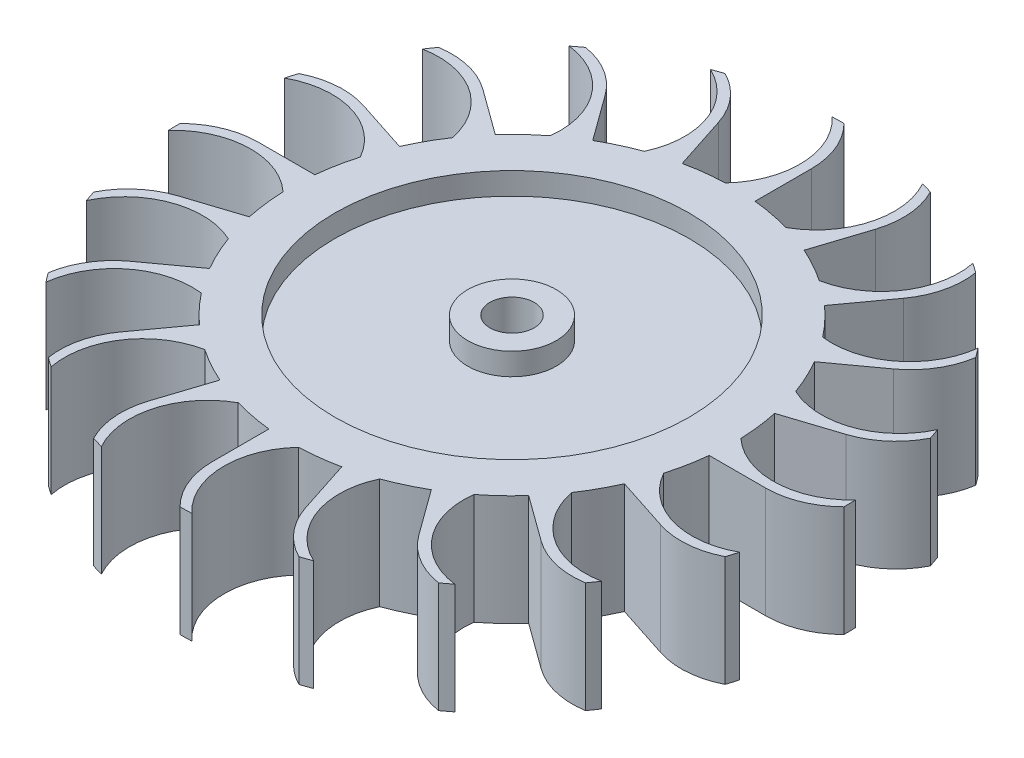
ISO-10303-21;
HEADER;
FILE_DESCRIPTION(('STEP AP214'),'2;1');
FILE_NAME('part.step','',(''),(''),'','','');
FILE_SCHEMA(('AUTOMOTIVE_DESIGN { 1 0 10303 214 1 1 1 1 }'));
ENDSEC;
DATA;
#1=APPLICATION_CONTEXT('core data for automotive mechanical design processes');
#2=APPLICATION_PROTOCOL_DEFINITION('international standard','automotive_design',2000,#1);
#3=PRODUCT_CONTEXT('',#1,'mechanical');
#4=PRODUCT('Part','Part','',(#3));
#5=PRODUCT_RELATED_PRODUCT_CATEGORY('part','',(#4));
#6=PRODUCT_DEFINITION_FORMATION('','',#4);
#7=PRODUCT_DEFINITION_CONTEXT('part definition',#1,'design');
#8=PRODUCT_DEFINITION('design','',#6,#7);
#9=PRODUCT_DEFINITION_SHAPE('','',#8);
#10=(LENGTH_UNIT() NAMED_UNIT(*) SI_UNIT(.MILLI.,.METRE.));
#11=(NAMED_UNIT(*) PLANE_ANGLE_UNIT() SI_UNIT($,.RADIAN.));
#12=(NAMED_UNIT(*) SI_UNIT($,.STERADIAN.) SOLID_ANGLE_UNIT());
#13=UNCERTAINTY_MEASURE_WITH_UNIT(LENGTH_MEASURE(1.E-05),#10,'distance_accuracy_value','');
#14=(GEOMETRIC_REPRESENTATION_CONTEXT(3) GLOBAL_UNCERTAINTY_ASSIGNED_CONTEXT((#13)) GLOBAL_UNIT_ASSIGNED_CONTEXT((#10,
#11,#12)) REPRESENTATION_CONTEXT('',''));
#15=CARTESIAN_POINT('',(0.,0.,0.));
#16=DIRECTION('',(0.,0.,1.));
#17=DIRECTION('',(1.,0.,0.));
#18=AXIS2_PLACEMENT_3D('',#15,#16,#17);
#19=CARTESIAN_POINT('',(0.,0.,0.));
#20=DIRECTION('',(0.,1.,0.));
#21=DIRECTION('',(0.,0.,1.));
#22=AXIS2_PLACEMENT_3D('',#19,#20,#21);
#23=PLANE('',#22);
#24=CARTESIAN_POINT('',(0.,0.,0.));
#25=DIRECTION('',(0.,1.,0.));
#26=DIRECTION('',(0.,0.,1.));
#27=AXIS2_PLACEMENT_3D('',#24,#25,#26);
#28=CIRCLE('',#27,5.08);
#29=CARTESIAN_POINT('',(0.,0.,5.08));
#30=VERTEX_POINT('',#29);
#31=EDGE_CURVE('E1364',#30,#30,#28,.T.);
#32=ORIENTED_EDGE('',*,*,#31,.T.);
#33=EDGE_LOOP('',(#32));
#34=FACE_BOUND('',#33,.T.);
#35=CARTESIAN_POINT('',(0.,0.,0.));
#36=DIRECTION('',(0.,-1.,0.));
#37=DIRECTION('',(0.,0.,-1.));
#38=AXIS2_PLACEMENT_3D('',#35,#36,#37);
#39=CIRCLE('',#38,10.16);
#40=CARTESIAN_POINT('',(0.,0.,-10.16));
#41=VERTEX_POINT('',#40);
#42=EDGE_CURVE('E2567',#41,#41,#39,.T.);
#43=ORIENTED_EDGE('',*,*,#42,.T.);
#44=EDGE_LOOP('',(#43));
#45=FACE_BOUND('',#44,.T.);
#46=ADVANCED_FACE('F35',(#34,#45),#23,.F.);
#47=CARTESIAN_POINT('',(0.,25.4,0.));
#48=DIRECTION('',(0.,1.,0.));
#49=DIRECTION('',(0.,0.,1.));
#50=AXIS2_PLACEMENT_3D('',#47,#48,#49);
#51=PLANE('',#50);
#52=CARTESIAN_POINT('',(0.,25.4,0.));
#53=DIRECTION('',(0.,1.,0.));
#54=DIRECTION('',(0.,0.,1.));
#55=AXIS2_PLACEMENT_3D('',#52,#53,#54);
#56=CIRCLE('',#55,5.08);
#57=CARTESIAN_POINT('',(0.,25.4,5.08));
#58=VERTEX_POINT('',#57);
#59=EDGE_CURVE('E1365',#58,#58,#56,.T.);
#60=ORIENTED_EDGE('',*,*,#59,.F.);
#61=EDGE_LOOP('',(#60));
#62=FACE_BOUND('',#61,.T.);
#63=CARTESIAN_POINT('',(0.,25.4,0.));
#64=DIRECTION('',(0.,1.,0.));
#65=DIRECTION('',(0.,0.,1.));
#66=AXIS2_PLACEMENT_3D('',#63,#64,#65);
#67=CIRCLE('',#66,10.16);
#68=CARTESIAN_POINT('',(0.,25.4,10.16));
#69=VERTEX_POINT('',#68);
#70=EDGE_CURVE('E2574',#69,#69,#67,.T.);
#71=ORIENTED_EDGE('',*,*,#70,.T.);
#72=EDGE_LOOP('',(#71));
#73=FACE_BOUND('',#72,.T.);
#74=ADVANCED_FACE('F1392',(#62,#73),#51,.T.);
#75=CARTESIAN_POINT('',(0.,25.4,0.));
#76=DIRECTION('',(0.,-1.,0.));
#77=DIRECTION('',(0.,0.,-1.));
#78=AXIS2_PLACEMENT_3D('',#75,#76,#77);
#79=CYLINDRICAL_SURFACE('',#78,50.8);
#80=CARTESIAN_POINT('',(0.,25.4,0.));
#81=DIRECTION('',(0.,1.,0.));
#82=DIRECTION('',(0.,0.,1.));
#83=AXIS2_PLACEMENT_3D('',#80,#81,#82);
#84=CIRCLE('',#83,50.8);
#85=CARTESIAN_POINT('',(14.0026501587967,25.4,-48.8320160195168));
#86=VERTEX_POINT('',#85);
#87=CARTESIAN_POINT('',(5.26051224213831,25.4,-50.5268939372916));
#88=VERTEX_POINT('',#87);
#89=EDGE_CURVE('E45',#86,#88,#84,.T.);
#90=ORIENTED_EDGE('',*,*,#89,.F.);
#91=DIRECTION('',(0.,-1.,0.));
#92=VECTOR('',#91,1.);
#93=CARTESIAN_POINT('',(14.0026501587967,25.4,-48.8320160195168));
#94=LINE('',#93,#92);
#95=CARTESIAN_POINT('',(14.0026501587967,0.,-48.8320160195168));
#96=VERTEX_POINT('',#95);
#97=EDGE_CURVE('E665',#86,#96,#94,.T.);
#98=ORIENTED_EDGE('',*,*,#97,.T.);
#99=CARTESIAN_POINT('',(0.,0.,0.));
#100=DIRECTION('',(0.,1.,0.));
#101=DIRECTION('',(0.,0.,1.));
#102=AXIS2_PLACEMENT_3D('',#99,#100,#101);
#103=CIRCLE('',#102,50.8);
#104=CARTESIAN_POINT('',(5.26051224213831,0.,-50.5268939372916));
#105=VERTEX_POINT('',#104);
#106=EDGE_CURVE('E1368',#96,#105,#103,.T.);
#107=ORIENTED_EDGE('',*,*,#106,.T.);
#108=DIRECTION('',(0.,-1.,0.));
#109=VECTOR('',#108,1.);
#110=CARTESIAN_POINT('',(5.26051224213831,25.4,-50.5268939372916));
#111=LINE('',#110,#109);
#112=EDGE_CURVE('E1356',#88,#105,#111,.T.);
#113=ORIENTED_EDGE('',*,*,#112,.F.);
#114=EDGE_LOOP('',(#90,#98,#107,#113));
#115=FACE_BOUND('',#114,.T.);
#116=ADVANCED_FACE('F1388',(#115),#79,.T.);
#117=CARTESIAN_POINT('',(28.4072344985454,0.,-42.1149501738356));
#118=VERTEX_POINT('',#117);
#119=CARTESIAN_POINT('',(20.6167133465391,0.,-46.4283440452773));
#120=VERTEX_POINT('',#119);
#121=EDGE_CURVE('E1424',#118,#120,#103,.T.);
#122=ORIENTED_EDGE('',*,*,#121,.T.);
#123=DIRECTION('',(0.,-1.,0.));
#124=VECTOR('',#123,1.);
#125=CARTESIAN_POINT('',(20.6167133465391,25.4,-46.4283440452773));
#126=LINE('',#125,#124);
#127=CARTESIAN_POINT('',(20.6167133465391,25.4,-46.4283440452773));
#128=VERTEX_POINT('',#127);
#129=EDGE_CURVE('E59',#128,#120,#126,.T.);
#130=ORIENTED_EDGE('',*,*,#129,.F.);
#131=CARTESIAN_POINT('',(28.4072344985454,25.4,-42.1149501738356));
#132=VERTEX_POINT('',#131);
#133=EDGE_CURVE('E1536',#132,#128,#84,.T.);
#134=ORIENTED_EDGE('',*,*,#133,.F.);
#135=DIRECTION('',(0.,-1.,0.));
#136=VECTOR('',#135,1.);
#137=CARTESIAN_POINT('',(28.4072344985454,25.4,-42.1149501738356));
#138=LINE('',#137,#136);
#139=EDGE_CURVE('E729',#132,#118,#138,.T.);
#140=ORIENTED_EDGE('',*,*,#139,.T.);
#141=EDGE_LOOP('',(#122,#130,#134,#140));
#142=FACE_BOUND('',#141,.T.);
#143=ADVANCED_FACE('F1577',(#142),#79,.T.);
#144=CARTESIAN_POINT('',(40.0311208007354,0.,-31.2753795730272));
#145=VERTEX_POINT('',#144);
#146=CARTESIAN_POINT('',(33.9548069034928,0.,-37.7850643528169));
#147=VERTEX_POINT('',#146);
#148=EDGE_CURVE('E1425',#145,#147,#103,.T.);
#149=ORIENTED_EDGE('',*,*,#148,.T.);
#150=DIRECTION('',(0.,-1.,0.));
#151=VECTOR('',#150,1.);
#152=CARTESIAN_POINT('',(33.9548069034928,25.4,-37.7850643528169));
#153=LINE('',#152,#151);
#154=CARTESIAN_POINT('',(33.9548069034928,25.4,-37.7850643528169));
#155=VERTEX_POINT('',#154);
#156=EDGE_CURVE('E726',#155,#147,#153,.T.);
#157=ORIENTED_EDGE('',*,*,#156,.F.);
#158=CARTESIAN_POINT('',(40.0311208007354,25.4,-31.2753795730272));
#159=VERTEX_POINT('',#158);
#160=EDGE_CURVE('E1532',#159,#155,#84,.T.);
#161=ORIENTED_EDGE('',*,*,#160,.F.);
#162=DIRECTION('',(0.,-1.,0.));
#163=VECTOR('',#162,1.);
#164=CARTESIAN_POINT('',(40.0311208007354,25.4,-31.2753795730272));
#165=LINE('',#164,#163);
#166=EDGE_CURVE('E764',#159,#145,#165,.T.);
#167=ORIENTED_EDGE('',*,*,#166,.T.);
#168=EDGE_LOOP('',(#149,#157,#161,#167));
#169=FACE_BOUND('',#168,.T.);
#170=ADVANCED_FACE('F1586',(#169),#79,.T.);
#171=CARTESIAN_POINT('',(47.7364820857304,0.,-17.3743569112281));
#172=VERTEX_POINT('',#171);
#173=CARTESIAN_POINT('',(43.969167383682,0.,-25.4431192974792));
#174=VERTEX_POINT('',#173);
#175=EDGE_CURVE('E1426',#172,#174,#103,.T.);
#176=ORIENTED_EDGE('',*,*,#175,.T.);
#177=DIRECTION('',(0.,-1.,0.));
#178=VECTOR('',#177,1.);
#179=CARTESIAN_POINT('',(43.969167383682,25.4,-25.4431192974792));
#180=LINE('',#179,#178);
#181=CARTESIAN_POINT('',(43.969167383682,25.4,-25.4431192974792));
#182=VERTEX_POINT('',#181);
#183=EDGE_CURVE('E761',#182,#174,#180,.T.);
#184=ORIENTED_EDGE('',*,*,#183,.F.);
#185=CARTESIAN_POINT('',(47.7364820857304,25.4,-17.3743569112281));
#186=VERTEX_POINT('',#185);
#187=EDGE_CURVE('E1528',#186,#182,#84,.T.);
#188=ORIENTED_EDGE('',*,*,#187,.F.);
#189=DIRECTION('',(0.,-1.,0.));
#190=VECTOR('',#189,1.);
#191=CARTESIAN_POINT('',(47.7364820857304,25.4,-17.3743569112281));
#192=LINE('',#191,#190);
#193=EDGE_CURVE('E799',#186,#172,#192,.T.);
#194=ORIENTED_EDGE('',*,*,#193,.T.);
#195=EDGE_LOOP('',(#176,#184,#188,#194));
#196=FACE_BOUND('',#195,.T.);
#197=ADVANCED_FACE('F1594',(#196),#79,.T.);
#198=CARTESIAN_POINT('',(50.7690639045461,0.,-1.77261114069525));
#199=VERTEX_POINT('',#198);
#200=CARTESIAN_POINT('',(49.6795194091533,0.,-10.6106244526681));
#201=VERTEX_POINT('',#200);
#202=EDGE_CURVE('E1428',#199,#201,#103,.T.);
#203=ORIENTED_EDGE('',*,*,#202,.T.);
#204=DIRECTION('',(0.,-1.,0.));
#205=VECTOR('',#204,1.);
#206=CARTESIAN_POINT('',(49.6795194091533,25.4,-10.6106244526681));
#207=LINE('',#206,#205);
#208=CARTESIAN_POINT('',(49.6795194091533,25.4,-10.6106244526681));
#209=VERTEX_POINT('',#208);
#210=EDGE_CURVE('E796',#209,#201,#207,.T.);
#211=ORIENTED_EDGE('',*,*,#210,.F.);
#212=CARTESIAN_POINT('',(50.7690639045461,25.4,-1.77261114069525));
#213=VERTEX_POINT('',#212);
#214=EDGE_CURVE('E1524',#213,#209,#84,.T.);
#215=ORIENTED_EDGE('',*,*,#214,.F.);
#216=DIRECTION('',(0.,-1.,0.));
#217=VECTOR('',#216,1.);
#218=CARTESIAN_POINT('',(50.7690639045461,25.4,-1.77261114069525));
#219=LINE('',#218,#217);
#220=EDGE_CURVE('E834',#213,#199,#219,.T.);
#221=ORIENTED_EDGE('',*,*,#220,.T.);
#222=EDGE_LOOP('',(#203,#211,#215,#221));
#223=FACE_BOUND('',#222,.T.);
#224=ADVANCED_FACE('F1602',(#223),#79,.T.);
#225=CARTESIAN_POINT('',(48.8320160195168,0.,14.0026501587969));
#226=VERTEX_POINT('',#225);
#227=CARTESIAN_POINT('',(50.5268939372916,0.,5.26051224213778));
#228=VERTEX_POINT('',#227);
#229=EDGE_CURVE('E1430',#226,#228,#103,.T.);
#230=ORIENTED_EDGE('',*,*,#229,.T.);
#231=DIRECTION('',(0.,-1.,0.));
#232=VECTOR('',#231,1.);
#233=CARTESIAN_POINT('',(50.5268939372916,25.4,5.26051224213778));
#234=LINE('',#233,#232);
#235=CARTESIAN_POINT('',(50.5268939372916,25.4,5.26051224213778));
#236=VERTEX_POINT('',#235);
#237=EDGE_CURVE('E831',#236,#228,#234,.T.);
#238=ORIENTED_EDGE('',*,*,#237,.F.);
#239=CARTESIAN_POINT('',(48.8320160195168,25.4,14.0026501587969));
#240=VERTEX_POINT('',#239);
#241=EDGE_CURVE('E1520',#240,#236,#84,.T.);
#242=ORIENTED_EDGE('',*,*,#241,.F.);
#243=DIRECTION('',(0.,-1.,0.));
#244=VECTOR('',#243,1.);
#245=CARTESIAN_POINT('',(48.8320160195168,25.4,14.0026501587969));
#246=LINE('',#245,#244);
#247=EDGE_CURVE('E869',#240,#226,#246,.T.);
#248=ORIENTED_EDGE('',*,*,#247,.T.);
#249=EDGE_LOOP('',(#230,#238,#242,#248));
#250=FACE_BOUND('',#249,.T.);
#251=ADVANCED_FACE('F1610',(#250),#79,.T.);
#252=CARTESIAN_POINT('',(42.1149501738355,0.,28.4072344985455));
#253=VERTEX_POINT('',#252);
#254=CARTESIAN_POINT('',(46.4283440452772,0.,20.6167133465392));
#255=VERTEX_POINT('',#254);
#256=EDGE_CURVE('E1432',#253,#255,#103,.T.);
#257=ORIENTED_EDGE('',*,*,#256,.T.);
#258=DIRECTION('',(0.,-1.,0.));
#259=VECTOR('',#258,1.);
#260=CARTESIAN_POINT('',(46.4283440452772,25.4,20.6167133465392));
#261=LINE('',#260,#259);
#262=CARTESIAN_POINT('',(46.4283440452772,25.4,20.6167133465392));
#263=VERTEX_POINT('',#262);
#264=EDGE_CURVE('E866',#263,#255,#261,.T.);
#265=ORIENTED_EDGE('',*,*,#264,.F.);
#266=CARTESIAN_POINT('',(42.1149501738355,25.4,28.4072344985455));
#267=VERTEX_POINT('',#266);
#268=EDGE_CURVE('E1516',#267,#263,#84,.T.);
#269=ORIENTED_EDGE('',*,*,#268,.F.);
#270=DIRECTION('',(0.,-1.,0.));
#271=VECTOR('',#270,1.);
#272=CARTESIAN_POINT('',(42.1149501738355,25.4,28.4072344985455));
#273=LINE('',#272,#271);
#274=EDGE_CURVE('E904',#267,#253,#273,.T.);
#275=ORIENTED_EDGE('',*,*,#274,.T.);
#276=EDGE_LOOP('',(#257,#265,#269,#275));
#277=FACE_BOUND('',#276,.T.);
#278=ADVANCED_FACE('F1618',(#277),#79,.T.);
#279=CARTESIAN_POINT('',(31.275379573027,0.,40.0311208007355));
#280=VERTEX_POINT('',#279);
#281=CARTESIAN_POINT('',(37.7850643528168,0.,33.954806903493));
#282=VERTEX_POINT('',#281);
#283=EDGE_CURVE('E1434',#280,#282,#103,.T.);
#284=ORIENTED_EDGE('',*,*,#283,.T.);
#285=DIRECTION('',(0.,-1.,0.));
#286=VECTOR('',#285,1.);
#287=CARTESIAN_POINT('',(37.7850643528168,25.4,33.954806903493));
#288=LINE('',#287,#286);
#289=CARTESIAN_POINT('',(37.7850643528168,25.4,33.954806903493));
#290=VERTEX_POINT('',#289);
#291=EDGE_CURVE('E901',#290,#282,#288,.T.);
#292=ORIENTED_EDGE('',*,*,#291,.F.);
#293=CARTESIAN_POINT('',(31.2753795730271,25.4,40.0311208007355));
#294=VERTEX_POINT('',#293);
#295=EDGE_CURVE('E1512',#294,#290,#84,.T.);
#296=ORIENTED_EDGE('',*,*,#295,.F.);
#297=DIRECTION('',(0.,-1.,0.));
#298=VECTOR('',#297,1.);
#299=CARTESIAN_POINT('',(31.275379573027,25.4,40.0311208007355));
#300=LINE('',#299,#298);
#301=EDGE_CURVE('E939',#294,#280,#300,.T.);
#302=ORIENTED_EDGE('',*,*,#301,.T.);
#303=EDGE_LOOP('',(#284,#292,#296,#302));
#304=FACE_BOUND('',#303,.T.);
#305=ADVANCED_FACE('F1626',(#304),#79,.T.);
#306=CARTESIAN_POINT('',(17.3743569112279,0.,47.7364820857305));
#307=VERTEX_POINT('',#306);
#308=CARTESIAN_POINT('',(25.443119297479,0.,43.9691673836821));
#309=VERTEX_POINT('',#308);
#310=EDGE_CURVE('E1436',#307,#309,#103,.T.);
#311=ORIENTED_EDGE('',*,*,#310,.T.);
#312=DIRECTION('',(0.,-1.,0.));
#313=VECTOR('',#312,1.);
#314=CARTESIAN_POINT('',(25.443119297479,25.4,43.9691673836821));
#315=LINE('',#314,#313);
#316=CARTESIAN_POINT('',(25.443119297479,25.4,43.9691673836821));
#317=VERTEX_POINT('',#316);
#318=EDGE_CURVE('E936',#317,#309,#315,.T.);
#319=ORIENTED_EDGE('',*,*,#318,.F.);
#320=CARTESIAN_POINT('',(17.3743569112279,25.4,47.7364820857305));
#321=VERTEX_POINT('',#320);
#322=EDGE_CURVE('E1508',#321,#317,#84,.T.);
#323=ORIENTED_EDGE('',*,*,#322,.F.);
#324=DIRECTION('',(0.,-1.,0.));
#325=VECTOR('',#324,1.);
#326=CARTESIAN_POINT('',(17.3743569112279,25.4,47.7364820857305));
#327=LINE('',#326,#325);
#328=EDGE_CURVE('E974',#321,#307,#327,.T.);
#329=ORIENTED_EDGE('',*,*,#328,.T.);
#330=EDGE_LOOP('',(#311,#319,#323,#329));
#331=FACE_BOUND('',#330,.T.);
#332=ADVANCED_FACE('F1634',(#331),#79,.T.);
#333=CARTESIAN_POINT('',(1.77261114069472,0.,50.7690639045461));
#334=VERTEX_POINT('',#333);
#335=CARTESIAN_POINT('',(10.6106244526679,0.,49.6795194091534));
#336=VERTEX_POINT('',#335);
#337=EDGE_CURVE('E1438',#334,#336,#103,.T.);
#338=ORIENTED_EDGE('',*,*,#337,.T.);
#339=DIRECTION('',(0.,-1.,0.));
#340=VECTOR('',#339,1.);
#341=CARTESIAN_POINT('',(10.6106244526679,25.4,49.6795194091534));
#342=LINE('',#341,#340);
#343=CARTESIAN_POINT('',(10.6106244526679,25.4,49.6795194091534));
#344=VERTEX_POINT('',#343);
#345=EDGE_CURVE('E971',#344,#336,#342,.T.);
#346=ORIENTED_EDGE('',*,*,#345,.F.);
#347=CARTESIAN_POINT('',(1.77261114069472,25.4,50.7690639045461));
#348=VERTEX_POINT('',#347);
#349=EDGE_CURVE('E1504',#348,#344,#84,.T.);
#350=ORIENTED_EDGE('',*,*,#349,.F.);
#351=DIRECTION('',(0.,-1.,0.));
#352=VECTOR('',#351,1.);
#353=CARTESIAN_POINT('',(1.77261114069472,25.4,50.7690639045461));
#354=LINE('',#353,#352);
#355=EDGE_CURVE('E1009',#348,#334,#354,.T.);
#356=ORIENTED_EDGE('',*,*,#355,.T.);
#357=EDGE_LOOP('',(#338,#346,#350,#356));
#358=FACE_BOUND('',#357,.T.);
#359=ADVANCED_FACE('F1642',(#358),#79,.T.);
#360=CARTESIAN_POINT('',(-14.002650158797,0.,48.8320160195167));
#361=VERTEX_POINT('',#360);
#362=CARTESIAN_POINT('',(-5.26051224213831,0.,50.5268939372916));
#363=VERTEX_POINT('',#362);
#364=EDGE_CURVE('E1440',#361,#363,#103,.T.);
#365=ORIENTED_EDGE('',*,*,#364,.T.);
#366=DIRECTION('',(0.,-1.,0.));
#367=VECTOR('',#366,1.);
#368=CARTESIAN_POINT('',(-5.26051224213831,25.4,50.5268939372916));
#369=LINE('',#368,#367);
#370=CARTESIAN_POINT('',(-5.26051224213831,25.4,50.5268939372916));
#371=VERTEX_POINT('',#370);
#372=EDGE_CURVE('E1006',#371,#363,#369,.T.);
#373=ORIENTED_EDGE('',*,*,#372,.F.);
#374=CARTESIAN_POINT('',(-14.002650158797,25.4,48.8320160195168));
#375=VERTEX_POINT('',#374);
#376=EDGE_CURVE('E1500',#375,#371,#84,.T.);
#377=ORIENTED_EDGE('',*,*,#376,.F.);
#378=DIRECTION('',(0.,-1.,0.));
#379=VECTOR('',#378,1.);
#380=CARTESIAN_POINT('',(-14.002650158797,25.4,48.8320160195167));
#381=LINE('',#380,#379);
#382=EDGE_CURVE('E1044',#375,#361,#381,.T.);
#383=ORIENTED_EDGE('',*,*,#382,.T.);
#384=EDGE_LOOP('',(#365,#373,#377,#383));
#385=FACE_BOUND('',#384,.T.);
#386=ADVANCED_FACE('F1650',(#385),#79,.T.);
#387=CARTESIAN_POINT('',(-28.4072344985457,0.,42.1149501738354));
#388=VERTEX_POINT('',#387);
#389=CARTESIAN_POINT('',(-20.6167133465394,0.,46.4283440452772));
#390=VERTEX_POINT('',#389);
#391=EDGE_CURVE('E1442',#388,#390,#103,.T.);
#392=ORIENTED_EDGE('',*,*,#391,.T.);
#393=DIRECTION('',(0.,-1.,0.));
#394=VECTOR('',#393,1.);
#395=CARTESIAN_POINT('',(-20.6167133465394,25.4,46.4283440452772));
#396=LINE('',#395,#394);
#397=CARTESIAN_POINT('',(-20.6167133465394,25.4,46.4283440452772));
#398=VERTEX_POINT('',#397);
#399=EDGE_CURVE('E1041',#398,#390,#396,.T.);
#400=ORIENTED_EDGE('',*,*,#399,.F.);
#401=CARTESIAN_POINT('',(-28.4072344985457,25.4,42.1149501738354));
#402=VERTEX_POINT('',#401);
#403=EDGE_CURVE('E1496',#402,#398,#84,.T.);
#404=ORIENTED_EDGE('',*,*,#403,.F.);
#405=DIRECTION('',(0.,-1.,0.));
#406=VECTOR('',#405,1.);
#407=CARTESIAN_POINT('',(-28.4072344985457,25.4,42.1149501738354));
#408=LINE('',#407,#406);
#409=EDGE_CURVE('E1079',#402,#388,#408,.T.);
#410=ORIENTED_EDGE('',*,*,#409,.T.);
#411=EDGE_LOOP('',(#392,#400,#404,#410));
#412=FACE_BOUND('',#411,.T.);
#413=ADVANCED_FACE('F1658',(#412),#79,.T.);
#414=CARTESIAN_POINT('',(-40.0311208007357,0.,31.2753795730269));
#415=VERTEX_POINT('',#414);
#416=CARTESIAN_POINT('',(-33.9548069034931,0.,37.7850643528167));
#417=VERTEX_POINT('',#416);
#418=EDGE_CURVE('E1444',#415,#417,#103,.T.);
#419=ORIENTED_EDGE('',*,*,#418,.T.);
#420=DIRECTION('',(0.,-1.,0.));
#421=VECTOR('',#420,1.);
#422=CARTESIAN_POINT('',(-33.9548069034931,25.4,37.7850643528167));
#423=LINE('',#422,#421);
#424=CARTESIAN_POINT('',(-33.9548069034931,25.4,37.7850643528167));
#425=VERTEX_POINT('',#424);
#426=EDGE_CURVE('E1076',#425,#417,#423,.T.);
#427=ORIENTED_EDGE('',*,*,#426,.F.);
#428=CARTESIAN_POINT('',(-40.0311208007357,25.4,31.2753795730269));
#429=VERTEX_POINT('',#428);
#430=EDGE_CURVE('E1492',#429,#425,#84,.T.);
#431=ORIENTED_EDGE('',*,*,#430,.F.);
#432=DIRECTION('',(0.,-1.,0.));
#433=VECTOR('',#432,1.);
#434=CARTESIAN_POINT('',(-40.0311208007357,25.4,31.2753795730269));
#435=LINE('',#434,#433);
#436=EDGE_CURVE('E1114',#429,#415,#435,.T.);
#437=ORIENTED_EDGE('',*,*,#436,.T.);
#438=EDGE_LOOP('',(#419,#427,#431,#437));
#439=FACE_BOUND('',#438,.T.);
#440=ADVANCED_FACE('F1666',(#439),#79,.T.);
#441=CARTESIAN_POINT('',(-47.7364820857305,0.,17.3743569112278));
#442=VERTEX_POINT('',#441);
#443=CARTESIAN_POINT('',(-43.9691673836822,0.,25.4431192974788));
#444=VERTEX_POINT('',#443);
#445=EDGE_CURVE('E1446',#442,#444,#103,.T.);
#446=ORIENTED_EDGE('',*,*,#445,.T.);
#447=DIRECTION('',(0.,-1.,0.));
#448=VECTOR('',#447,1.);
#449=CARTESIAN_POINT('',(-43.9691673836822,25.4,25.4431192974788));
#450=LINE('',#449,#448);
#451=CARTESIAN_POINT('',(-43.9691673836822,25.4,25.4431192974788));
#452=VERTEX_POINT('',#451);
#453=EDGE_CURVE('E1111',#452,#444,#450,.T.);
#454=ORIENTED_EDGE('',*,*,#453,.F.);
#455=CARTESIAN_POINT('',(-47.7364820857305,25.4,17.3743569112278));
#456=VERTEX_POINT('',#455);
#457=EDGE_CURVE('E1488',#456,#452,#84,.T.);
#458=ORIENTED_EDGE('',*,*,#457,.F.);
#459=DIRECTION('',(0.,-1.,0.));
#460=VECTOR('',#459,1.);
#461=CARTESIAN_POINT('',(-47.7364820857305,25.4,17.3743569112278));
#462=LINE('',#461,#460);
#463=EDGE_CURVE('E1149',#456,#442,#462,.T.);
#464=ORIENTED_EDGE('',*,*,#463,.T.);
#465=EDGE_LOOP('',(#446,#454,#458,#464));
#466=FACE_BOUND('',#465,.T.);
#467=ADVANCED_FACE('F1674',(#466),#79,.T.);
#468=CARTESIAN_POINT('',(-50.7690639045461,0.,1.7726111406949));
#469=VERTEX_POINT('',#468);
#470=CARTESIAN_POINT('',(-49.6795194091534,0.,10.6106244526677));
#471=VERTEX_POINT('',#470);
#472=EDGE_CURVE('E1448',#469,#471,#103,.T.);
#473=ORIENTED_EDGE('',*,*,#472,.T.);
#474=DIRECTION('',(0.,-1.,0.));
#475=VECTOR('',#474,1.);
#476=CARTESIAN_POINT('',(-49.6795194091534,25.4,10.6106244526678));
#477=LINE('',#476,#475);
#478=CARTESIAN_POINT('',(-49.6795194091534,25.4,10.6106244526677));
#479=VERTEX_POINT('',#478);
#480=EDGE_CURVE('E1146',#479,#471,#477,.T.);
#481=ORIENTED_EDGE('',*,*,#480,.F.);
#482=CARTESIAN_POINT('',(-50.7690639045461,25.4,1.7726111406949));
#483=VERTEX_POINT('',#482);
#484=EDGE_CURVE('E1484',#483,#479,#84,.T.);
#485=ORIENTED_EDGE('',*,*,#484,.F.);
#486=DIRECTION('',(0.,-1.,0.));
#487=VECTOR('',#486,1.);
#488=CARTESIAN_POINT('',(-50.7690639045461,25.4,1.7726111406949));
#489=LINE('',#488,#487);
#490=EDGE_CURVE('E1184',#483,#469,#489,.T.);
#491=ORIENTED_EDGE('',*,*,#490,.T.);
#492=EDGE_LOOP('',(#473,#481,#485,#491));
#493=FACE_BOUND('',#492,.T.);
#494=ADVANCED_FACE('F1682',(#493),#79,.T.);
#495=CARTESIAN_POINT('',(-48.8320160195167,0.,-14.0026501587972));
#496=VERTEX_POINT('',#495);
#497=CARTESIAN_POINT('',(-50.5268939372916,0.,-5.26051224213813));
#498=VERTEX_POINT('',#497);
#499=EDGE_CURVE('E1450',#496,#498,#103,.T.);
#500=ORIENTED_EDGE('',*,*,#499,.T.);
#501=DIRECTION('',(0.,-1.,0.));
#502=VECTOR('',#501,1.);
#503=CARTESIAN_POINT('',(-50.5268939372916,25.4,-5.26051224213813));
#504=LINE('',#503,#502);
#505=CARTESIAN_POINT('',(-50.5268939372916,25.4,-5.26051224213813));
#506=VERTEX_POINT('',#505);
#507=EDGE_CURVE('E1181',#506,#498,#504,.T.);
#508=ORIENTED_EDGE('',*,*,#507,.F.);
#509=CARTESIAN_POINT('',(-48.8320160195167,25.4,-14.0026501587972));
#510=VERTEX_POINT('',#509);
#511=EDGE_CURVE('E1480',#510,#506,#84,.T.);
#512=ORIENTED_EDGE('',*,*,#511,.F.);
#513=DIRECTION('',(0.,-1.,0.));
#514=VECTOR('',#513,1.);
#515=CARTESIAN_POINT('',(-48.8320160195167,25.4,-14.0026501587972));
#516=LINE('',#515,#514);
#517=EDGE_CURVE('E1219',#510,#496,#516,.T.);
#518=ORIENTED_EDGE('',*,*,#517,.T.);
#519=EDGE_LOOP('',(#500,#508,#512,#518));
#520=FACE_BOUND('',#519,.T.);
#521=ADVANCED_FACE('F1690',(#520),#79,.T.);
#522=CARTESIAN_POINT('',(-42.1149501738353,0.,-28.4072344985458));
#523=VERTEX_POINT('',#522);
#524=CARTESIAN_POINT('',(-46.4283440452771,0.,-20.6167133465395));
#525=VERTEX_POINT('',#524);
#526=EDGE_CURVE('E1452',#523,#525,#103,.T.);
#527=ORIENTED_EDGE('',*,*,#526,.T.);
#528=DIRECTION('',(0.,-1.,0.));
#529=VECTOR('',#528,1.);
#530=CARTESIAN_POINT('',(-46.4283440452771,25.4,-20.6167133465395));
#531=LINE('',#530,#529);
#532=CARTESIAN_POINT('',(-46.4283440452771,25.4,-20.6167133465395));
#533=VERTEX_POINT('',#532);
#534=EDGE_CURVE('E1216',#533,#525,#531,.T.);
#535=ORIENTED_EDGE('',*,*,#534,.F.);
#536=CARTESIAN_POINT('',(-42.1149501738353,25.4,-28.4072344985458));
#537=VERTEX_POINT('',#536);
#538=EDGE_CURVE('E1476',#537,#533,#84,.T.);
#539=ORIENTED_EDGE('',*,*,#538,.F.);
#540=DIRECTION('',(0.,-1.,0.));
#541=VECTOR('',#540,1.);
#542=CARTESIAN_POINT('',(-42.1149501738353,25.4,-28.4072344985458));
#543=LINE('',#542,#541);
#544=EDGE_CURVE('E1254',#537,#523,#543,.T.);
#545=ORIENTED_EDGE('',*,*,#544,.T.);
#546=EDGE_LOOP('',(#527,#535,#539,#545));
#547=FACE_BOUND('',#546,.T.);
#548=ADVANCED_FACE('F1698',(#547),#79,.T.);
#549=CARTESIAN_POINT('',(-31.2753795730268,0.,-40.0311208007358));
#550=VERTEX_POINT('',#549);
#551=CARTESIAN_POINT('',(-37.7850643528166,0.,-33.9548069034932));
#552=VERTEX_POINT('',#551);
#553=EDGE_CURVE('E1454',#550,#552,#103,.T.);
#554=ORIENTED_EDGE('',*,*,#553,.T.);
#555=DIRECTION('',(0.,-1.,0.));
#556=VECTOR('',#555,1.);
#557=CARTESIAN_POINT('',(-37.7850643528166,25.4,-33.9548069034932));
#558=LINE('',#557,#556);
#559=CARTESIAN_POINT('',(-37.7850643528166,25.4,-33.9548069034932));
#560=VERTEX_POINT('',#559);
#561=EDGE_CURVE('E1251',#560,#552,#558,.T.);
#562=ORIENTED_EDGE('',*,*,#561,.F.);
#563=CARTESIAN_POINT('',(-31.2753795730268,25.4,-40.0311208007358));
#564=VERTEX_POINT('',#563);
#565=EDGE_CURVE('E1474',#564,#560,#84,.T.);
#566=ORIENTED_EDGE('',*,*,#565,.F.);
#567=DIRECTION('',(0.,-1.,0.));
#568=VECTOR('',#567,1.);
#569=CARTESIAN_POINT('',(-31.2753795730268,25.4,-40.0311208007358));
#570=LINE('',#569,#568);
#571=EDGE_CURVE('E1289',#564,#550,#570,.T.);
#572=ORIENTED_EDGE('',*,*,#571,.T.);
#573=EDGE_LOOP('',(#554,#562,#566,#572));
#574=FACE_BOUND('',#573,.T.);
#575=ADVANCED_FACE('F1706',(#574),#79,.T.);
#576=CARTESIAN_POINT('',(-17.3743569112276,0.,-47.7364820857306));
#577=VERTEX_POINT('',#576);
#578=CARTESIAN_POINT('',(-25.4431192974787,0.,-43.9691673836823));
#579=VERTEX_POINT('',#578);
#580=EDGE_CURVE('E1410',#577,#579,#103,.T.);
#581=ORIENTED_EDGE('',*,*,#580,.T.);
#582=DIRECTION('',(0.,-1.,0.));
#583=VECTOR('',#582,1.);
#584=CARTESIAN_POINT('',(-25.4431192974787,25.4,-43.9691673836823));
#585=LINE('',#584,#583);
#586=CARTESIAN_POINT('',(-25.4431192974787,25.4,-43.9691673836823));
#587=VERTEX_POINT('',#586);
#588=EDGE_CURVE('E1286',#587,#579,#585,.T.);
#589=ORIENTED_EDGE('',*,*,#588,.F.);
#590=CARTESIAN_POINT('',(-17.3743569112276,25.4,-47.7364820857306));
#591=VERTEX_POINT('',#590);
#592=EDGE_CURVE('E44',#591,#587,#84,.T.);
#593=ORIENTED_EDGE('',*,*,#592,.F.);
#594=DIRECTION('',(0.,-1.,0.));
#595=VECTOR('',#594,1.);
#596=CARTESIAN_POINT('',(-17.3743569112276,25.4,-47.7364820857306));
#597=LINE('',#596,#595);
#598=EDGE_CURVE('E1324',#591,#577,#597,.T.);
#599=ORIENTED_EDGE('',*,*,#598,.T.);
#600=EDGE_LOOP('',(#581,#589,#593,#599));
#601=FACE_BOUND('',#600,.T.);
#602=ADVANCED_FACE('F1389',(#601),#79,.T.);
#603=CARTESIAN_POINT('',(0.,25.4,0.));
#604=DIRECTION('',(0.,1.,0.));
#605=DIRECTION('',(0.,0.,1.));
#606=AXIS2_PLACEMENT_3D('',#603,#604,#605);
#607=CIRCLE('',#606,40.64);
#608=CARTESIAN_POINT('',(0.,25.4,40.64));
#609=VERTEX_POINT('',#608);
#610=EDGE_CURVE('E2579',#609,#609,#607,.T.);
#611=ORIENTED_EDGE('',*,*,#610,.F.);
#612=EDGE_LOOP('',(#611));
#613=FACE_BOUND('',#612,.T.);
#614=CARTESIAN_POINT('',(-1.77261114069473,25.4,-50.7690639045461));
#615=VERTEX_POINT('',#614);
#616=CARTESIAN_POINT('',(-10.6106244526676,25.4,-49.6795194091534));
#617=VERTEX_POINT('',#616);
#618=EDGE_CURVE('E11',#615,#617,#84,.T.);
#619=ORIENTED_EDGE('',*,*,#618,.T.);
#620=DIRECTION('',(0.309016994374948,0.,0.951056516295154));
#621=VECTOR('',#620,1.);
#622=CARTESIAN_POINT('',(5.00304444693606,25.4,-1.6255876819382));
#623=LINE('',#622,#621);
#624=CARTESIAN_POINT('',(-14.6195346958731,25.4,-62.0176764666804));
#625=VERTEX_POINT('',#624);
#626=EDGE_CURVE('E1302',#625,#617,#623,.T.);
#627=ORIENTED_EDGE('',*,*,#626,.F.);
#628=CARTESIAN_POINT('',(-31.7009968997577,25.4,-56.4675729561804));
#629=DIRECTION('',(0.,1.,0.));
#630=DIRECTION('',(0.309016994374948,0.,0.951056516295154));
#631=AXIS2_PLACEMENT_3D('',#628,#629,#630);
#632=CIRCLE('',#631,17.9605122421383);
#633=CARTESIAN_POINT('',(-23.547094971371,25.4,-72.4705065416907));
#634=VERTEX_POINT('',#633);
#635=EDGE_CURVE('E1305',#625,#634,#632,.T.);
#636=ORIENTED_EDGE('',*,*,#635,.T.);
#637=CARTESIAN_POINT('',(-0.0239462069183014,25.4,-0.0736988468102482));
#638=DIRECTION('',(0.,1.,0.));
#639=DIRECTION('',(0.309016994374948,0.,0.951056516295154));
#640=AXIS2_PLACEMENT_3D('',#637,#638,#639);
#641=CIRCLE('',#640,76.1225084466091);
#642=CARTESIAN_POINT('',(-26.0615855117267,25.4,-71.6046546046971));
#643=VERTEX_POINT('',#642);
#644=EDGE_CURVE('E1295',#643,#634,#641,.F.);
#645=ORIENTED_EDGE('',*,*,#644,.F.);
#646=CARTESIAN_POINT('',(-33.6521018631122,25.4,-55.3269378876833));
#647=DIRECTION('',(0.,1.,0.));
#648=DIRECTION('',(0.309016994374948,0.,0.951056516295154));
#649=AXIS2_PLACEMENT_3D('',#646,#647,#648);
#650=CIRCLE('',#649,17.9605122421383);
#651=EDGE_CURVE('E1298',#591,#643,#650,.T.);
#652=ORIENTED_EDGE('',*,*,#651,.F.);
#653=ORIENTED_EDGE('',*,*,#592,.T.);
#654=DIRECTION('',(0.587785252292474,0.,0.809016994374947));
#655=VECTOR('',#654,1.);
#656=CARTESIAN_POINT('',(4.25584380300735,25.4,-3.09205151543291));
#657=LINE('',#656,#655);
#658=CARTESIAN_POINT('',(-33.0685197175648,25.4,-54.464630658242));
#659=VERTEX_POINT('',#658);
#660=EDGE_CURVE('E1267',#659,#587,#657,.T.);
#661=ORIENTED_EDGE('',*,*,#660,.F.);
#662=CARTESIAN_POINT('',(-47.598879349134,25.4,-43.9077064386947));
#663=DIRECTION('',(0.,1.,0.));
#664=DIRECTION('',(0.587785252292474,0.,0.809016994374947));
#665=AXIS2_PLACEMENT_3D('',#662,#663,#664);
#666=CIRCLE('',#665,17.9605122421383);
#667=CARTESIAN_POINT('',(-44.7892362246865,25.4,-61.6470949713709));
#668=VERTEX_POINT('',#667);
#669=EDGE_CURVE('E1270',#659,#668,#666,.T.);
#670=ORIENTED_EDGE('',*,*,#669,.T.);
#671=CARTESIAN_POINT('',(-0.0455483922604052,25.4,-0.0626919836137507));
#672=DIRECTION('',(0.,1.,0.));
#673=DIRECTION('',(0.587785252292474,0.,0.809016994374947));
#674=AXIS2_PLACEMENT_3D('',#671,#672,#673);
#675=CIRCLE('',#674,76.1225084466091);
#676=CARTESIAN_POINT('',(-46.9130958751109,25.4,-60.0466005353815));
#677=VERTEX_POINT('',#676);
#678=EDGE_CURVE('E1260',#677,#668,#675,.F.);
#679=ORIENTED_EDGE('',*,*,#678,.F.);
#680=CARTESIAN_POINT('',(-49.1020148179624,25.4,-42.2199734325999));
#681=DIRECTION('',(0.,1.,0.));
#682=DIRECTION('',(0.587785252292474,0.,0.809016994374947));
#683=AXIS2_PLACEMENT_3D('',#680,#681,#682);
#684=CIRCLE('',#683,17.9605122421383);
#685=EDGE_CURVE('E1263',#564,#677,#684,.T.);
#686=ORIENTED_EDGE('',*,*,#685,.F.);
#687=ORIENTED_EDGE('',*,*,#565,.T.);
#688=DIRECTION('',(0.809016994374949,0.,0.587785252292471));
#689=VECTOR('',#688,1.);
#690=CARTESIAN_POINT('',(3.0920515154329,25.4,-4.25584380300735));
#691=LINE('',#690,#689);
#692=CARTESIAN_POINT('',(-48.2805276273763,25.4,-41.5802073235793));
#693=VERTEX_POINT('',#692);
#694=EDGE_CURVE('E1232',#693,#560,#691,.T.);
#695=ORIENTED_EDGE('',*,*,#694,.F.);
#696=CARTESIAN_POINT('',(-58.8374518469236,25.4,-27.0498476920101));
#697=DIRECTION('',(0.,1.,0.));
#698=DIRECTION('',(0.809016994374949,0.,0.587785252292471));
#699=AXIS2_PLACEMENT_3D('',#696,#697,#698);
#700=CIRCLE('',#699,17.9605122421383);
#701=CARTESIAN_POINT('',(-61.6470949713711,25.4,-44.7892362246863));
#702=VERTEX_POINT('',#701);
#703=EDGE_CURVE('E1235',#693,#702,#700,.T.);
#704=ORIENTED_EDGE('',*,*,#703,.T.);
#705=CARTESIAN_POINT('',(-0.0626919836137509,25.4,-0.045548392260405));
#706=DIRECTION('',(0.,1.,0.));
#707=DIRECTION('',(0.809016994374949,0.,0.587785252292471));
#708=AXIS2_PLACEMENT_3D('',#705,#706,#707);
#709=CIRCLE('',#708,76.1225084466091);
#710=CARTESIAN_POINT('',(-63.1724255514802,25.4,-42.610766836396));
#711=VERTEX_POINT('',#710);
#712=EDGE_CURVE('E1225',#711,#702,#709,.F.);
#713=ORIENTED_EDGE('',*,*,#712,.F.);
#714=CARTESIAN_POINT('',(-59.7454804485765,25.4,-24.9802238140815));
#715=DIRECTION('',(0.,1.,0.));
#716=DIRECTION('',(0.809016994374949,0.,0.587785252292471));
#717=AXIS2_PLACEMENT_3D('',#714,#715,#716);
#718=CIRCLE('',#717,17.9605122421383);
#719=EDGE_CURVE('E1228',#537,#711,#718,.T.);
#720=ORIENTED_EDGE('',*,*,#719,.F.);
#721=ORIENTED_EDGE('',*,*,#538,.T.);
#722=DIRECTION('',(0.951056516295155,0.,0.309016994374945));
#723=VECTOR('',#722,1.);
#724=CARTESIAN_POINT('',(1.62558768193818,25.4,-5.00304444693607));
#725=LINE('',#724,#723);
#726=CARTESIAN_POINT('',(-58.7665011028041,25.4,-24.6256235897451));
#727=VERTEX_POINT('',#726);
#728=EDGE_CURVE('E1197',#727,#533,#725,.T.);
#729=ORIENTED_EDGE('',*,*,#728,.F.);
#730=CARTESIAN_POINT('',(-64.3166046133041,25.4,-7.54416138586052));
#731=DIRECTION('',(0.,1.,0.));
#732=DIRECTION('',(0.951056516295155,0.,0.309016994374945));
#733=AXIS2_PLACEMENT_3D('',#730,#731,#732);
#734=CIRCLE('',#733,17.9605122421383);
#735=CARTESIAN_POINT('',(-72.4705065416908,25.4,-23.5470949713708));
#736=VERTEX_POINT('',#735);
#737=EDGE_CURVE('E1200',#727,#736,#734,.T.);
#738=ORIENTED_EDGE('',*,*,#737,.T.);
#739=CARTESIAN_POINT('',(-0.0736988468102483,25.4,-0.0239462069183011));
#740=DIRECTION('',(0.,1.,0.));
#741=DIRECTION('',(0.951056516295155,0.,0.309016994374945));
#742=AXIS2_PLACEMENT_3D('',#739,#740,#741);
#743=CIRCLE('',#742,76.1225084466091);
#744=CARTESIAN_POINT('',(-73.2479980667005,25.4,-21.0038943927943));
#745=VERTEX_POINT('',#744);
#746=EDGE_CURVE('E1190',#745,#736,#743,.F.);
#747=ORIENTED_EDGE('',*,*,#746,.F.);
#748=CARTESIAN_POINT('',(-64.5406421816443,25.4,-5.29523584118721));
#749=DIRECTION('',(0.,1.,0.));
#750=DIRECTION('',(0.951056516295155,0.,0.309016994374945));
#751=AXIS2_PLACEMENT_3D('',#748,#749,#750);
#752=CIRCLE('',#751,17.9605122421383);
#753=EDGE_CURVE('E1193',#510,#745,#752,.T.);
#754=ORIENTED_EDGE('',*,*,#753,.F.);
#755=ORIENTED_EDGE('',*,*,#511,.T.);
#756=DIRECTION('',(1.,0.,0.));
#757=VECTOR('',#756,1.);
#758=CARTESIAN_POINT('',(0.,25.4,-5.26051224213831));
#759=LINE('',#758,#757);
#760=CARTESIAN_POINT('',(-63.5,25.4,-5.26051224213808));
#761=VERTEX_POINT('',#760);
#762=EDGE_CURVE('E1162',#761,#506,#759,.T.);
#763=ORIENTED_EDGE('',*,*,#762,.F.);
#764=CARTESIAN_POINT('',(-63.5,25.4,12.7000000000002));
#765=DIRECTION('',(0.,1.,0.));
#766=DIRECTION('',(1.,0.,0.));
#767=AXIS2_PLACEMENT_3D('',#764,#765,#766);
#768=CIRCLE('',#767,17.9605122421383);
#769=CARTESIAN_POINT('',(-76.2,25.4,2.66050878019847E-13));
#770=VERTEX_POINT('',#769);
#771=EDGE_CURVE('E1165',#761,#770,#768,.T.);
#772=ORIENTED_EDGE('',*,*,#771,.T.);
#773=CARTESIAN_POINT('',(-0.0774915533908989,25.4,0.));
#774=DIRECTION('',(0.,1.,0.));
#775=DIRECTION('',(1.,0.,0.));
#776=AXIS2_PLACEMENT_3D('',#773,#774,#775);
#777=CIRCLE('',#776,76.1225084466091);
#778=CARTESIAN_POINT('',(-76.1535461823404,25.4,2.65898557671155));
#779=VERTEX_POINT('',#778);
#780=EDGE_CURVE('E1155',#779,#770,#777,.F.);
#781=ORIENTED_EDGE('',*,*,#780,.F.);
#782=CARTESIAN_POINT('',(-63.0181161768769,25.4,14.90808670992));
#783=DIRECTION('',(0.,1.,0.));
#784=DIRECTION('',(1.,0.,0.));
#785=AXIS2_PLACEMENT_3D('',#782,#783,#784);
#786=CIRCLE('',#785,17.9605122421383);
#787=EDGE_CURVE('E1158',#483,#779,#786,.T.);
#788=ORIENTED_EDGE('',*,*,#787,.F.);
#789=ORIENTED_EDGE('',*,*,#484,.T.);
#790=DIRECTION('',(0.951056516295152,0.,-0.309016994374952));
#791=VECTOR('',#790,1.);
#792=CARTESIAN_POINT('',(-1.62558768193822,25.4,-5.00304444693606));
#793=LINE('',#792,#791);
#794=CARTESIAN_POINT('',(-62.0176764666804,25.4,14.6195346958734));
#795=VERTEX_POINT('',#794);
#796=EDGE_CURVE('E1127',#795,#479,#793,.T.);
#797=ORIENTED_EDGE('',*,*,#796,.F.);
#798=CARTESIAN_POINT('',(-56.4675729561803,25.4,31.7009968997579));
#799=DIRECTION('',(0.,1.,0.));
#800=DIRECTION('',(0.951056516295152,0.,-0.309016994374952));
#801=AXIS2_PLACEMENT_3D('',#798,#799,#800);
#802=CIRCLE('',#801,17.9605122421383);
#803=CARTESIAN_POINT('',(-72.4705065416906,25.4,23.5470949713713));
#804=VERTEX_POINT('',#803);
#805=EDGE_CURVE('E1130',#795,#804,#802,.T.);
#806=ORIENTED_EDGE('',*,*,#805,.T.);
#807=CARTESIAN_POINT('',(-0.0736988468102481,25.4,0.0239462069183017));
#808=DIRECTION('',(0.,1.,0.));
#809=DIRECTION('',(0.951056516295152,0.,-0.309016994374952));
#810=AXIS2_PLACEMENT_3D('',#807,#808,#809);
#811=CIRCLE('',#810,76.1225084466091);
#812=CARTESIAN_POINT('',(-71.604654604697,25.4,26.061585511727));
#813=VERTEX_POINT('',#812);
#814=EDGE_CURVE('E1120',#813,#804,#811,.F.);
#815=ORIENTED_EDGE('',*,*,#814,.F.);
#816=CARTESIAN_POINT('',(-55.3269378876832,25.4,33.6521018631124));
#817=DIRECTION('',(0.,1.,0.));
#818=DIRECTION('',(0.951056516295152,0.,-0.309016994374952));
#819=AXIS2_PLACEMENT_3D('',#816,#817,#818);
#820=CIRCLE('',#819,17.9605122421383);
#821=EDGE_CURVE('E1123',#456,#813,#820,.T.);
#822=ORIENTED_EDGE('',*,*,#821,.F.);
#823=ORIENTED_EDGE('',*,*,#457,.T.);
#824=DIRECTION('',(0.809016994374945,0.,-0.587785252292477));
#825=VECTOR('',#824,1.);
#826=CARTESIAN_POINT('',(-3.09205151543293,25.4,-4.25584380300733));
#827=LINE('',#826,#825);
#828=CARTESIAN_POINT('',(-54.4646306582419,25.4,33.068519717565));
#829=VERTEX_POINT('',#828);
#830=EDGE_CURVE('E1092',#829,#452,#827,.T.);
#831=ORIENTED_EDGE('',*,*,#830,.F.);
#832=CARTESIAN_POINT('',(-43.9077064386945,25.4,47.5988793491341));
#833=DIRECTION('',(0.,1.,0.));
#834=DIRECTION('',(0.809016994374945,0.,-0.587785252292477));
#835=AXIS2_PLACEMENT_3D('',#832,#833,#834);
#836=CIRCLE('',#835,17.9605122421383);
#837=CARTESIAN_POINT('',(-61.6470949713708,25.4,44.7892362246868));
#838=VERTEX_POINT('',#837);
#839=EDGE_CURVE('E1095',#829,#838,#836,.T.);
#840=ORIENTED_EDGE('',*,*,#839,.T.);
#841=CARTESIAN_POINT('',(-0.0626919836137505,25.4,0.0455483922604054));
#842=DIRECTION('',(0.,1.,0.));
#843=DIRECTION('',(0.809016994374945,0.,-0.587785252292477));
#844=AXIS2_PLACEMENT_3D('',#841,#842,#843);
#845=CIRCLE('',#844,76.1225084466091);
#846=CARTESIAN_POINT('',(-60.0466005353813,25.4,46.9130958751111));
#847=VERTEX_POINT('',#846);
#848=EDGE_CURVE('E1085',#847,#838,#845,.F.);
#849=ORIENTED_EDGE('',*,*,#848,.F.);
#850=CARTESIAN_POINT('',(-42.2199734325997,25.4,49.1020148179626));
#851=DIRECTION('',(0.,1.,0.));
#852=DIRECTION('',(0.809016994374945,0.,-0.587785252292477));
#853=AXIS2_PLACEMENT_3D('',#850,#851,#852);
#854=CIRCLE('',#853,17.9605122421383);
#855=EDGE_CURVE('E1088',#429,#847,#854,.T.);
#856=ORIENTED_EDGE('',*,*,#855,.F.);
#857=ORIENTED_EDGE('',*,*,#430,.T.);
#858=DIRECTION('',(0.587785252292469,0.,-0.809016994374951));
#859=VECTOR('',#858,1.);
#860=CARTESIAN_POINT('',(-4.25584380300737,25.4,-3.09205151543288));
#861=LINE('',#860,#859);
#862=CARTESIAN_POINT('',(-41.5802073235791,25.4,48.2805276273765));
#863=VERTEX_POINT('',#862);
#864=EDGE_CURVE('E1057',#863,#425,#861,.T.);
#865=ORIENTED_EDGE('',*,*,#864,.F.);
#866=CARTESIAN_POINT('',(-27.0498476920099,25.4,58.8374518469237));
#867=DIRECTION('',(0.,1.,0.));
#868=DIRECTION('',(0.587785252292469,0.,-0.809016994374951));
#869=AXIS2_PLACEMENT_3D('',#866,#867,#868);
#870=CIRCLE('',#869,17.9605122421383);
#871=CARTESIAN_POINT('',(-44.7892362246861,25.4,61.6470949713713));
#872=VERTEX_POINT('',#871);
#873=EDGE_CURVE('E1060',#863,#872,#870,.T.);
#874=ORIENTED_EDGE('',*,*,#873,.T.);
#875=CARTESIAN_POINT('',(-0.0455483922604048,25.4,0.062691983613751));
#876=DIRECTION('',(0.,1.,0.));
#877=DIRECTION('',(0.587785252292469,0.,-0.809016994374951));
#878=AXIS2_PLACEMENT_3D('',#875,#876,#877);
#879=CIRCLE('',#878,76.1225084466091);
#880=CARTESIAN_POINT('',(-42.6107668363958,25.4,63.1724255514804));
#881=VERTEX_POINT('',#880);
#882=EDGE_CURVE('E1050',#881,#872,#879,.F.);
#883=ORIENTED_EDGE('',*,*,#882,.F.);
#884=CARTESIAN_POINT('',(-24.9802238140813,25.4,59.7454804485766));
#885=DIRECTION('',(0.,1.,0.));
#886=DIRECTION('',(0.587785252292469,0.,-0.809016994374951));
#887=AXIS2_PLACEMENT_3D('',#884,#885,#886);
#888=CIRCLE('',#887,17.9605122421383);
#889=EDGE_CURVE('E1053',#402,#881,#888,.T.);
#890=ORIENTED_EDGE('',*,*,#889,.F.);
#891=ORIENTED_EDGE('',*,*,#403,.T.);
#892=DIRECTION('',(0.309016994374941,0.,-0.951056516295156));
#893=VECTOR('',#892,1.);
#894=CARTESIAN_POINT('',(-5.00304444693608,25.4,-1.62558768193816));
#895=LINE('',#894,#893);
#896=CARTESIAN_POINT('',(-24.6256235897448,25.4,58.7665011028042));
#897=VERTEX_POINT('',#896);
#898=EDGE_CURVE('E1022',#897,#398,#895,.T.);
#899=ORIENTED_EDGE('',*,*,#898,.F.);
#900=CARTESIAN_POINT('',(-7.54416138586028,25.4,64.3166046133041));
#901=DIRECTION('',(0.,1.,0.));
#902=DIRECTION('',(0.309016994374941,0.,-0.951056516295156));
#903=AXIS2_PLACEMENT_3D('',#900,#901,#902);
#904=CIRCLE('',#903,17.9605122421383);
#905=CARTESIAN_POINT('',(-23.5470949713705,25.4,72.4705065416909));
#906=VERTEX_POINT('',#905);
#907=EDGE_CURVE('E1025',#897,#906,#904,.T.);
#908=ORIENTED_EDGE('',*,*,#907,.T.);
#909=CARTESIAN_POINT('',(-0.0239462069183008,25.4,0.0736988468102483));
#910=DIRECTION('',(0.,1.,0.));
#911=DIRECTION('',(0.309016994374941,0.,-0.951056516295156));
#912=AXIS2_PLACEMENT_3D('',#909,#910,#911);
#913=CIRCLE('',#912,76.1225084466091);
#914=CARTESIAN_POINT('',(-21.003894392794,25.4,73.2479980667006));
#915=VERTEX_POINT('',#914);
#916=EDGE_CURVE('E1015',#915,#906,#913,.F.);
#917=ORIENTED_EDGE('',*,*,#916,.F.);
#918=CARTESIAN_POINT('',(-5.29523584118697,25.4,64.5406421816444));
#919=DIRECTION('',(0.,1.,0.));
#920=DIRECTION('',(0.309016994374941,0.,-0.951056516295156));
#921=AXIS2_PLACEMENT_3D('',#918,#919,#920);
#922=CIRCLE('',#921,17.9605122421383);
#923=EDGE_CURVE('E1018',#375,#915,#922,.T.);
#924=ORIENTED_EDGE('',*,*,#923,.F.);
#925=ORIENTED_EDGE('',*,*,#376,.T.);
#926=DIRECTION('',(0.,0.,-1.));
#927=VECTOR('',#926,1.);
#928=CARTESIAN_POINT('',(-5.26051224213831,25.4,0.));
#929=LINE('',#928,#927);
#930=CARTESIAN_POINT('',(-5.26051224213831,25.4,63.5));
#931=VERTEX_POINT('',#930);
#932=EDGE_CURVE('E987',#931,#371,#929,.T.);
#933=ORIENTED_EDGE('',*,*,#932,.F.);
#934=CARTESIAN_POINT('',(12.7,25.4,63.5));
#935=DIRECTION('',(0.,1.,0.));
#936=DIRECTION('',(0.,0.,-1.));
#937=AXIS2_PLACEMENT_3D('',#934,#935,#936);
#938=CIRCLE('',#937,17.9605122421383);
#939=CARTESIAN_POINT('',(0.,25.4,76.2));
#940=VERTEX_POINT('',#939);
#941=EDGE_CURVE('E990',#931,#940,#938,.T.);
#942=ORIENTED_EDGE('',*,*,#941,.T.);
#943=CARTESIAN_POINT('',(0.,25.4,0.0774915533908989));
#944=DIRECTION('',(0.,1.,0.));
#945=DIRECTION('',(0.,0.,-1.));
#946=AXIS2_PLACEMENT_3D('',#943,#944,#945);
#947=CIRCLE('',#946,76.1225084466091);
#948=CARTESIAN_POINT('',(2.65898557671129,25.4,76.1535461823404));
#949=VERTEX_POINT('',#948);
#950=EDGE_CURVE('E980',#949,#940,#947,.F.);
#951=ORIENTED_EDGE('',*,*,#950,.F.);
#952=CARTESIAN_POINT('',(14.9080867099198,25.4,63.0181161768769));
#953=DIRECTION('',(0.,1.,0.));
#954=DIRECTION('',(0.,0.,-1.));
#955=AXIS2_PLACEMENT_3D('',#952,#953,#954);
#956=CIRCLE('',#955,17.9605122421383);
#957=EDGE_CURVE('E983',#348,#949,#956,.T.);
#958=ORIENTED_EDGE('',*,*,#957,.F.);
#959=ORIENTED_EDGE('',*,*,#349,.T.);
#960=DIRECTION('',(-0.309016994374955,0.,-0.951056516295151));
#961=VECTOR('',#960,1.);
#962=CARTESIAN_POINT('',(-5.00304444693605,25.4,1.62558768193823));
#963=LINE('',#962,#961);
#964=CARTESIAN_POINT('',(14.6195346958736,25.4,62.0176764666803));
#965=VERTEX_POINT('',#964);
#966=EDGE_CURVE('E952',#965,#344,#963,.T.);
#967=ORIENTED_EDGE('',*,*,#966,.F.);
#968=CARTESIAN_POINT('',(31.7009968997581,25.4,56.4675729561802));
#969=DIRECTION('',(0.,1.,0.));
#970=DIRECTION('',(-0.309016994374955,0.,-0.951056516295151));
#971=AXIS2_PLACEMENT_3D('',#968,#969,#970);
#972=CIRCLE('',#971,17.9605122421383);
#973=CARTESIAN_POINT('',(23.5470949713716,25.4,72.4705065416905));
#974=VERTEX_POINT('',#973);
#975=EDGE_CURVE('E955',#965,#974,#972,.T.);
#976=ORIENTED_EDGE('',*,*,#975,.T.);
#977=CARTESIAN_POINT('',(0.0239462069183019,25.4,0.073698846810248));
#978=DIRECTION('',(0.,1.,0.));
#979=DIRECTION('',(-0.309016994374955,0.,-0.951056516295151));
#980=AXIS2_PLACEMENT_3D('',#977,#978,#979);
#981=CIRCLE('',#980,76.1225084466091);
#982=CARTESIAN_POINT('',(26.0615855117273,25.4,71.6046546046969));
#983=VERTEX_POINT('',#982);
#984=EDGE_CURVE('E945',#983,#974,#981,.F.);
#985=ORIENTED_EDGE('',*,*,#984,.F.);
#986=CARTESIAN_POINT('',(33.6521018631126,25.4,55.3269378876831));
#987=DIRECTION('',(0.,1.,0.));
#988=DIRECTION('',(-0.309016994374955,0.,-0.951056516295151));
#989=AXIS2_PLACEMENT_3D('',#986,#987,#988);
#990=CIRCLE('',#989,17.9605122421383);
#991=EDGE_CURVE('E948',#321,#983,#990,.T.);
#992=ORIENTED_EDGE('',*,*,#991,.F.);
#993=ORIENTED_EDGE('',*,*,#322,.T.);
#994=DIRECTION('',(-0.58778525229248,0.,-0.809016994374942));
#995=VECTOR('',#994,1.);
#996=CARTESIAN_POINT('',(-4.25584380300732,25.4,3.09205151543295));
#997=LINE('',#996,#995);
#998=CARTESIAN_POINT('',(33.0685197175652,25.4,54.4646306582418));
#999=VERTEX_POINT('',#998);
#1000=EDGE_CURVE('E917',#999,#317,#997,.T.);
#1001=ORIENTED_EDGE('',*,*,#1000,.F.);
#1002=CARTESIAN_POINT('',(47.5988793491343,25.4,43.9077064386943));
#1003=DIRECTION('',(0.,1.,0.));
#1004=DIRECTION('',(-0.58778525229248,0.,-0.809016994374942));
#1005=AXIS2_PLACEMENT_3D('',#1002,#1003,#1004);
#1006=CIRCLE('',#1005,17.9605122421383);
#1007=CARTESIAN_POINT('',(44.789236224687,25.4,61.6470949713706));
#1008=VERTEX_POINT('',#1007);
#1009=EDGE_CURVE('E920',#999,#1008,#1006,.T.);
#1010=ORIENTED_EDGE('',*,*,#1009,.T.);
#1011=CARTESIAN_POINT('',(0.0455483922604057,25.4,0.0626919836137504));
#1012=DIRECTION('',(0.,1.,0.));
#1013=DIRECTION('',(-0.58778525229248,0.,-0.809016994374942));
#1014=AXIS2_PLACEMENT_3D('',#1011,#1012,#1013);
#1015=CIRCLE('',#1014,76.1225084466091);
#1016=CARTESIAN_POINT('',(46.9130958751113,25.4,60.0466005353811));
#1017=VERTEX_POINT('',#1016);
#1018=EDGE_CURVE('E910',#1017,#1008,#1015,.F.);
#1019=ORIENTED_EDGE('',*,*,#1018,.F.);
#1020=CARTESIAN_POINT('',(49.1020148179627,25.4,42.2199734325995));
#1021=DIRECTION('',(0.,1.,0.));
#1022=DIRECTION('',(-0.58778525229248,0.,-0.809016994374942));
#1023=AXIS2_PLACEMENT_3D('',#1020,#1021,#1022);
#1024=CIRCLE('',#1023,17.9605122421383);
#1025=EDGE_CURVE('E913',#294,#1017,#1024,.T.);
#1026=ORIENTED_EDGE('',*,*,#1025,.F.);
#1027=ORIENTED_EDGE('',*,*,#295,.T.);
#1028=DIRECTION('',(-0.809016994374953,0.,-0.587785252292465));
#1029=VECTOR('',#1028,1.);
#1030=CARTESIAN_POINT('',(-3.09205151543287,25.4,4.25584380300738));
#1031=LINE('',#1030,#1029);
#1032=CARTESIAN_POINT('',(48.2805276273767,25.4,41.5802073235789));
#1033=VERTEX_POINT('',#1032);
#1034=EDGE_CURVE('E882',#1033,#290,#1031,.T.);
#1035=ORIENTED_EDGE('',*,*,#1034,.F.);
#1036=CARTESIAN_POINT('',(58.8374518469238,25.4,27.0498476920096));
#1037=DIRECTION('',(0.,1.,0.));
#1038=DIRECTION('',(-0.809016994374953,0.,-0.587785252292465));
#1039=AXIS2_PLACEMENT_3D('',#1036,#1037,#1038);
#1040=CIRCLE('',#1039,17.9605122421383);
#1041=CARTESIAN_POINT('',(61.6470949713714,25.4,44.7892362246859));
#1042=VERTEX_POINT('',#1041);
#1043=EDGE_CURVE('E885',#1033,#1042,#1040,.T.);
#1044=ORIENTED_EDGE('',*,*,#1043,.T.);
#1045=CARTESIAN_POINT('',(0.0626919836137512,25.4,0.0455483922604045));
#1046=DIRECTION('',(0.,1.,0.));
#1047=DIRECTION('',(-0.809016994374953,0.,-0.587785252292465));
#1048=AXIS2_PLACEMENT_3D('',#1045,#1046,#1047);
#1049=CIRCLE('',#1048,76.1225084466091);
#1050=CARTESIAN_POINT('',(63.1724255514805,25.4,42.6107668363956));
#1051=VERTEX_POINT('',#1050);
#1052=EDGE_CURVE('E875',#1051,#1042,#1049,.F.);
#1053=ORIENTED_EDGE('',*,*,#1052,.F.);
#1054=CARTESIAN_POINT('',(59.7454804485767,25.4,24.980223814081));
#1055=DIRECTION('',(0.,1.,0.));
#1056=DIRECTION('',(-0.809016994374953,0.,-0.587785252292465));
#1057=AXIS2_PLACEMENT_3D('',#1054,#1055,#1056);
#1058=CIRCLE('',#1057,17.9605122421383);
#1059=EDGE_CURVE('E878',#267,#1051,#1058,.T.);
#1060=ORIENTED_EDGE('',*,*,#1059,.F.);
#1061=ORIENTED_EDGE('',*,*,#268,.T.);
#1062=DIRECTION('',(-0.951056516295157,0.,-0.309016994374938));
#1063=VECTOR('',#1062,1.);
#1064=CARTESIAN_POINT('',(-1.62558768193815,25.4,5.00304444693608));
#1065=LINE('',#1064,#1063);
#1066=CARTESIAN_POINT('',(58.7665011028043,25.4,24.6256235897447));
#1067=VERTEX_POINT('',#1066);
#1068=EDGE_CURVE('E847',#1067,#263,#1065,.T.);
#1069=ORIENTED_EDGE('',*,*,#1068,.F.);
#1070=CARTESIAN_POINT('',(64.3166046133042,25.4,7.54416138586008));
#1071=DIRECTION('',(0.,1.,0.));
#1072=DIRECTION('',(-0.951056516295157,0.,-0.309016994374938));
#1073=AXIS2_PLACEMENT_3D('',#1070,#1071,#1072);
#1074=CIRCLE('',#1073,17.9605122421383);
#1075=CARTESIAN_POINT('',(72.4705065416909,25.4,23.5470949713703));
#1076=VERTEX_POINT('',#1075);
#1077=EDGE_CURVE('E850',#1067,#1076,#1074,.T.);
#1078=ORIENTED_EDGE('',*,*,#1077,.T.);
#1079=CARTESIAN_POINT('',(0.0736988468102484,25.4,0.0239462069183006));
#1080=DIRECTION('',(0.,1.,0.));
#1081=DIRECTION('',(-0.951056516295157,0.,-0.309016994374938));
#1082=AXIS2_PLACEMENT_3D('',#1079,#1080,#1081);
#1083=CIRCLE('',#1082,76.1225084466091);
#1084=CARTESIAN_POINT('',(73.2479980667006,25.4,21.0038943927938));
#1085=VERTEX_POINT('',#1084);
#1086=EDGE_CURVE('E840',#1085,#1076,#1083,.F.);
#1087=ORIENTED_EDGE('',*,*,#1086,.F.);
#1088=CARTESIAN_POINT('',(64.5406421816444,25.4,5.29523584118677));
#1089=DIRECTION('',(0.,1.,0.));
#1090=DIRECTION('',(-0.951056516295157,0.,-0.309016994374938));
#1091=AXIS2_PLACEMENT_3D('',#1088,#1089,#1090);
#1092=CIRCLE('',#1091,17.9605122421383);
#1093=EDGE_CURVE('E843',#240,#1085,#1092,.T.);
#1094=ORIENTED_EDGE('',*,*,#1093,.F.);
#1095=ORIENTED_EDGE('',*,*,#241,.T.);
#1096=DIRECTION('',(-1.,0.,0.));
#1097=VECTOR('',#1096,1.);
#1098=CARTESIAN_POINT('',(0.,25.4,5.26051224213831));
#1099=LINE('',#1098,#1097);
#1100=CARTESIAN_POINT('',(63.5000000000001,25.4,5.26051224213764));
#1101=VERTEX_POINT('',#1100);
#1102=EDGE_CURVE('E812',#1101,#236,#1099,.T.);
#1103=ORIENTED_EDGE('',*,*,#1102,.F.);
#1104=CARTESIAN_POINT('',(63.4999999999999,25.4,-12.7000000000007));
#1105=DIRECTION('',(0.,1.,0.));
#1106=DIRECTION('',(-1.,0.,0.));
#1107=AXIS2_PLACEMENT_3D('',#1104,#1105,#1106);
#1108=CIRCLE('',#1107,17.9605122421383);
#1109=CARTESIAN_POINT('',(76.2,25.4,-7.9815263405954E-13));
#1110=VERTEX_POINT('',#1109);
#1111=EDGE_CURVE('E815',#1101,#1110,#1108,.T.);
#1112=ORIENTED_EDGE('',*,*,#1111,.T.);
#1113=CARTESIAN_POINT('',(0.0774915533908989,25.4,0.));
#1114=DIRECTION('',(0.,1.,0.));
#1115=DIRECTION('',(-1.,0.,0.));
#1116=AXIS2_PLACEMENT_3D('',#1113,#1114,#1115);
#1117=CIRCLE('',#1116,76.1225084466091);
#1118=CARTESIAN_POINT('',(76.1535461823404,25.4,-2.65898557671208));
#1119=VERTEX_POINT('',#1118);
#1120=EDGE_CURVE('E805',#1119,#1110,#1117,.F.);
#1121=ORIENTED_EDGE('',*,*,#1120,.F.);
#1122=CARTESIAN_POINT('',(63.0181161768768,25.4,-14.9080867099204));
#1123=DIRECTION('',(0.,1.,0.));
#1124=DIRECTION('',(-1.,0.,0.));
#1125=AXIS2_PLACEMENT_3D('',#1122,#1123,#1124);
#1126=CIRCLE('',#1125,17.9605122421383);
#1127=EDGE_CURVE('E808',#213,#1119,#1126,.T.);
#1128=ORIENTED_EDGE('',*,*,#1127,.F.);
#1129=ORIENTED_EDGE('',*,*,#214,.T.);
#1130=DIRECTION('',(-0.95105651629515,0.,0.309016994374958));
#1131=VECTOR('',#1130,1.);
#1132=CARTESIAN_POINT('',(1.62558768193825,25.4,5.00304444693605));
#1133=LINE('',#1132,#1131);
#1134=CARTESIAN_POINT('',(62.0176764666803,25.4,-14.6195346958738));
#1135=VERTEX_POINT('',#1134);
#1136=EDGE_CURVE('E777',#1135,#209,#1133,.T.);
#1137=ORIENTED_EDGE('',*,*,#1136,.F.);
#1138=CARTESIAN_POINT('',(56.4675729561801,25.4,-31.7009968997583));
#1139=DIRECTION('',(0.,1.,0.));
#1140=DIRECTION('',(-0.95105651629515,0.,0.309016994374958));
#1141=AXIS2_PLACEMENT_3D('',#1138,#1139,#1140);
#1142=CIRCLE('',#1141,17.9605122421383);
#1143=CARTESIAN_POINT('',(72.4705065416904,25.4,-23.5470949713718));
#1144=VERTEX_POINT('',#1143);
#1145=EDGE_CURVE('E780',#1135,#1144,#1142,.T.);
#1146=ORIENTED_EDGE('',*,*,#1145,.T.);
#1147=CARTESIAN_POINT('',(0.0736988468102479,25.4,-0.0239462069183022));
#1148=DIRECTION('',(0.,1.,0.));
#1149=DIRECTION('',(-0.95105651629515,0.,0.309016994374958));
#1150=AXIS2_PLACEMENT_3D('',#1147,#1148,#1149);
#1151=CIRCLE('',#1150,76.1225084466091);
#1152=CARTESIAN_POINT('',(71.6046546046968,25.4,-26.0615855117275));
#1153=VERTEX_POINT('',#1152);
#1154=EDGE_CURVE('E770',#1153,#1144,#1151,.F.);
#1155=ORIENTED_EDGE('',*,*,#1154,.F.);
#1156=CARTESIAN_POINT('',(55.3269378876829,25.4,-33.6521018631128));
#1157=DIRECTION('',(0.,1.,0.));
#1158=DIRECTION('',(-0.95105651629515,0.,0.309016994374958));
#1159=AXIS2_PLACEMENT_3D('',#1156,#1157,#1158);
#1160=CIRCLE('',#1159,17.9605122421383);
#1161=EDGE_CURVE('E773',#186,#1153,#1160,.T.);
#1162=ORIENTED_EDGE('',*,*,#1161,.F.);
#1163=ORIENTED_EDGE('',*,*,#187,.T.);
#1164=DIRECTION('',(-0.80901699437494,0.,0.587785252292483));
#1165=VECTOR('',#1164,1.);
#1166=CARTESIAN_POINT('',(3.09205151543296,25.4,4.25584380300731));
#1167=LINE('',#1166,#1165);
#1168=CARTESIAN_POINT('',(54.4646306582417,25.4,-33.0685197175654));
#1169=VERTEX_POINT('',#1168);
#1170=EDGE_CURVE('E742',#1169,#182,#1167,.T.);
#1171=ORIENTED_EDGE('',*,*,#1170,.F.);
#1172=CARTESIAN_POINT('',(43.9077064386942,25.4,-47.5988793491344));
#1173=DIRECTION('',(0.,1.,0.));
#1174=DIRECTION('',(-0.80901699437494,0.,0.587785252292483));
#1175=AXIS2_PLACEMENT_3D('',#1172,#1173,#1174);
#1176=CIRCLE('',#1175,17.9605122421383);
#1177=CARTESIAN_POINT('',(61.6470949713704,25.4,-44.7892362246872));
#1178=VERTEX_POINT('',#1177);
#1179=EDGE_CURVE('E745',#1169,#1178,#1176,.T.);
#1180=ORIENTED_EDGE('',*,*,#1179,.T.);
#1181=CARTESIAN_POINT('',(0.0626919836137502,25.4,-0.0455483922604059));
#1182=DIRECTION('',(0.,1.,0.));
#1183=DIRECTION('',(-0.80901699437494,0.,0.587785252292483));
#1184=AXIS2_PLACEMENT_3D('',#1181,#1182,#1183);
#1185=CIRCLE('',#1184,76.1225084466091);
#1186=CARTESIAN_POINT('',(60.0466005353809,25.4,-46.9130958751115));
#1187=VERTEX_POINT('',#1186);
#1188=EDGE_CURVE('E735',#1187,#1178,#1185,.F.);
#1189=ORIENTED_EDGE('',*,*,#1188,.F.);
#1190=CARTESIAN_POINT('',(42.2199734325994,25.4,-49.1020148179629));
#1191=DIRECTION('',(0.,1.,0.));
#1192=DIRECTION('',(-0.80901699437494,0.,0.587785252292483));
#1193=AXIS2_PLACEMENT_3D('',#1190,#1191,#1192);
#1194=CIRCLE('',#1193,17.9605122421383);
#1195=EDGE_CURVE('E738',#159,#1187,#1194,.T.);
#1196=ORIENTED_EDGE('',*,*,#1195,.F.);
#1197=ORIENTED_EDGE('',*,*,#160,.T.);
#1198=DIRECTION('',(-0.587785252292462,0.,0.809016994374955));
#1199=VECTOR('',#1198,1.);
#1200=CARTESIAN_POINT('',(4.25584380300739,25.4,3.09205151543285));
#1201=LINE('',#1200,#1199);
#1202=CARTESIAN_POINT('',(41.5802073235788,25.4,-48.2805276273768));
#1203=VERTEX_POINT('',#1202);
#1204=EDGE_CURVE('E707',#1203,#155,#1201,.T.);
#1205=ORIENTED_EDGE('',*,*,#1204,.F.);
#1206=CARTESIAN_POINT('',(27.0498476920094,25.4,-58.8374518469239));
#1207=DIRECTION('',(0.,1.,0.));
#1208=DIRECTION('',(-0.587785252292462,0.,0.809016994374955));
#1209=AXIS2_PLACEMENT_3D('',#1206,#1207,#1208);
#1210=CIRCLE('',#1209,17.9605122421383);
#1211=CARTESIAN_POINT('',(44.7892362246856,25.4,-61.6470949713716));
#1212=VERTEX_POINT('',#1211);
#1213=EDGE_CURVE('E710',#1203,#1212,#1210,.T.);
#1214=ORIENTED_EDGE('',*,*,#1213,.T.);
#1215=CARTESIAN_POINT('',(0.0455483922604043,25.4,-0.0626919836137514));
#1216=DIRECTION('',(0.,1.,0.));
#1217=DIRECTION('',(-0.587785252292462,0.,0.809016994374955));
#1218=AXIS2_PLACEMENT_3D('',#1215,#1216,#1217);
#1219=CIRCLE('',#1218,76.1225084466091);
#1220=CARTESIAN_POINT('',(42.6107668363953,25.4,-63.1724255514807));
#1221=VERTEX_POINT('',#1220);
#1222=EDGE_CURVE('E700',#1221,#1212,#1219,.F.);
#1223=ORIENTED_EDGE('',*,*,#1222,.F.);
#1224=CARTESIAN_POINT('',(24.9802238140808,25.4,-59.7454804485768));
#1225=DIRECTION('',(0.,1.,0.));
#1226=DIRECTION('',(-0.587785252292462,0.,0.809016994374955));
#1227=AXIS2_PLACEMENT_3D('',#1224,#1225,#1226);
#1228=CIRCLE('',#1227,17.9605122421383);
#1229=EDGE_CURVE('E703',#132,#1221,#1228,.T.);
#1230=ORIENTED_EDGE('',*,*,#1229,.F.);
#1231=ORIENTED_EDGE('',*,*,#133,.T.);
#1232=DIRECTION('',(-0.309016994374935,0.,0.951056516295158));
#1233=VECTOR('',#1232,1.);
#1234=CARTESIAN_POINT('',(5.00304444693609,25.4,1.62558768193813));
#1235=LINE('',#1234,#1233);
#1236=CARTESIAN_POINT('',(24.6256235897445,25.4,-58.7665011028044));
#1237=VERTEX_POINT('',#1236);
#1238=EDGE_CURVE('E678',#1237,#128,#1235,.T.);
#1239=ORIENTED_EDGE('',*,*,#1238,.F.);
#1240=CARTESIAN_POINT('',(7.54416138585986,25.4,-64.3166046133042));
#1241=DIRECTION('',(0.,1.,0.));
#1242=DIRECTION('',(-0.309016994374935,0.,0.951056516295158));
#1243=AXIS2_PLACEMENT_3D('',#1240,#1241,#1242);
#1244=CIRCLE('',#1243,17.9605122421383);
#1245=CARTESIAN_POINT('',(23.54709497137,25.4,-72.470506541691));
#1246=VERTEX_POINT('',#1245);
#1247=EDGE_CURVE('E673',#1237,#1246,#1244,.T.);
#1248=ORIENTED_EDGE('',*,*,#1247,.T.);
#1249=CARTESIAN_POINT('',(0.0239462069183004,25.4,-0.0736988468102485));
#1250=DIRECTION('',(0.,1.,0.));
#1251=DIRECTION('',(-0.309016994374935,0.,0.951056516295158));
#1252=AXIS2_PLACEMENT_3D('',#1249,#1250,#1251);
#1253=CIRCLE('',#1252,76.1225084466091);
#1254=CARTESIAN_POINT('',(21.0038943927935,25.4,-73.2479980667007));
#1255=VERTEX_POINT('',#1254);
#1256=EDGE_CURVE('E657',#1255,#1246,#1253,.F.);
#1257=ORIENTED_EDGE('',*,*,#1256,.F.);
#1258=CARTESIAN_POINT('',(5.29523584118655,25.4,-64.5406421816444));
#1259=DIRECTION('',(0.,1.,0.));
#1260=DIRECTION('',(-0.309016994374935,0.,0.951056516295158));
#1261=AXIS2_PLACEMENT_3D('',#1258,#1259,#1260);
#1262=CIRCLE('',#1261,17.9605122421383);
#1263=EDGE_CURVE('E670',#86,#1255,#1262,.T.);
#1264=ORIENTED_EDGE('',*,*,#1263,.F.);
#1265=ORIENTED_EDGE('',*,*,#89,.T.);
#1266=DIRECTION('',(0.,0.,1.));
#1267=VECTOR('',#1266,1.);
#1268=CARTESIAN_POINT('',(5.26051224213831,25.4,0.));
#1269=LINE('',#1268,#1267);
#1270=CARTESIAN_POINT('',(5.26051224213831,25.4,-63.5));
#1271=VERTEX_POINT('',#1270);
#1272=EDGE_CURVE('E1337',#1271,#88,#1269,.T.);
#1273=ORIENTED_EDGE('',*,*,#1272,.F.);
#1274=CARTESIAN_POINT('',(-12.7,25.4,-63.5));
#1275=DIRECTION('',(0.,1.,0.));
#1276=DIRECTION('',(0.,0.,1.));
#1277=AXIS2_PLACEMENT_3D('',#1274,#1275,#1276);
#1278=CIRCLE('',#1277,17.9605122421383);
#1279=CARTESIAN_POINT('',(0.,25.4,-76.2));
#1280=VERTEX_POINT('',#1279);
#1281=EDGE_CURVE('E1340',#1271,#1280,#1278,.T.);
#1282=ORIENTED_EDGE('',*,*,#1281,.T.);
#1283=CARTESIAN_POINT('',(0.,25.4,-0.0774915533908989));
#1284=DIRECTION('',(0.,1.,0.));
#1285=DIRECTION('',(0.,0.,1.));
#1286=AXIS2_PLACEMENT_3D('',#1283,#1284,#1285);
#1287=CIRCLE('',#1286,76.1225084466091);
#1288=CARTESIAN_POINT('',(-2.65898557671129,25.4,-76.1535461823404));
#1289=VERTEX_POINT('',#1288);
#1290=EDGE_CURVE('E1330',#1289,#1280,#1287,.F.);
#1291=ORIENTED_EDGE('',*,*,#1290,.F.);
#1292=CARTESIAN_POINT('',(-14.9080867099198,25.4,-63.0181161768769));
#1293=DIRECTION('',(0.,1.,0.));
#1294=DIRECTION('',(0.,0.,1.));
#1295=AXIS2_PLACEMENT_3D('',#1292,#1293,#1294);
#1296=CIRCLE('',#1295,17.9605122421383);
#1297=EDGE_CURVE('E1333',#615,#1289,#1296,.T.);
#1298=ORIENTED_EDGE('',*,*,#1297,.F.);
#1299=EDGE_LOOP('',(#619,#627,#636,#645,#652,#653,#661,#670,#679,#686,#687,#695,#704,#713,#720,
#721,#729,#738,#747,#754,#755,#763,#772,#781,#788,#789,#797,#806,#815,#822,#823,#831,#840,#849,
#856,#857,#865,#874,#883,#890,#891,#899,#908,#917,#924,#925,#933,#942,#951,#958,#959,#967,#976,
#985,#992,#993,#1001,#1010,#1019,#1026,#1027,#1035,#1044,#1053,#1060,#1061,#1069,#1078,#1087,
#1094,#1095,#1103,#1112,#1121,#1128,#1129,#1137,#1146,#1155,#1162,#1163,#1171,#1180,#1189,#1196,
#1197,#1205,#1214,#1223,#1230,#1231,#1239,#1248,#1257,#1264,#1265,#1273,#1282,#1291,#1298));
#1300=FACE_BOUND('',#1299,.T.);
#1301=ADVANCED_FACE('F669',(#613,#1300),#51,.T.);
#1302=CARTESIAN_POINT('',(0.,0.,0.));
#1303=DIRECTION('',(0.,-1.,0.));
#1304=DIRECTION('',(0.,0.,-1.));
#1305=AXIS2_PLACEMENT_3D('',#1302,#1303,#1304);
#1306=CIRCLE('',#1305,40.64);
#1307=CARTESIAN_POINT('',(0.,0.,-40.64));
#1308=VERTEX_POINT('',#1307);
#1309=EDGE_CURVE('E1406',#1308,#1308,#1306,.T.);
#1310=ORIENTED_EDGE('',*,*,#1309,.F.);
#1311=EDGE_LOOP('',(#1310));
#1312=FACE_BOUND('',#1311,.T.);
#1313=CARTESIAN_POINT('',(-1.77261114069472,0.,-50.7690639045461));
#1314=VERTEX_POINT('',#1313);
#1315=CARTESIAN_POINT('',(-10.6106244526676,0.,-49.6795194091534));
#1316=VERTEX_POINT('',#1315);
#1317=EDGE_CURVE('E39',#1314,#1316,#103,.T.);
#1318=ORIENTED_EDGE('',*,*,#1317,.F.);
#1319=CARTESIAN_POINT('',(-14.9080867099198,0.,-63.0181161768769));
#1320=DIRECTION('',(0.,1.,0.));
#1321=DIRECTION('',(0.,0.,1.));
#1322=AXIS2_PLACEMENT_3D('',#1319,#1320,#1321);
#1323=CIRCLE('',#1322,17.9605122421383);
#1324=CARTESIAN_POINT('',(-2.65898557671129,0.,-76.1535461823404));
#1325=VERTEX_POINT('',#1324);
#1326=EDGE_CURVE('E1345',#1314,#1325,#1323,.T.);
#1327=ORIENTED_EDGE('',*,*,#1326,.T.);
#1328=CARTESIAN_POINT('',(0.,0.,-0.0774915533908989));
#1329=DIRECTION('',(0.,1.,0.));
#1330=DIRECTION('',(0.,0.,1.));
#1331=AXIS2_PLACEMENT_3D('',#1328,#1329,#1330);
#1332=CIRCLE('',#1331,76.1225084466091);
#1333=CARTESIAN_POINT('',(0.,0.,-76.2));
#1334=VERTEX_POINT('',#1333);
#1335=EDGE_CURVE('E1329',#1325,#1334,#1332,.F.);
#1336=ORIENTED_EDGE('',*,*,#1335,.T.);
#1337=CARTESIAN_POINT('',(-12.7,0.,-63.5));
#1338=DIRECTION('',(0.,1.,0.));
#1339=DIRECTION('',(0.,0.,1.));
#1340=AXIS2_PLACEMENT_3D('',#1337,#1338,#1339);
#1341=CIRCLE('',#1340,17.9605122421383);
#1342=CARTESIAN_POINT('',(5.26051224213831,0.,-63.5));
#1343=VERTEX_POINT('',#1342);
#1344=EDGE_CURVE('E1334',#1343,#1334,#1341,.T.);
#1345=ORIENTED_EDGE('',*,*,#1344,.F.);
#1346=DIRECTION('',(0.,0.,1.));
#1347=VECTOR('',#1346,1.);
#1348=CARTESIAN_POINT('',(5.26051224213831,0.,0.));
#1349=LINE('',#1348,#1347);
#1350=EDGE_CURVE('E1348',#1343,#105,#1349,.T.);
#1351=ORIENTED_EDGE('',*,*,#1350,.T.);
#1352=ORIENTED_EDGE('',*,*,#106,.F.);
#1353=CARTESIAN_POINT('',(5.29523584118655,0.,-64.5406421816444));
#1354=DIRECTION('',(0.,1.,0.));
#1355=DIRECTION('',(-0.309016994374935,0.,0.951056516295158));
#1356=AXIS2_PLACEMENT_3D('',#1353,#1354,#1355);
#1357=CIRCLE('',#1356,17.9605122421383);
#1358=CARTESIAN_POINT('',(21.0038943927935,0.,-73.2479980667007));
#1359=VERTEX_POINT('',#1358);
#1360=EDGE_CURVE('E687',#96,#1359,#1357,.T.);
#1361=ORIENTED_EDGE('',*,*,#1360,.T.);
#1362=CARTESIAN_POINT('',(0.0239462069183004,0.,-0.0736988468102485));
#1363=DIRECTION('',(0.,1.,0.));
#1364=DIRECTION('',(-0.309016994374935,0.,0.951056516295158));
#1365=AXIS2_PLACEMENT_3D('',#1362,#1363,#1364);
#1366=CIRCLE('',#1365,76.1225084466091);
#1367=CARTESIAN_POINT('',(23.54709497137,0.,-72.470506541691));
#1368=VERTEX_POINT('',#1367);
#1369=EDGE_CURVE('E659',#1359,#1368,#1366,.F.);
#1370=ORIENTED_EDGE('',*,*,#1369,.T.);
#1371=CARTESIAN_POINT('',(7.54416138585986,0.,-64.3166046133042));
#1372=DIRECTION('',(0.,1.,0.));
#1373=DIRECTION('',(-0.309016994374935,0.,0.951056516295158));
#1374=AXIS2_PLACEMENT_3D('',#1371,#1372,#1373);
#1375=CIRCLE('',#1374,17.9605122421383);
#1376=CARTESIAN_POINT('',(24.6256235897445,0.,-58.7665011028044));
#1377=VERTEX_POINT('',#1376);
#1378=EDGE_CURVE('E675',#1377,#1368,#1375,.T.);
#1379=ORIENTED_EDGE('',*,*,#1378,.F.);
#1380=DIRECTION('',(-0.309016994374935,0.,0.951056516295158));
#1381=VECTOR('',#1380,1.);
#1382=CARTESIAN_POINT('',(5.00304444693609,0.,1.62558768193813));
#1383=LINE('',#1382,#1381);
#1384=EDGE_CURVE('E690',#1377,#120,#1383,.T.);
#1385=ORIENTED_EDGE('',*,*,#1384,.T.);
#1386=ORIENTED_EDGE('',*,*,#121,.F.);
#1387=CARTESIAN_POINT('',(24.9802238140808,0.,-59.7454804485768));
#1388=DIRECTION('',(0.,1.,0.));
#1389=DIRECTION('',(-0.587785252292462,0.,0.809016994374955));
#1390=AXIS2_PLACEMENT_3D('',#1387,#1388,#1389);
#1391=CIRCLE('',#1390,17.9605122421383);
#1392=CARTESIAN_POINT('',(42.6107668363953,0.,-63.1724255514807));
#1393=VERTEX_POINT('',#1392);
#1394=EDGE_CURVE('E715',#118,#1393,#1391,.T.);
#1395=ORIENTED_EDGE('',*,*,#1394,.T.);
#1396=CARTESIAN_POINT('',(0.0455483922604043,0.,-0.0626919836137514));
#1397=DIRECTION('',(0.,1.,0.));
#1398=DIRECTION('',(-0.587785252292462,0.,0.809016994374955));
#1399=AXIS2_PLACEMENT_3D('',#1396,#1397,#1398);
#1400=CIRCLE('',#1399,76.1225084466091);
#1401=CARTESIAN_POINT('',(44.7892362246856,0.,-61.6470949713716));
#1402=VERTEX_POINT('',#1401);
#1403=EDGE_CURVE('E664',#1393,#1402,#1400,.F.);
#1404=ORIENTED_EDGE('',*,*,#1403,.T.);
#1405=CARTESIAN_POINT('',(27.0498476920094,0.,-58.8374518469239));
#1406=DIRECTION('',(0.,1.,0.));
#1407=DIRECTION('',(-0.587785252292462,0.,0.809016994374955));
#1408=AXIS2_PLACEMENT_3D('',#1405,#1406,#1407);
#1409=CIRCLE('',#1408,17.9605122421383);
#1410=CARTESIAN_POINT('',(41.5802073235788,0.,-48.2805276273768));
#1411=VERTEX_POINT('',#1410);
#1412=EDGE_CURVE('E704',#1411,#1402,#1409,.T.);
#1413=ORIENTED_EDGE('',*,*,#1412,.F.);
#1414=DIRECTION('',(-0.587785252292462,0.,0.809016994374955));
#1415=VECTOR('',#1414,1.);
#1416=CARTESIAN_POINT('',(4.25584380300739,0.,3.09205151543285));
#1417=LINE('',#1416,#1415);
#1418=EDGE_CURVE('E718',#1411,#147,#1417,.T.);
#1419=ORIENTED_EDGE('',*,*,#1418,.T.);
#1420=ORIENTED_EDGE('',*,*,#148,.F.);
#1421=CARTESIAN_POINT('',(42.2199734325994,0.,-49.1020148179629));
#1422=DIRECTION('',(0.,1.,0.));
#1423=DIRECTION('',(-0.80901699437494,0.,0.587785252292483));
#1424=AXIS2_PLACEMENT_3D('',#1421,#1422,#1423);
#1425=CIRCLE('',#1424,17.9605122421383);
#1426=CARTESIAN_POINT('',(60.0466005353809,0.,-46.9130958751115));
#1427=VERTEX_POINT('',#1426);
#1428=EDGE_CURVE('E750',#145,#1427,#1425,.T.);
#1429=ORIENTED_EDGE('',*,*,#1428,.T.);
#1430=CARTESIAN_POINT('',(0.0626919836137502,0.,-0.0455483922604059));
#1431=DIRECTION('',(0.,1.,0.));
#1432=DIRECTION('',(-0.80901699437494,0.,0.587785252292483));
#1433=AXIS2_PLACEMENT_3D('',#1430,#1431,#1432);
#1434=CIRCLE('',#1433,76.1225084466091);
#1435=CARTESIAN_POINT('',(61.6470949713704,0.,-44.7892362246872));
#1436=VERTEX_POINT('',#1435);
#1437=EDGE_CURVE('E734',#1427,#1436,#1434,.F.);
#1438=ORIENTED_EDGE('',*,*,#1437,.T.);
#1439=CARTESIAN_POINT('',(43.9077064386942,0.,-47.5988793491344));
#1440=DIRECTION('',(0.,1.,0.));
#1441=DIRECTION('',(-0.80901699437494,0.,0.587785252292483));
#1442=AXIS2_PLACEMENT_3D('',#1439,#1440,#1441);
#1443=CIRCLE('',#1442,17.9605122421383);
#1444=CARTESIAN_POINT('',(54.4646306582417,0.,-33.0685197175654));
#1445=VERTEX_POINT('',#1444);
#1446=EDGE_CURVE('E739',#1445,#1436,#1443,.T.);
#1447=ORIENTED_EDGE('',*,*,#1446,.F.);
#1448=DIRECTION('',(-0.80901699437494,0.,0.587785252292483));
#1449=VECTOR('',#1448,1.);
#1450=CARTESIAN_POINT('',(3.09205151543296,0.,4.25584380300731));
#1451=LINE('',#1450,#1449);
#1452=EDGE_CURVE('E753',#1445,#174,#1451,.T.);
#1453=ORIENTED_EDGE('',*,*,#1452,.T.);
#1454=ORIENTED_EDGE('',*,*,#175,.F.);
#1455=CARTESIAN_POINT('',(55.3269378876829,0.,-33.6521018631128));
#1456=DIRECTION('',(0.,1.,0.));
#1457=DIRECTION('',(-0.95105651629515,0.,0.309016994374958));
#1458=AXIS2_PLACEMENT_3D('',#1455,#1456,#1457);
#1459=CIRCLE('',#1458,17.9605122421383);
#1460=CARTESIAN_POINT('',(71.6046546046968,0.,-26.0615855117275));
#1461=VERTEX_POINT('',#1460);
#1462=EDGE_CURVE('E785',#172,#1461,#1459,.T.);
#1463=ORIENTED_EDGE('',*,*,#1462,.T.);
#1464=CARTESIAN_POINT('',(0.0736988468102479,0.,-0.0239462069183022));
#1465=DIRECTION('',(0.,1.,0.));
#1466=DIRECTION('',(-0.95105651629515,0.,0.309016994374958));
#1467=AXIS2_PLACEMENT_3D('',#1464,#1465,#1466);
#1468=CIRCLE('',#1467,76.1225084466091);
#1469=CARTESIAN_POINT('',(72.4705065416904,0.,-23.5470949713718));
#1470=VERTEX_POINT('',#1469);
#1471=EDGE_CURVE('E769',#1461,#1470,#1468,.F.);
#1472=ORIENTED_EDGE('',*,*,#1471,.T.);
#1473=CARTESIAN_POINT('',(56.4675729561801,0.,-31.7009968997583));
#1474=DIRECTION('',(0.,1.,0.));
#1475=DIRECTION('',(-0.95105651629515,0.,0.309016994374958));
#1476=AXIS2_PLACEMENT_3D('',#1473,#1474,#1475);
#1477=CIRCLE('',#1476,17.9605122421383);
#1478=CARTESIAN_POINT('',(62.0176764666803,0.,-14.6195346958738));
#1479=VERTEX_POINT('',#1478);
#1480=EDGE_CURVE('E774',#1479,#1470,#1477,.T.);
#1481=ORIENTED_EDGE('',*,*,#1480,.F.);
#1482=DIRECTION('',(-0.95105651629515,0.,0.309016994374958));
#1483=VECTOR('',#1482,1.);
#1484=CARTESIAN_POINT('',(1.62558768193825,0.,5.00304444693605));
#1485=LINE('',#1484,#1483);
#1486=EDGE_CURVE('E788',#1479,#201,#1485,.T.);
#1487=ORIENTED_EDGE('',*,*,#1486,.T.);
#1488=ORIENTED_EDGE('',*,*,#202,.F.);
#1489=CARTESIAN_POINT('',(63.0181161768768,0.,-14.9080867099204));
#1490=DIRECTION('',(0.,1.,0.));
#1491=DIRECTION('',(-1.,0.,0.));
#1492=AXIS2_PLACEMENT_3D('',#1489,#1490,#1491);
#1493=CIRCLE('',#1492,17.9605122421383);
#1494=CARTESIAN_POINT('',(76.1535461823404,0.,-2.65898557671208));
#1495=VERTEX_POINT('',#1494);
#1496=EDGE_CURVE('E820',#199,#1495,#1493,.T.);
#1497=ORIENTED_EDGE('',*,*,#1496,.T.);
#1498=CARTESIAN_POINT('',(0.0774915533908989,0.,0.));
#1499=DIRECTION('',(0.,1.,0.));
#1500=DIRECTION('',(-1.,0.,0.));
#1501=AXIS2_PLACEMENT_3D('',#1498,#1499,#1500);
#1502=CIRCLE('',#1501,76.1225084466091);
#1503=CARTESIAN_POINT('',(76.2,0.,-7.9815263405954E-13));
#1504=VERTEX_POINT('',#1503);
#1505=EDGE_CURVE('E804',#1495,#1504,#1502,.F.);
#1506=ORIENTED_EDGE('',*,*,#1505,.T.);
#1507=CARTESIAN_POINT('',(63.4999999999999,0.,-12.7000000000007));
#1508=DIRECTION('',(0.,1.,0.));
#1509=DIRECTION('',(-1.,0.,0.));
#1510=AXIS2_PLACEMENT_3D('',#1507,#1508,#1509);
#1511=CIRCLE('',#1510,17.9605122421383);
#1512=CARTESIAN_POINT('',(63.5000000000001,0.,5.26051224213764));
#1513=VERTEX_POINT('',#1512);
#1514=EDGE_CURVE('E809',#1513,#1504,#1511,.T.);
#1515=ORIENTED_EDGE('',*,*,#1514,.F.);
#1516=DIRECTION('',(-1.,0.,0.));
#1517=VECTOR('',#1516,1.);
#1518=CARTESIAN_POINT('',(0.,0.,5.26051224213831));
#1519=LINE('',#1518,#1517);
#1520=EDGE_CURVE('E823',#1513,#228,#1519,.T.);
#1521=ORIENTED_EDGE('',*,*,#1520,.T.);
#1522=ORIENTED_EDGE('',*,*,#229,.F.);
#1523=CARTESIAN_POINT('',(64.5406421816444,0.,5.29523584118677));
#1524=DIRECTION('',(0.,1.,0.));
#1525=DIRECTION('',(-0.951056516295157,0.,-0.309016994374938));
#1526=AXIS2_PLACEMENT_3D('',#1523,#1524,#1525);
#1527=CIRCLE('',#1526,17.9605122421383);
#1528=CARTESIAN_POINT('',(73.2479980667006,0.,21.0038943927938));
#1529=VERTEX_POINT('',#1528);
#1530=EDGE_CURVE('E855',#226,#1529,#1527,.T.);
#1531=ORIENTED_EDGE('',*,*,#1530,.T.);
#1532=CARTESIAN_POINT('',(0.0736988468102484,0.,0.0239462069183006));
#1533=DIRECTION('',(0.,1.,0.));
#1534=DIRECTION('',(-0.951056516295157,0.,-0.309016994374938));
#1535=AXIS2_PLACEMENT_3D('',#1532,#1533,#1534);
#1536=CIRCLE('',#1535,76.1225084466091);
#1537=CARTESIAN_POINT('',(72.4705065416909,0.,23.5470949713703));
#1538=VERTEX_POINT('',#1537);
#1539=EDGE_CURVE('E839',#1529,#1538,#1536,.F.);
#1540=ORIENTED_EDGE('',*,*,#1539,.T.);
#1541=CARTESIAN_POINT('',(64.3166046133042,0.,7.54416138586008));
#1542=DIRECTION('',(0.,1.,0.));
#1543=DIRECTION('',(-0.951056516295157,0.,-0.309016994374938));
#1544=AXIS2_PLACEMENT_3D('',#1541,#1542,#1543);
#1545=CIRCLE('',#1544,17.9605122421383);
#1546=CARTESIAN_POINT('',(58.7665011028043,0.,24.6256235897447));
#1547=VERTEX_POINT('',#1546);
#1548=EDGE_CURVE('E844',#1547,#1538,#1545,.T.);
#1549=ORIENTED_EDGE('',*,*,#1548,.F.);
#1550=DIRECTION('',(-0.951056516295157,0.,-0.309016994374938));
#1551=VECTOR('',#1550,1.);
#1552=CARTESIAN_POINT('',(-1.62558768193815,0.,5.00304444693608));
#1553=LINE('',#1552,#1551);
#1554=EDGE_CURVE('E858',#1547,#255,#1553,.T.);
#1555=ORIENTED_EDGE('',*,*,#1554,.T.);
#1556=ORIENTED_EDGE('',*,*,#256,.F.);
#1557=CARTESIAN_POINT('',(59.7454804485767,0.,24.980223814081));
#1558=DIRECTION('',(0.,1.,0.));
#1559=DIRECTION('',(-0.809016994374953,0.,-0.587785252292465));
#1560=AXIS2_PLACEMENT_3D('',#1557,#1558,#1559);
#1561=CIRCLE('',#1560,17.9605122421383);
#1562=CARTESIAN_POINT('',(63.1724255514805,0.,42.6107668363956));
#1563=VERTEX_POINT('',#1562);
#1564=EDGE_CURVE('E890',#253,#1563,#1561,.T.);
#1565=ORIENTED_EDGE('',*,*,#1564,.T.);
#1566=CARTESIAN_POINT('',(0.0626919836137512,0.,0.0455483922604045));
#1567=DIRECTION('',(0.,1.,0.));
#1568=DIRECTION('',(-0.809016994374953,0.,-0.587785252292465));
#1569=AXIS2_PLACEMENT_3D('',#1566,#1567,#1568);
#1570=CIRCLE('',#1569,76.1225084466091);
#1571=CARTESIAN_POINT('',(61.6470949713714,0.,44.7892362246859));
#1572=VERTEX_POINT('',#1571);
#1573=EDGE_CURVE('E874',#1563,#1572,#1570,.F.);
#1574=ORIENTED_EDGE('',*,*,#1573,.T.);
#1575=CARTESIAN_POINT('',(58.8374518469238,0.,27.0498476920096));
#1576=DIRECTION('',(0.,1.,0.));
#1577=DIRECTION('',(-0.809016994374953,0.,-0.587785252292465));
#1578=AXIS2_PLACEMENT_3D('',#1575,#1576,#1577);
#1579=CIRCLE('',#1578,17.9605122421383);
#1580=CARTESIAN_POINT('',(48.2805276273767,0.,41.5802073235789));
#1581=VERTEX_POINT('',#1580);
#1582=EDGE_CURVE('E879',#1581,#1572,#1579,.T.);
#1583=ORIENTED_EDGE('',*,*,#1582,.F.);
#1584=DIRECTION('',(-0.809016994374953,0.,-0.587785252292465));
#1585=VECTOR('',#1584,1.);
#1586=CARTESIAN_POINT('',(-3.09205151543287,0.,4.25584380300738));
#1587=LINE('',#1586,#1585);
#1588=EDGE_CURVE('E893',#1581,#282,#1587,.T.);
#1589=ORIENTED_EDGE('',*,*,#1588,.T.);
#1590=ORIENTED_EDGE('',*,*,#283,.F.);
#1591=CARTESIAN_POINT('',(49.1020148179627,0.,42.2199734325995));
#1592=DIRECTION('',(0.,1.,0.));
#1593=DIRECTION('',(-0.58778525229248,0.,-0.809016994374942));
#1594=AXIS2_PLACEMENT_3D('',#1591,#1592,#1593);
#1595=CIRCLE('',#1594,17.9605122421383);
#1596=CARTESIAN_POINT('',(46.9130958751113,0.,60.0466005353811));
#1597=VERTEX_POINT('',#1596);
#1598=EDGE_CURVE('E925',#280,#1597,#1595,.T.);
#1599=ORIENTED_EDGE('',*,*,#1598,.T.);
#1600=CARTESIAN_POINT('',(0.0455483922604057,0.,0.0626919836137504));
#1601=DIRECTION('',(0.,1.,0.));
#1602=DIRECTION('',(-0.58778525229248,0.,-0.809016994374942));
#1603=AXIS2_PLACEMENT_3D('',#1600,#1601,#1602);
#1604=CIRCLE('',#1603,76.1225084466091);
#1605=CARTESIAN_POINT('',(44.789236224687,0.,61.6470949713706));
#1606=VERTEX_POINT('',#1605);
#1607=EDGE_CURVE('E909',#1597,#1606,#1604,.F.);
#1608=ORIENTED_EDGE('',*,*,#1607,.T.);
#1609=CARTESIAN_POINT('',(47.5988793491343,0.,43.9077064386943));
#1610=DIRECTION('',(0.,1.,0.));
#1611=DIRECTION('',(-0.58778525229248,0.,-0.809016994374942));
#1612=AXIS2_PLACEMENT_3D('',#1609,#1610,#1611);
#1613=CIRCLE('',#1612,17.9605122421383);
#1614=CARTESIAN_POINT('',(33.0685197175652,0.,54.4646306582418));
#1615=VERTEX_POINT('',#1614);
#1616=EDGE_CURVE('E914',#1615,#1606,#1613,.T.);
#1617=ORIENTED_EDGE('',*,*,#1616,.F.);
#1618=DIRECTION('',(-0.58778525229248,0.,-0.809016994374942));
#1619=VECTOR('',#1618,1.);
#1620=CARTESIAN_POINT('',(-4.25584380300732,0.,3.09205151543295));
#1621=LINE('',#1620,#1619);
#1622=EDGE_CURVE('E928',#1615,#309,#1621,.T.);
#1623=ORIENTED_EDGE('',*,*,#1622,.T.);
#1624=ORIENTED_EDGE('',*,*,#310,.F.);
#1625=CARTESIAN_POINT('',(33.6521018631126,0.,55.3269378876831));
#1626=DIRECTION('',(0.,1.,0.));
#1627=DIRECTION('',(-0.309016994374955,0.,-0.951056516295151));
#1628=AXIS2_PLACEMENT_3D('',#1625,#1626,#1627);
#1629=CIRCLE('',#1628,17.9605122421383);
#1630=CARTESIAN_POINT('',(26.0615855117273,0.,71.6046546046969));
#1631=VERTEX_POINT('',#1630);
#1632=EDGE_CURVE('E960',#307,#1631,#1629,.T.);
#1633=ORIENTED_EDGE('',*,*,#1632,.T.);
#1634=CARTESIAN_POINT('',(0.0239462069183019,0.,0.073698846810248));
#1635=DIRECTION('',(0.,1.,0.));
#1636=DIRECTION('',(-0.309016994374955,0.,-0.951056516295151));
#1637=AXIS2_PLACEMENT_3D('',#1634,#1635,#1636);
#1638=CIRCLE('',#1637,76.1225084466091);
#1639=CARTESIAN_POINT('',(23.5470949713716,0.,72.4705065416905));
#1640=VERTEX_POINT('',#1639);
#1641=EDGE_CURVE('E944',#1631,#1640,#1638,.F.);
#1642=ORIENTED_EDGE('',*,*,#1641,.T.);
#1643=CARTESIAN_POINT('',(31.7009968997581,0.,56.4675729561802));
#1644=DIRECTION('',(0.,1.,0.));
#1645=DIRECTION('',(-0.309016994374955,0.,-0.951056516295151));
#1646=AXIS2_PLACEMENT_3D('',#1643,#1644,#1645);
#1647=CIRCLE('',#1646,17.9605122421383);
#1648=CARTESIAN_POINT('',(14.6195346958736,0.,62.0176764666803));
#1649=VERTEX_POINT('',#1648);
#1650=EDGE_CURVE('E949',#1649,#1640,#1647,.T.);
#1651=ORIENTED_EDGE('',*,*,#1650,.F.);
#1652=DIRECTION('',(-0.309016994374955,0.,-0.951056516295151));
#1653=VECTOR('',#1652,1.);
#1654=CARTESIAN_POINT('',(-5.00304444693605,0.,1.62558768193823));
#1655=LINE('',#1654,#1653);
#1656=EDGE_CURVE('E963',#1649,#336,#1655,.T.);
#1657=ORIENTED_EDGE('',*,*,#1656,.T.);
#1658=ORIENTED_EDGE('',*,*,#337,.F.);
#1659=CARTESIAN_POINT('',(14.9080867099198,0.,63.0181161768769));
#1660=DIRECTION('',(0.,1.,0.));
#1661=DIRECTION('',(0.,0.,-1.));
#1662=AXIS2_PLACEMENT_3D('',#1659,#1660,#1661);
#1663=CIRCLE('',#1662,17.9605122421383);
#1664=CARTESIAN_POINT('',(2.65898557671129,0.,76.1535461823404));
#1665=VERTEX_POINT('',#1664);
#1666=EDGE_CURVE('E995',#334,#1665,#1663,.T.);
#1667=ORIENTED_EDGE('',*,*,#1666,.T.);
#1668=CARTESIAN_POINT('',(0.,0.,0.0774915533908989));
#1669=DIRECTION('',(0.,1.,0.));
#1670=DIRECTION('',(0.,0.,-1.));
#1671=AXIS2_PLACEMENT_3D('',#1668,#1669,#1670);
#1672=CIRCLE('',#1671,76.1225084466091);
#1673=CARTESIAN_POINT('',(0.,0.,76.2));
#1674=VERTEX_POINT('',#1673);
#1675=EDGE_CURVE('E979',#1665,#1674,#1672,.F.);
#1676=ORIENTED_EDGE('',*,*,#1675,.T.);
#1677=CARTESIAN_POINT('',(12.7,0.,63.5));
#1678=DIRECTION('',(0.,1.,0.));
#1679=DIRECTION('',(0.,0.,-1.));
#1680=AXIS2_PLACEMENT_3D('',#1677,#1678,#1679);
#1681=CIRCLE('',#1680,17.9605122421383);
#1682=CARTESIAN_POINT('',(-5.26051224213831,0.,63.5));
#1683=VERTEX_POINT('',#1682);
#1684=EDGE_CURVE('E984',#1683,#1674,#1681,.T.);
#1685=ORIENTED_EDGE('',*,*,#1684,.F.);
#1686=DIRECTION('',(0.,0.,-1.));
#1687=VECTOR('',#1686,1.);
#1688=CARTESIAN_POINT('',(-5.26051224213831,0.,0.));
#1689=LINE('',#1688,#1687);
#1690=EDGE_CURVE('E998',#1683,#363,#1689,.T.);
#1691=ORIENTED_EDGE('',*,*,#1690,.T.);
#1692=ORIENTED_EDGE('',*,*,#364,.F.);
#1693=CARTESIAN_POINT('',(-5.29523584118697,0.,64.5406421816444));
#1694=DIRECTION('',(0.,1.,0.));
#1695=DIRECTION('',(0.309016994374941,0.,-0.951056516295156));
#1696=AXIS2_PLACEMENT_3D('',#1693,#1694,#1695);
#1697=CIRCLE('',#1696,17.9605122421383);
#1698=CARTESIAN_POINT('',(-21.003894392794,0.,73.2479980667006));
#1699=VERTEX_POINT('',#1698);
#1700=EDGE_CURVE('E1030',#361,#1699,#1697,.T.);
#1701=ORIENTED_EDGE('',*,*,#1700,.T.);
#1702=CARTESIAN_POINT('',(-0.0239462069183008,0.,0.0736988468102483));
#1703=DIRECTION('',(0.,1.,0.));
#1704=DIRECTION('',(0.309016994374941,0.,-0.951056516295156));
#1705=AXIS2_PLACEMENT_3D('',#1702,#1703,#1704);
#1706=CIRCLE('',#1705,76.1225084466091);
#1707=CARTESIAN_POINT('',(-23.5470949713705,0.,72.4705065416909));
#1708=VERTEX_POINT('',#1707);
#1709=EDGE_CURVE('E1014',#1699,#1708,#1706,.F.);
#1710=ORIENTED_EDGE('',*,*,#1709,.T.);
#1711=CARTESIAN_POINT('',(-7.54416138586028,0.,64.3166046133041));
#1712=DIRECTION('',(0.,1.,0.));
#1713=DIRECTION('',(0.309016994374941,0.,-0.951056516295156));
#1714=AXIS2_PLACEMENT_3D('',#1711,#1712,#1713);
#1715=CIRCLE('',#1714,17.9605122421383);
#1716=CARTESIAN_POINT('',(-24.6256235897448,0.,58.7665011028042));
#1717=VERTEX_POINT('',#1716);
#1718=EDGE_CURVE('E1019',#1717,#1708,#1715,.T.);
#1719=ORIENTED_EDGE('',*,*,#1718,.F.);
#1720=DIRECTION('',(0.309016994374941,0.,-0.951056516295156));
#1721=VECTOR('',#1720,1.);
#1722=CARTESIAN_POINT('',(-5.00304444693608,0.,-1.62558768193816));
#1723=LINE('',#1722,#1721);
#1724=EDGE_CURVE('E1033',#1717,#390,#1723,.T.);
#1725=ORIENTED_EDGE('',*,*,#1724,.T.);
#1726=ORIENTED_EDGE('',*,*,#391,.F.);
#1727=CARTESIAN_POINT('',(-24.9802238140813,0.,59.7454804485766));
#1728=DIRECTION('',(0.,1.,0.));
#1729=DIRECTION('',(0.587785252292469,0.,-0.809016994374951));
#1730=AXIS2_PLACEMENT_3D('',#1727,#1728,#1729);
#1731=CIRCLE('',#1730,17.9605122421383);
#1732=CARTESIAN_POINT('',(-42.6107668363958,0.,63.1724255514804));
#1733=VERTEX_POINT('',#1732);
#1734=EDGE_CURVE('E1065',#388,#1733,#1731,.T.);
#1735=ORIENTED_EDGE('',*,*,#1734,.T.);
#1736=CARTESIAN_POINT('',(-0.0455483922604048,0.,0.062691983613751));
#1737=DIRECTION('',(0.,1.,0.));
#1738=DIRECTION('',(0.587785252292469,0.,-0.809016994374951));
#1739=AXIS2_PLACEMENT_3D('',#1736,#1737,#1738);
#1740=CIRCLE('',#1739,76.1225084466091);
#1741=CARTESIAN_POINT('',(-44.7892362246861,0.,61.6470949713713));
#1742=VERTEX_POINT('',#1741);
#1743=EDGE_CURVE('E1049',#1733,#1742,#1740,.F.);
#1744=ORIENTED_EDGE('',*,*,#1743,.T.);
#1745=CARTESIAN_POINT('',(-27.0498476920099,0.,58.8374518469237));
#1746=DIRECTION('',(0.,1.,0.));
#1747=DIRECTION('',(0.587785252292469,0.,-0.809016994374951));
#1748=AXIS2_PLACEMENT_3D('',#1745,#1746,#1747);
#1749=CIRCLE('',#1748,17.9605122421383);
#1750=CARTESIAN_POINT('',(-41.5802073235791,0.,48.2805276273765));
#1751=VERTEX_POINT('',#1750);
#1752=EDGE_CURVE('E1054',#1751,#1742,#1749,.T.);
#1753=ORIENTED_EDGE('',*,*,#1752,.F.);
#1754=DIRECTION('',(0.587785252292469,0.,-0.809016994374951));
#1755=VECTOR('',#1754,1.);
#1756=CARTESIAN_POINT('',(-4.25584380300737,0.,-3.09205151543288));
#1757=LINE('',#1756,#1755);
#1758=EDGE_CURVE('E1068',#1751,#417,#1757,.T.);
#1759=ORIENTED_EDGE('',*,*,#1758,.T.);
#1760=ORIENTED_EDGE('',*,*,#418,.F.);
#1761=CARTESIAN_POINT('',(-42.2199734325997,0.,49.1020148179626));
#1762=DIRECTION('',(0.,1.,0.));
#1763=DIRECTION('',(0.809016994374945,0.,-0.587785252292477));
#1764=AXIS2_PLACEMENT_3D('',#1761,#1762,#1763);
#1765=CIRCLE('',#1764,17.9605122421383);
#1766=CARTESIAN_POINT('',(-60.0466005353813,0.,46.9130958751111));
#1767=VERTEX_POINT('',#1766);
#1768=EDGE_CURVE('E1100',#415,#1767,#1765,.T.);
#1769=ORIENTED_EDGE('',*,*,#1768,.T.);
#1770=CARTESIAN_POINT('',(-0.0626919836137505,0.,0.0455483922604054));
#1771=DIRECTION('',(0.,1.,0.));
#1772=DIRECTION('',(0.809016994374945,0.,-0.587785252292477));
#1773=AXIS2_PLACEMENT_3D('',#1770,#1771,#1772);
#1774=CIRCLE('',#1773,76.1225084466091);
#1775=CARTESIAN_POINT('',(-61.6470949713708,0.,44.7892362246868));
#1776=VERTEX_POINT('',#1775);
#1777=EDGE_CURVE('E1084',#1767,#1776,#1774,.F.);
#1778=ORIENTED_EDGE('',*,*,#1777,.T.);
#1779=CARTESIAN_POINT('',(-43.9077064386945,0.,47.5988793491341));
#1780=DIRECTION('',(0.,1.,0.));
#1781=DIRECTION('',(0.809016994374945,0.,-0.587785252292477));
#1782=AXIS2_PLACEMENT_3D('',#1779,#1780,#1781);
#1783=CIRCLE('',#1782,17.9605122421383);
#1784=CARTESIAN_POINT('',(-54.4646306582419,0.,33.068519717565));
#1785=VERTEX_POINT('',#1784);
#1786=EDGE_CURVE('E1089',#1785,#1776,#1783,.T.);
#1787=ORIENTED_EDGE('',*,*,#1786,.F.);
#1788=DIRECTION('',(0.809016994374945,0.,-0.587785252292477));
#1789=VECTOR('',#1788,1.);
#1790=CARTESIAN_POINT('',(-3.09205151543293,0.,-4.25584380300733));
#1791=LINE('',#1790,#1789);
#1792=EDGE_CURVE('E1103',#1785,#444,#1791,.T.);
#1793=ORIENTED_EDGE('',*,*,#1792,.T.);
#1794=ORIENTED_EDGE('',*,*,#445,.F.);
#1795=CARTESIAN_POINT('',(-55.3269378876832,0.,33.6521018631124));
#1796=DIRECTION('',(0.,1.,0.));
#1797=DIRECTION('',(0.951056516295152,0.,-0.309016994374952));
#1798=AXIS2_PLACEMENT_3D('',#1795,#1796,#1797);
#1799=CIRCLE('',#1798,17.9605122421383);
#1800=CARTESIAN_POINT('',(-71.604654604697,0.,26.061585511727));
#1801=VERTEX_POINT('',#1800);
#1802=EDGE_CURVE('E1135',#442,#1801,#1799,.T.);
#1803=ORIENTED_EDGE('',*,*,#1802,.T.);
#1804=CARTESIAN_POINT('',(-0.0736988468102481,0.,0.0239462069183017));
#1805=DIRECTION('',(0.,1.,0.));
#1806=DIRECTION('',(0.951056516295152,0.,-0.309016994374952));
#1807=AXIS2_PLACEMENT_3D('',#1804,#1805,#1806);
#1808=CIRCLE('',#1807,76.1225084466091);
#1809=CARTESIAN_POINT('',(-72.4705065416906,0.,23.5470949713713));
#1810=VERTEX_POINT('',#1809);
#1811=EDGE_CURVE('E1119',#1801,#1810,#1808,.F.);
#1812=ORIENTED_EDGE('',*,*,#1811,.T.);
#1813=CARTESIAN_POINT('',(-56.4675729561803,0.,31.7009968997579));
#1814=DIRECTION('',(0.,1.,0.));
#1815=DIRECTION('',(0.951056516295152,0.,-0.309016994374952));
#1816=AXIS2_PLACEMENT_3D('',#1813,#1814,#1815);
#1817=CIRCLE('',#1816,17.9605122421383);
#1818=CARTESIAN_POINT('',(-62.0176764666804,0.,14.6195346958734));
#1819=VERTEX_POINT('',#1818);
#1820=EDGE_CURVE('E1124',#1819,#1810,#1817,.T.);
#1821=ORIENTED_EDGE('',*,*,#1820,.F.);
#1822=DIRECTION('',(0.951056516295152,0.,-0.309016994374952));
#1823=VECTOR('',#1822,1.);
#1824=CARTESIAN_POINT('',(-1.62558768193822,0.,-5.00304444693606));
#1825=LINE('',#1824,#1823);
#1826=EDGE_CURVE('E1138',#1819,#471,#1825,.T.);
#1827=ORIENTED_EDGE('',*,*,#1826,.T.);
#1828=ORIENTED_EDGE('',*,*,#472,.F.);
#1829=CARTESIAN_POINT('',(-63.0181161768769,0.,14.90808670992));
#1830=DIRECTION('',(0.,1.,0.));
#1831=DIRECTION('',(1.,0.,0.));
#1832=AXIS2_PLACEMENT_3D('',#1829,#1830,#1831);
#1833=CIRCLE('',#1832,17.9605122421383);
#1834=CARTESIAN_POINT('',(-76.1535461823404,0.,2.65898557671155));
#1835=VERTEX_POINT('',#1834);
#1836=EDGE_CURVE('E1170',#469,#1835,#1833,.T.);
#1837=ORIENTED_EDGE('',*,*,#1836,.T.);
#1838=CARTESIAN_POINT('',(-0.0774915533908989,0.,0.));
#1839=DIRECTION('',(0.,1.,0.));
#1840=DIRECTION('',(1.,0.,0.));
#1841=AXIS2_PLACEMENT_3D('',#1838,#1839,#1840);
#1842=CIRCLE('',#1841,76.1225084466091);
#1843=CARTESIAN_POINT('',(-76.2,0.,2.66050878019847E-13));
#1844=VERTEX_POINT('',#1843);
#1845=EDGE_CURVE('E1154',#1835,#1844,#1842,.F.);
#1846=ORIENTED_EDGE('',*,*,#1845,.T.);
#1847=CARTESIAN_POINT('',(-63.5,0.,12.7000000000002));
#1848=DIRECTION('',(0.,1.,0.));
#1849=DIRECTION('',(1.,0.,0.));
#1850=AXIS2_PLACEMENT_3D('',#1847,#1848,#1849);
#1851=CIRCLE('',#1850,17.9605122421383);
#1852=CARTESIAN_POINT('',(-63.5,0.,-5.26051224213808));
#1853=VERTEX_POINT('',#1852);
#1854=EDGE_CURVE('E1159',#1853,#1844,#1851,.T.);
#1855=ORIENTED_EDGE('',*,*,#1854,.F.);
#1856=DIRECTION('',(1.,0.,0.));
#1857=VECTOR('',#1856,1.);
#1858=CARTESIAN_POINT('',(0.,0.,-5.26051224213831));
#1859=LINE('',#1858,#1857);
#1860=EDGE_CURVE('E1173',#1853,#498,#1859,.T.);
#1861=ORIENTED_EDGE('',*,*,#1860,.T.);
#1862=ORIENTED_EDGE('',*,*,#499,.F.);
#1863=CARTESIAN_POINT('',(-64.5406421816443,0.,-5.29523584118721));
#1864=DIRECTION('',(0.,1.,0.));
#1865=DIRECTION('',(0.951056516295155,0.,0.309016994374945));
#1866=AXIS2_PLACEMENT_3D('',#1863,#1864,#1865);
#1867=CIRCLE('',#1866,17.9605122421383);
#1868=CARTESIAN_POINT('',(-73.2479980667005,0.,-21.0038943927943));
#1869=VERTEX_POINT('',#1868);
#1870=EDGE_CURVE('E1205',#496,#1869,#1867,.T.);
#1871=ORIENTED_EDGE('',*,*,#1870,.T.);
#1872=CARTESIAN_POINT('',(-0.0736988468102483,0.,-0.0239462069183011));
#1873=DIRECTION('',(0.,1.,0.));
#1874=DIRECTION('',(0.951056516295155,0.,0.309016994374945));
#1875=AXIS2_PLACEMENT_3D('',#1872,#1873,#1874);
#1876=CIRCLE('',#1875,76.1225084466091);
#1877=CARTESIAN_POINT('',(-72.4705065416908,0.,-23.5470949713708));
#1878=VERTEX_POINT('',#1877);
#1879=EDGE_CURVE('E1189',#1869,#1878,#1876,.F.);
#1880=ORIENTED_EDGE('',*,*,#1879,.T.);
#1881=CARTESIAN_POINT('',(-64.3166046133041,0.,-7.54416138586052));
#1882=DIRECTION('',(0.,1.,0.));
#1883=DIRECTION('',(0.951056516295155,0.,0.309016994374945));
#1884=AXIS2_PLACEMENT_3D('',#1881,#1882,#1883);
#1885=CIRCLE('',#1884,17.9605122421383);
#1886=CARTESIAN_POINT('',(-58.7665011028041,0.,-24.6256235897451));
#1887=VERTEX_POINT('',#1886);
#1888=EDGE_CURVE('E1194',#1887,#1878,#1885,.T.);
#1889=ORIENTED_EDGE('',*,*,#1888,.F.);
#1890=DIRECTION('',(0.951056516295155,0.,0.309016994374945));
#1891=VECTOR('',#1890,1.);
#1892=CARTESIAN_POINT('',(1.62558768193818,0.,-5.00304444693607));
#1893=LINE('',#1892,#1891);
#1894=EDGE_CURVE('E1208',#1887,#525,#1893,.T.);
#1895=ORIENTED_EDGE('',*,*,#1894,.T.);
#1896=ORIENTED_EDGE('',*,*,#526,.F.);
#1897=CARTESIAN_POINT('',(-59.7454804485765,0.,-24.9802238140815));
#1898=DIRECTION('',(0.,1.,0.));
#1899=DIRECTION('',(0.809016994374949,0.,0.587785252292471));
#1900=AXIS2_PLACEMENT_3D('',#1897,#1898,#1899);
#1901=CIRCLE('',#1900,17.9605122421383);
#1902=CARTESIAN_POINT('',(-63.1724255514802,0.,-42.610766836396));
#1903=VERTEX_POINT('',#1902);
#1904=EDGE_CURVE('E1240',#523,#1903,#1901,.T.);
#1905=ORIENTED_EDGE('',*,*,#1904,.T.);
#1906=CARTESIAN_POINT('',(-0.0626919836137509,0.,-0.045548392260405));
#1907=DIRECTION('',(0.,1.,0.));
#1908=DIRECTION('',(0.809016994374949,0.,0.587785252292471));
#1909=AXIS2_PLACEMENT_3D('',#1906,#1907,#1908);
#1910=CIRCLE('',#1909,76.1225084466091);
#1911=CARTESIAN_POINT('',(-61.6470949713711,0.,-44.7892362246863));
#1912=VERTEX_POINT('',#1911);
#1913=EDGE_CURVE('E1224',#1903,#1912,#1910,.F.);
#1914=ORIENTED_EDGE('',*,*,#1913,.T.);
#1915=CARTESIAN_POINT('',(-58.8374518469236,0.,-27.0498476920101));
#1916=DIRECTION('',(0.,1.,0.));
#1917=DIRECTION('',(0.809016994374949,0.,0.587785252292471));
#1918=AXIS2_PLACEMENT_3D('',#1915,#1916,#1917);
#1919=CIRCLE('',#1918,17.9605122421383);
#1920=CARTESIAN_POINT('',(-48.2805276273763,0.,-41.5802073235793));
#1921=VERTEX_POINT('',#1920);
#1922=EDGE_CURVE('E1229',#1921,#1912,#1919,.T.);
#1923=ORIENTED_EDGE('',*,*,#1922,.F.);
#1924=DIRECTION('',(0.809016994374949,0.,0.587785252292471));
#1925=VECTOR('',#1924,1.);
#1926=CARTESIAN_POINT('',(3.0920515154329,0.,-4.25584380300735));
#1927=LINE('',#1926,#1925);
#1928=EDGE_CURVE('E1243',#1921,#552,#1927,.T.);
#1929=ORIENTED_EDGE('',*,*,#1928,.T.);
#1930=ORIENTED_EDGE('',*,*,#553,.F.);
#1931=CARTESIAN_POINT('',(-49.1020148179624,0.,-42.2199734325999));
#1932=DIRECTION('',(0.,1.,0.));
#1933=DIRECTION('',(0.587785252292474,0.,0.809016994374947));
#1934=AXIS2_PLACEMENT_3D('',#1931,#1932,#1933);
#1935=CIRCLE('',#1934,17.9605122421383);
#1936=CARTESIAN_POINT('',(-46.9130958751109,0.,-60.0466005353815));
#1937=VERTEX_POINT('',#1936);
#1938=EDGE_CURVE('E1275',#550,#1937,#1935,.T.);
#1939=ORIENTED_EDGE('',*,*,#1938,.T.);
#1940=CARTESIAN_POINT('',(-0.0455483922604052,0.,-0.0626919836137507));
#1941=DIRECTION('',(0.,1.,0.));
#1942=DIRECTION('',(0.587785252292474,0.,0.809016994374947));
#1943=AXIS2_PLACEMENT_3D('',#1940,#1941,#1942);
#1944=CIRCLE('',#1943,76.1225084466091);
#1945=CARTESIAN_POINT('',(-44.7892362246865,0.,-61.6470949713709));
#1946=VERTEX_POINT('',#1945);
#1947=EDGE_CURVE('E1259',#1937,#1946,#1944,.F.);
#1948=ORIENTED_EDGE('',*,*,#1947,.T.);
#1949=CARTESIAN_POINT('',(-47.598879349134,0.,-43.9077064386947));
#1950=DIRECTION('',(0.,1.,0.));
#1951=DIRECTION('',(0.587785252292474,0.,0.809016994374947));
#1952=AXIS2_PLACEMENT_3D('',#1949,#1950,#1951);
#1953=CIRCLE('',#1952,17.9605122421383);
#1954=CARTESIAN_POINT('',(-33.0685197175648,0.,-54.464630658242));
#1955=VERTEX_POINT('',#1954);
#1956=EDGE_CURVE('E1264',#1955,#1946,#1953,.T.);
#1957=ORIENTED_EDGE('',*,*,#1956,.F.);
#1958=DIRECTION('',(0.587785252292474,0.,0.809016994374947));
#1959=VECTOR('',#1958,1.);
#1960=CARTESIAN_POINT('',(4.25584380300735,0.,-3.09205151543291));
#1961=LINE('',#1960,#1959);
#1962=EDGE_CURVE('E1278',#1955,#579,#1961,.T.);
#1963=ORIENTED_EDGE('',*,*,#1962,.T.);
#1964=ORIENTED_EDGE('',*,*,#580,.F.);
#1965=CARTESIAN_POINT('',(-33.6521018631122,0.,-55.3269378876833));
#1966=DIRECTION('',(0.,1.,0.));
#1967=DIRECTION('',(0.309016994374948,0.,0.951056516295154));
#1968=AXIS2_PLACEMENT_3D('',#1965,#1966,#1967);
#1969=CIRCLE('',#1968,17.9605122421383);
#1970=CARTESIAN_POINT('',(-26.0615855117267,0.,-71.6046546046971));
#1971=VERTEX_POINT('',#1970);
#1972=EDGE_CURVE('E1310',#577,#1971,#1969,.T.);
#1973=ORIENTED_EDGE('',*,*,#1972,.T.);
#1974=CARTESIAN_POINT('',(-0.0239462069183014,0.,-0.0736988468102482));
#1975=DIRECTION('',(0.,1.,0.));
#1976=DIRECTION('',(0.309016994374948,0.,0.951056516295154));
#1977=AXIS2_PLACEMENT_3D('',#1974,#1975,#1976);
#1978=CIRCLE('',#1977,76.1225084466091);
#1979=CARTESIAN_POINT('',(-23.547094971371,0.,-72.4705065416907));
#1980=VERTEX_POINT('',#1979);
#1981=EDGE_CURVE('E1294',#1971,#1980,#1978,.F.);
#1982=ORIENTED_EDGE('',*,*,#1981,.T.);
#1983=CARTESIAN_POINT('',(-31.7009968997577,0.,-56.4675729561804));
#1984=DIRECTION('',(0.,1.,0.));
#1985=DIRECTION('',(0.309016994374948,0.,0.951056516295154));
#1986=AXIS2_PLACEMENT_3D('',#1983,#1984,#1985);
#1987=CIRCLE('',#1986,17.9605122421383);
#1988=CARTESIAN_POINT('',(-14.6195346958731,0.,-62.0176764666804));
#1989=VERTEX_POINT('',#1988);
#1990=EDGE_CURVE('E1299',#1989,#1980,#1987,.T.);
#1991=ORIENTED_EDGE('',*,*,#1990,.F.);
#1992=DIRECTION('',(0.309016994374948,0.,0.951056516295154));
#1993=VECTOR('',#1992,1.);
#1994=CARTESIAN_POINT('',(5.00304444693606,0.,-1.6255876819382));
#1995=LINE('',#1994,#1993);
#1996=EDGE_CURVE('E1313',#1989,#1316,#1995,.T.);
#1997=ORIENTED_EDGE('',*,*,#1996,.T.);
#1998=EDGE_LOOP('',(#1318,#1327,#1336,#1345,#1351,#1352,#1361,#1370,#1379,#1385,#1386,#1395,
#1404,#1413,#1419,#1420,#1429,#1438,#1447,#1453,#1454,#1463,#1472,#1481,#1487,#1488,#1497,#1506,
#1515,#1521,#1522,#1531,#1540,#1549,#1555,#1556,#1565,#1574,#1583,#1589,#1590,#1599,#1608,#1617,
#1623,#1624,#1633,#1642,#1651,#1657,#1658,#1667,#1676,#1685,#1691,#1692,#1701,#1710,#1719,#1725,
#1726,#1735,#1744,#1753,#1759,#1760,#1769,#1778,#1787,#1793,#1794,#1803,#1812,#1821,#1827,#1828,
#1837,#1846,#1855,#1861,#1862,#1871,#1880,#1889,#1895,#1896,#1905,#1914,#1923,#1929,#1930,#1939,
#1948,#1957,#1963,#1964,#1973,#1982,#1991,#1997));
#1999=FACE_BOUND('',#1998,.T.);
#2000=ADVANCED_FACE('F1386',(#1312,#1999),#23,.F.);
#2001=ORIENTED_EDGE('',*,*,#1317,.T.);
#2002=DIRECTION('',(0.,-1.,0.));
#2003=VECTOR('',#2002,1.);
#2004=CARTESIAN_POINT('',(-10.6106244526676,25.4,-49.6795194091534));
#2005=LINE('',#2004,#2003);
#2006=EDGE_CURVE('E1321',#617,#1316,#2005,.T.);
#2007=ORIENTED_EDGE('',*,*,#2006,.F.);
#2008=ORIENTED_EDGE('',*,*,#618,.F.);
#2009=DIRECTION('',(0.,-1.,0.));
#2010=VECTOR('',#2009,1.);
#2011=CARTESIAN_POINT('',(-1.77261114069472,25.4,-50.7690639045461));
#2012=LINE('',#2011,#2010);
#2013=EDGE_CURVE('E1359',#615,#1314,#2012,.T.);
#2014=ORIENTED_EDGE('',*,*,#2013,.T.);
#2015=EDGE_LOOP('',(#2001,#2007,#2008,#2014));
#2016=FACE_BOUND('',#2015,.T.);
#2017=ADVANCED_FACE('F37',(#2016),#79,.T.);
#2018=CARTESIAN_POINT('',(0.,25.4,0.));
#2019=DIRECTION('',(0.,-1.,0.));
#2020=DIRECTION('',(0.,0.,-1.));
#2021=AXIS2_PLACEMENT_3D('',#2018,#2019,#2020);
#2022=CYLINDRICAL_SURFACE('',#2021,5.08);
#2023=ORIENTED_EDGE('',*,*,#59,.T.);
#2024=EDGE_LOOP('',(#2023));
#2025=FACE_BOUND('',#2024,.T.);
#2026=ORIENTED_EDGE('',*,*,#31,.F.);
#2027=EDGE_LOOP('',(#2026));
#2028=FACE_BOUND('',#2027,.T.);
#2029=ADVANCED_FACE('F1374',(#2025,#2028),#2022,.F.);
#2030=CARTESIAN_POINT('',(0.,25.4,-0.0774915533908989));
#2031=DIRECTION('',(0.,-1.,0.));
#2032=DIRECTION('',(0.,0.,-1.));
#2033=AXIS2_PLACEMENT_3D('',#2030,#2031,#2032);
#2034=CYLINDRICAL_SURFACE('',#2033,76.1225084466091);
#2035=ORIENTED_EDGE('',*,*,#1335,.F.);
#2036=DIRECTION('',(0.,-1.,0.));
#2037=VECTOR('',#2036,1.);
#2038=CARTESIAN_POINT('',(-2.65898557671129,25.4,-76.1535461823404));
#2039=LINE('',#2038,#2037);
#2040=EDGE_CURVE('E1362',#1289,#1325,#2039,.T.);
#2041=ORIENTED_EDGE('',*,*,#2040,.F.);
#2042=ORIENTED_EDGE('',*,*,#1290,.T.);
#2043=DIRECTION('',(0.,-1.,0.));
#2044=VECTOR('',#2043,1.);
#2045=CARTESIAN_POINT('',(0.,25.4,-76.2));
#2046=LINE('',#2045,#2044);
#2047=EDGE_CURVE('E1342',#1280,#1334,#2046,.T.);
#2048=ORIENTED_EDGE('',*,*,#2047,.T.);
#2049=EDGE_LOOP('',(#2035,#2041,#2042,#2048));
#2050=FACE_BOUND('',#2049,.T.);
#2051=ADVANCED_FACE('F1376',(#2050),#2034,.T.);
#2052=CARTESIAN_POINT('',(-14.9080867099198,25.4,-63.0181161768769));
#2053=DIRECTION('',(0.,-1.,0.));
#2054=DIRECTION('',(0.,0.,-1.));
#2055=AXIS2_PLACEMENT_3D('',#2052,#2053,#2054);
#2056=CYLINDRICAL_SURFACE('',#2055,17.9605122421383);
#2057=ORIENTED_EDGE('',*,*,#1326,.F.);
#2058=ORIENTED_EDGE('',*,*,#2013,.F.);
#2059=ORIENTED_EDGE('',*,*,#1297,.T.);
#2060=ORIENTED_EDGE('',*,*,#2040,.T.);
#2061=EDGE_LOOP('',(#2057,#2058,#2059,#2060));
#2062=FACE_BOUND('',#2061,.T.);
#2063=ADVANCED_FACE('F1383',(#2062),#2056,.F.);
#2064=CARTESIAN_POINT('',(5.26051224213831,25.4,0.));
#2065=DIRECTION('',(1.,0.,0.));
#2066=DIRECTION('',(0.,0.,-1.));
#2067=AXIS2_PLACEMENT_3D('',#2064,#2065,#2066);
#2068=PLANE('',#2067);
#2069=ORIENTED_EDGE('',*,*,#1350,.F.);
#2070=DIRECTION('',(0.,-1.,0.));
#2071=VECTOR('',#2070,1.);
#2072=CARTESIAN_POINT('',(5.26051224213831,25.4,-63.5));
#2073=LINE('',#2072,#2071);
#2074=EDGE_CURVE('E1354',#1271,#1343,#2073,.T.);
#2075=ORIENTED_EDGE('',*,*,#2074,.F.);
#2076=ORIENTED_EDGE('',*,*,#1272,.T.);
#2077=ORIENTED_EDGE('',*,*,#112,.T.);
#2078=EDGE_LOOP('',(#2069,#2075,#2076,#2077));
#2079=FACE_BOUND('',#2078,.T.);
#2080=ADVANCED_FACE('F1421',(#2079),#2068,.T.);
#2081=CARTESIAN_POINT('',(-12.7,25.4,-63.5));
#2082=DIRECTION('',(0.,-1.,0.));
#2083=DIRECTION('',(0.,0.,-1.));
#2084=AXIS2_PLACEMENT_3D('',#2081,#2082,#2083);
#2085=CYLINDRICAL_SURFACE('',#2084,17.9605122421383);
#2086=ORIENTED_EDGE('',*,*,#1344,.T.);
#2087=ORIENTED_EDGE('',*,*,#2047,.F.);
#2088=ORIENTED_EDGE('',*,*,#1281,.F.);
#2089=ORIENTED_EDGE('',*,*,#2074,.T.);
#2090=EDGE_LOOP('',(#2086,#2087,#2088,#2089));
#2091=FACE_BOUND('',#2090,.T.);
#2092=ADVANCED_FACE('F1540',(#2091),#2085,.T.);
#2093=CARTESIAN_POINT('',(-0.0239462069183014,25.4,-0.0736988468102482));
#2094=DIRECTION('',(0.,-1.,0.));
#2095=DIRECTION('',(0.,0.,-1.));
#2096=AXIS2_PLACEMENT_3D('',#2093,#2094,#2095);
#2097=CYLINDRICAL_SURFACE('',#2096,76.1225084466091);
#2098=ORIENTED_EDGE('',*,*,#1981,.F.);
#2099=DIRECTION('',(0.,-1.,0.));
#2100=VECTOR('',#2099,1.);
#2101=CARTESIAN_POINT('',(-26.0615855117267,25.4,-71.6046546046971));
#2102=LINE('',#2101,#2100);
#2103=EDGE_CURVE('E1327',#643,#1971,#2102,.T.);
#2104=ORIENTED_EDGE('',*,*,#2103,.F.);
#2105=ORIENTED_EDGE('',*,*,#644,.T.);
#2106=DIRECTION('',(0.,-1.,0.));
#2107=VECTOR('',#2106,1.);
#2108=CARTESIAN_POINT('',(-23.547094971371,25.4,-72.4705065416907));
#2109=LINE('',#2108,#2107);
#2110=EDGE_CURVE('E1307',#634,#1980,#2109,.T.);
#2111=ORIENTED_EDGE('',*,*,#2110,.T.);
#2112=EDGE_LOOP('',(#2098,#2104,#2105,#2111));
#2113=FACE_BOUND('',#2112,.T.);
#2114=ADVANCED_FACE('F1542',(#2113),#2097,.T.);
#2115=CARTESIAN_POINT('',(-33.6521018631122,25.4,-55.3269378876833));
#2116=DIRECTION('',(0.,-1.,0.));
#2117=DIRECTION('',(0.,0.,-1.));
#2118=AXIS2_PLACEMENT_3D('',#2115,#2116,#2117);
#2119=CYLINDRICAL_SURFACE('',#2118,17.9605122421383);
#2120=ORIENTED_EDGE('',*,*,#1972,.F.);
#2121=ORIENTED_EDGE('',*,*,#598,.F.);
#2122=ORIENTED_EDGE('',*,*,#651,.T.);
#2123=ORIENTED_EDGE('',*,*,#2103,.T.);
#2124=EDGE_LOOP('',(#2120,#2121,#2122,#2123));
#2125=FACE_BOUND('',#2124,.T.);
#2126=ADVANCED_FACE('F1548',(#2125),#2119,.F.);
#2127=CARTESIAN_POINT('',(5.00304444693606,25.4,-1.6255876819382));
#2128=DIRECTION('',(0.951056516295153,0.,-0.309016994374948));
#2129=DIRECTION('',(-0.309016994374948,0.,-0.951056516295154));
#2130=AXIS2_PLACEMENT_3D('',#2127,#2128,#2129);
#2131=PLANE('',#2130);
#2132=ORIENTED_EDGE('',*,*,#1996,.F.);
#2133=DIRECTION('',(0.,-1.,0.));
#2134=VECTOR('',#2133,1.);
#2135=CARTESIAN_POINT('',(-14.6195346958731,25.4,-62.0176764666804));
#2136=LINE('',#2135,#2134);
#2137=EDGE_CURVE('E1319',#625,#1989,#2136,.T.);
#2138=ORIENTED_EDGE('',*,*,#2137,.F.);
#2139=ORIENTED_EDGE('',*,*,#626,.T.);
#2140=ORIENTED_EDGE('',*,*,#2006,.T.);
#2141=EDGE_LOOP('',(#2132,#2138,#2139,#2140));
#2142=FACE_BOUND('',#2141,.T.);
#2143=ADVANCED_FACE('F1742',(#2142),#2131,.T.);
#2144=CARTESIAN_POINT('',(-31.7009968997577,25.4,-56.4675729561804));
#2145=DIRECTION('',(0.,-1.,0.));
#2146=DIRECTION('',(0.,0.,-1.));
#2147=AXIS2_PLACEMENT_3D('',#2144,#2145,#2146);
#2148=CYLINDRICAL_SURFACE('',#2147,17.9605122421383);
#2149=ORIENTED_EDGE('',*,*,#1990,.T.);
#2150=ORIENTED_EDGE('',*,*,#2110,.F.);
#2151=ORIENTED_EDGE('',*,*,#635,.F.);
#2152=ORIENTED_EDGE('',*,*,#2137,.T.);
#2153=EDGE_LOOP('',(#2149,#2150,#2151,#2152));
#2154=FACE_BOUND('',#2153,.T.);
#2155=ADVANCED_FACE('F1751',(#2154),#2148,.T.);
#2156=CARTESIAN_POINT('',(-0.0455483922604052,25.4,-0.0626919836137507));
#2157=DIRECTION('',(0.,-1.,0.));
#2158=DIRECTION('',(0.,0.,-1.));
#2159=AXIS2_PLACEMENT_3D('',#2156,#2157,#2158);
#2160=CYLINDRICAL_SURFACE('',#2159,76.1225084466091);
#2161=ORIENTED_EDGE('',*,*,#1947,.F.);
#2162=DIRECTION('',(0.,-1.,0.));
#2163=VECTOR('',#2162,1.);
#2164=CARTESIAN_POINT('',(-46.9130958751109,25.4,-60.0466005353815));
#2165=LINE('',#2164,#2163);
#2166=EDGE_CURVE('E1292',#677,#1937,#2165,.T.);
#2167=ORIENTED_EDGE('',*,*,#2166,.F.);
#2168=ORIENTED_EDGE('',*,*,#678,.T.);
#2169=DIRECTION('',(0.,-1.,0.));
#2170=VECTOR('',#2169,1.);
#2171=CARTESIAN_POINT('',(-44.7892362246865,25.4,-61.6470949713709));
#2172=LINE('',#2171,#2170);
#2173=EDGE_CURVE('E1272',#668,#1946,#2172,.T.);
#2174=ORIENTED_EDGE('',*,*,#2173,.T.);
#2175=EDGE_LOOP('',(#2161,#2167,#2168,#2174));
#2176=FACE_BOUND('',#2175,.T.);
#2177=ADVANCED_FACE('F1761',(#2176),#2160,.T.);
#2178=CARTESIAN_POINT('',(-49.1020148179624,25.4,-42.2199734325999));
#2179=DIRECTION('',(0.,-1.,0.));
#2180=DIRECTION('',(0.,0.,-1.));
#2181=AXIS2_PLACEMENT_3D('',#2178,#2179,#2180);
#2182=CYLINDRICAL_SURFACE('',#2181,17.9605122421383);
#2183=ORIENTED_EDGE('',*,*,#1938,.F.);
#2184=ORIENTED_EDGE('',*,*,#571,.F.);
#2185=ORIENTED_EDGE('',*,*,#685,.T.);
#2186=ORIENTED_EDGE('',*,*,#2166,.T.);
#2187=EDGE_LOOP('',(#2183,#2184,#2185,#2186));
#2188=FACE_BOUND('',#2187,.T.);
#2189=ADVANCED_FACE('F1771',(#2188),#2182,.F.);
#2190=CARTESIAN_POINT('',(4.25584380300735,25.4,-3.09205151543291));
#2191=DIRECTION('',(0.809016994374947,0.,-0.587785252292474));
#2192=DIRECTION('',(-0.587785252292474,0.,-0.809016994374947));
#2193=AXIS2_PLACEMENT_3D('',#2190,#2191,#2192);
#2194=PLANE('',#2193);
#2195=ORIENTED_EDGE('',*,*,#1962,.F.);
#2196=DIRECTION('',(0.,-1.,0.));
#2197=VECTOR('',#2196,1.);
#2198=CARTESIAN_POINT('',(-33.0685197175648,25.4,-54.464630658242));
#2199=LINE('',#2198,#2197);
#2200=EDGE_CURVE('E1284',#659,#1955,#2199,.T.);
#2201=ORIENTED_EDGE('',*,*,#2200,.F.);
#2202=ORIENTED_EDGE('',*,*,#660,.T.);
#2203=ORIENTED_EDGE('',*,*,#588,.T.);
#2204=EDGE_LOOP('',(#2195,#2201,#2202,#2203));
#2205=FACE_BOUND('',#2204,.T.);
#2206=ADVANCED_FACE('F1463',(#2205),#2194,.T.);
#2207=CARTESIAN_POINT('',(-47.598879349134,25.4,-43.9077064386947));
#2208=DIRECTION('',(0.,-1.,0.));
#2209=DIRECTION('',(0.,0.,-1.));
#2210=AXIS2_PLACEMENT_3D('',#2207,#2208,#2209);
#2211=CYLINDRICAL_SURFACE('',#2210,17.9605122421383);
#2212=ORIENTED_EDGE('',*,*,#1956,.T.);
#2213=ORIENTED_EDGE('',*,*,#2173,.F.);
#2214=ORIENTED_EDGE('',*,*,#669,.F.);
#2215=ORIENTED_EDGE('',*,*,#2200,.T.);
#2216=EDGE_LOOP('',(#2212,#2213,#2214,#2215));
#2217=FACE_BOUND('',#2216,.T.);
#2218=ADVANCED_FACE('F1469',(#2217),#2211,.T.);
#2219=CARTESIAN_POINT('',(-0.0626919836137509,25.4,-0.045548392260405));
#2220=DIRECTION('',(0.,-1.,0.));
#2221=DIRECTION('',(0.,0.,-1.));
#2222=AXIS2_PLACEMENT_3D('',#2219,#2220,#2221);
#2223=CYLINDRICAL_SURFACE('',#2222,76.1225084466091);
#2224=ORIENTED_EDGE('',*,*,#1913,.F.);
#2225=DIRECTION('',(0.,-1.,0.));
#2226=VECTOR('',#2225,1.);
#2227=CARTESIAN_POINT('',(-63.1724255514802,25.4,-42.610766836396));
#2228=LINE('',#2227,#2226);
#2229=EDGE_CURVE('E1257',#711,#1903,#2228,.T.);
#2230=ORIENTED_EDGE('',*,*,#2229,.F.);
#2231=ORIENTED_EDGE('',*,*,#712,.T.);
#2232=DIRECTION('',(0.,-1.,0.));
#2233=VECTOR('',#2232,1.);
#2234=CARTESIAN_POINT('',(-61.6470949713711,25.4,-44.7892362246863));
#2235=LINE('',#2234,#2233);
#2236=EDGE_CURVE('E1237',#702,#1912,#2235,.T.);
#2237=ORIENTED_EDGE('',*,*,#2236,.T.);
#2238=EDGE_LOOP('',(#2224,#2230,#2231,#2237));
#2239=FACE_BOUND('',#2238,.T.);
#2240=ADVANCED_FACE('F1798',(#2239),#2223,.T.);
#2241=CARTESIAN_POINT('',(-59.7454804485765,25.4,-24.9802238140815));
#2242=DIRECTION('',(0.,-1.,0.));
#2243=DIRECTION('',(0.,0.,-1.));
#2244=AXIS2_PLACEMENT_3D('',#2241,#2242,#2243);
#2245=CYLINDRICAL_SURFACE('',#2244,17.9605122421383);
#2246=ORIENTED_EDGE('',*,*,#1904,.F.);
#2247=ORIENTED_EDGE('',*,*,#544,.F.);
#2248=ORIENTED_EDGE('',*,*,#719,.T.);
#2249=ORIENTED_EDGE('',*,*,#2229,.T.);
#2250=EDGE_LOOP('',(#2246,#2247,#2248,#2249));
#2251=FACE_BOUND('',#2250,.T.);
#2252=ADVANCED_FACE('F1807',(#2251),#2245,.F.);
#2253=CARTESIAN_POINT('',(3.0920515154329,25.4,-4.25584380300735));
#2254=DIRECTION('',(0.587785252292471,0.,-0.809016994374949));
#2255=DIRECTION('',(-0.809016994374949,0.,-0.587785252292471));
#2256=AXIS2_PLACEMENT_3D('',#2253,#2254,#2255);
#2257=PLANE('',#2256);
#2258=ORIENTED_EDGE('',*,*,#1928,.F.);
#2259=DIRECTION('',(0.,-1.,0.));
#2260=VECTOR('',#2259,1.);
#2261=CARTESIAN_POINT('',(-48.2805276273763,25.4,-41.5802073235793));
#2262=LINE('',#2261,#2260);
#2263=EDGE_CURVE('E1249',#693,#1921,#2262,.T.);
#2264=ORIENTED_EDGE('',*,*,#2263,.F.);
#2265=ORIENTED_EDGE('',*,*,#694,.T.);
#2266=ORIENTED_EDGE('',*,*,#561,.T.);
#2267=EDGE_LOOP('',(#2258,#2264,#2265,#2266));
#2268=FACE_BOUND('',#2267,.T.);
#2269=ADVANCED_FACE('F1817',(#2268),#2257,.T.);
#2270=CARTESIAN_POINT('',(-58.8374518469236,25.4,-27.0498476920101));
#2271=DIRECTION('',(0.,-1.,0.));
#2272=DIRECTION('',(0.,0.,-1.));
#2273=AXIS2_PLACEMENT_3D('',#2270,#2271,#2272);
#2274=CYLINDRICAL_SURFACE('',#2273,17.9605122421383);
#2275=ORIENTED_EDGE('',*,*,#1922,.T.);
#2276=ORIENTED_EDGE('',*,*,#2236,.F.);
#2277=ORIENTED_EDGE('',*,*,#703,.F.);
#2278=ORIENTED_EDGE('',*,*,#2263,.T.);
#2279=EDGE_LOOP('',(#2275,#2276,#2277,#2278));
#2280=FACE_BOUND('',#2279,.T.);
#2281=ADVANCED_FACE('F1827',(#2280),#2274,.T.);
#2282=CARTESIAN_POINT('',(-0.0736988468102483,25.4,-0.0239462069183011));
#2283=DIRECTION('',(0.,-1.,0.));
#2284=DIRECTION('',(0.,0.,-1.));
#2285=AXIS2_PLACEMENT_3D('',#2282,#2283,#2284);
#2286=CYLINDRICAL_SURFACE('',#2285,76.1225084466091);
#2287=ORIENTED_EDGE('',*,*,#1879,.F.);
#2288=DIRECTION('',(0.,-1.,0.));
#2289=VECTOR('',#2288,1.);
#2290=CARTESIAN_POINT('',(-73.2479980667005,25.4,-21.0038943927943));
#2291=LINE('',#2290,#2289);
#2292=EDGE_CURVE('E1222',#745,#1869,#2291,.T.);
#2293=ORIENTED_EDGE('',*,*,#2292,.F.);
#2294=ORIENTED_EDGE('',*,*,#746,.T.);
#2295=DIRECTION('',(0.,-1.,0.));
#2296=VECTOR('',#2295,1.);
#2297=CARTESIAN_POINT('',(-72.4705065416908,25.4,-23.5470949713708));
#2298=LINE('',#2297,#2296);
#2299=EDGE_CURVE('E1202',#736,#1878,#2298,.T.);
#2300=ORIENTED_EDGE('',*,*,#2299,.T.);
#2301=EDGE_LOOP('',(#2287,#2293,#2294,#2300));
#2302=FACE_BOUND('',#2301,.T.);
#2303=ADVANCED_FACE('F1837',(#2302),#2286,.T.);
#2304=CARTESIAN_POINT('',(-64.5406421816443,25.4,-5.29523584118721));
#2305=DIRECTION('',(0.,-1.,0.));
#2306=DIRECTION('',(0.,0.,-1.));
#2307=AXIS2_PLACEMENT_3D('',#2304,#2305,#2306);
#2308=CYLINDRICAL_SURFACE('',#2307,17.9605122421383);
#2309=ORIENTED_EDGE('',*,*,#1870,.F.);
#2310=ORIENTED_EDGE('',*,*,#517,.F.);
#2311=ORIENTED_EDGE('',*,*,#753,.T.);
#2312=ORIENTED_EDGE('',*,*,#2292,.T.);
#2313=EDGE_LOOP('',(#2309,#2310,#2311,#2312));
#2314=FACE_BOUND('',#2313,.T.);
#2315=ADVANCED_FACE('F1847',(#2314),#2308,.F.);
#2316=CARTESIAN_POINT('',(1.62558768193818,25.4,-5.00304444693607));
#2317=DIRECTION('',(0.309016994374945,0.,-0.951056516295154));
#2318=DIRECTION('',(-0.951056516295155,0.,-0.309016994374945));
#2319=AXIS2_PLACEMENT_3D('',#2316,#2317,#2318);
#2320=PLANE('',#2319);
#2321=ORIENTED_EDGE('',*,*,#1894,.F.);
#2322=DIRECTION('',(0.,-1.,0.));
#2323=VECTOR('',#2322,1.);
#2324=CARTESIAN_POINT('',(-58.7665011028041,25.4,-24.6256235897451));
#2325=LINE('',#2324,#2323);
#2326=EDGE_CURVE('E1214',#727,#1887,#2325,.T.);
#2327=ORIENTED_EDGE('',*,*,#2326,.F.);
#2328=ORIENTED_EDGE('',*,*,#728,.T.);
#2329=ORIENTED_EDGE('',*,*,#534,.T.);
#2330=EDGE_LOOP('',(#2321,#2327,#2328,#2329));
#2331=FACE_BOUND('',#2330,.T.);
#2332=ADVANCED_FACE('F1857',(#2331),#2320,.T.);
#2333=CARTESIAN_POINT('',(-64.3166046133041,25.4,-7.54416138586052));
#2334=DIRECTION('',(0.,-1.,0.));
#2335=DIRECTION('',(0.,0.,-1.));
#2336=AXIS2_PLACEMENT_3D('',#2333,#2334,#2335);
#2337=CYLINDRICAL_SURFACE('',#2336,17.9605122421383);
#2338=ORIENTED_EDGE('',*,*,#1888,.T.);
#2339=ORIENTED_EDGE('',*,*,#2299,.F.);
#2340=ORIENTED_EDGE('',*,*,#737,.F.);
#2341=ORIENTED_EDGE('',*,*,#2326,.T.);
#2342=EDGE_LOOP('',(#2338,#2339,#2340,#2341));
#2343=FACE_BOUND('',#2342,.T.);
#2344=ADVANCED_FACE('F1867',(#2343),#2337,.T.);
#2345=CARTESIAN_POINT('',(-0.0774915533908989,25.4,0.));
#2346=DIRECTION('',(0.,-1.,0.));
#2347=DIRECTION('',(0.,0.,-1.));
#2348=AXIS2_PLACEMENT_3D('',#2345,#2346,#2347);
#2349=CYLINDRICAL_SURFACE('',#2348,76.1225084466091);
#2350=ORIENTED_EDGE('',*,*,#1845,.F.);
#2351=DIRECTION('',(0.,-1.,0.));
#2352=VECTOR('',#2351,1.);
#2353=CARTESIAN_POINT('',(-76.1535461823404,25.4,2.65898557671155));
#2354=LINE('',#2353,#2352);
#2355=EDGE_CURVE('E1187',#779,#1835,#2354,.T.);
#2356=ORIENTED_EDGE('',*,*,#2355,.F.);
#2357=ORIENTED_EDGE('',*,*,#780,.T.);
#2358=DIRECTION('',(0.,-1.,0.));
#2359=VECTOR('',#2358,1.);
#2360=CARTESIAN_POINT('',(-76.2,25.4,2.66050878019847E-13));
#2361=LINE('',#2360,#2359);
#2362=EDGE_CURVE('E1167',#770,#1844,#2361,.T.);
#2363=ORIENTED_EDGE('',*,*,#2362,.T.);
#2364=EDGE_LOOP('',(#2350,#2356,#2357,#2363));
#2365=FACE_BOUND('',#2364,.T.);
#2366=ADVANCED_FACE('F1877',(#2365),#2349,.T.);
#2367=CARTESIAN_POINT('',(-63.0181161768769,25.4,14.90808670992));
#2368=DIRECTION('',(0.,-1.,0.));
#2369=DIRECTION('',(0.,0.,-1.));
#2370=AXIS2_PLACEMENT_3D('',#2367,#2368,#2369);
#2371=CYLINDRICAL_SURFACE('',#2370,17.9605122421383);
#2372=ORIENTED_EDGE('',*,*,#1836,.F.);
#2373=ORIENTED_EDGE('',*,*,#490,.F.);
#2374=ORIENTED_EDGE('',*,*,#787,.T.);
#2375=ORIENTED_EDGE('',*,*,#2355,.T.);
#2376=EDGE_LOOP('',(#2372,#2373,#2374,#2375));
#2377=FACE_BOUND('',#2376,.T.);
#2378=ADVANCED_FACE('F1887',(#2377),#2371,.F.);
#2379=CARTESIAN_POINT('',(0.,25.4,-5.26051224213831));
#2380=DIRECTION('',(0.,0.,-1.));
#2381=DIRECTION('',(-1.,0.,0.));
#2382=AXIS2_PLACEMENT_3D('',#2379,#2380,#2381);
#2383=PLANE('',#2382);
#2384=ORIENTED_EDGE('',*,*,#1860,.F.);
#2385=DIRECTION('',(0.,-1.,0.));
#2386=VECTOR('',#2385,1.);
#2387=CARTESIAN_POINT('',(-63.5,25.4,-5.26051224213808));
#2388=LINE('',#2387,#2386);
#2389=EDGE_CURVE('E1179',#761,#1853,#2388,.T.);
#2390=ORIENTED_EDGE('',*,*,#2389,.F.);
#2391=ORIENTED_EDGE('',*,*,#762,.T.);
#2392=ORIENTED_EDGE('',*,*,#507,.T.);
#2393=EDGE_LOOP('',(#2384,#2390,#2391,#2392));
#2394=FACE_BOUND('',#2393,.T.);
#2395=ADVANCED_FACE('F1897',(#2394),#2383,.T.);
#2396=CARTESIAN_POINT('',(-63.5,25.4,12.7000000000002));
#2397=DIRECTION('',(0.,-1.,0.));
#2398=DIRECTION('',(0.,0.,-1.));
#2399=AXIS2_PLACEMENT_3D('',#2396,#2397,#2398);
#2400=CYLINDRICAL_SURFACE('',#2399,17.9605122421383);
#2401=ORIENTED_EDGE('',*,*,#1854,.T.);
#2402=ORIENTED_EDGE('',*,*,#2362,.F.);
#2403=ORIENTED_EDGE('',*,*,#771,.F.);
#2404=ORIENTED_EDGE('',*,*,#2389,.T.);
#2405=EDGE_LOOP('',(#2401,#2402,#2403,#2404));
#2406=FACE_BOUND('',#2405,.T.);
#2407=ADVANCED_FACE('F1907',(#2406),#2400,.T.);
#2408=CARTESIAN_POINT('',(-0.0736988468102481,25.4,0.0239462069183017));
#2409=DIRECTION('',(0.,-1.,0.));
#2410=DIRECTION('',(0.,0.,-1.));
#2411=AXIS2_PLACEMENT_3D('',#2408,#2409,#2410);
#2412=CYLINDRICAL_SURFACE('',#2411,76.1225084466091);
#2413=ORIENTED_EDGE('',*,*,#1811,.F.);
#2414=DIRECTION('',(0.,-1.,0.));
#2415=VECTOR('',#2414,1.);
#2416=CARTESIAN_POINT('',(-71.604654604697,25.4,26.061585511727));
#2417=LINE('',#2416,#2415);
#2418=EDGE_CURVE('E1152',#813,#1801,#2417,.T.);
#2419=ORIENTED_EDGE('',*,*,#2418,.F.);
#2420=ORIENTED_EDGE('',*,*,#814,.T.);
#2421=DIRECTION('',(0.,-1.,0.));
#2422=VECTOR('',#2421,1.);
#2423=CARTESIAN_POINT('',(-72.4705065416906,25.4,23.5470949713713));
#2424=LINE('',#2423,#2422);
#2425=EDGE_CURVE('E1132',#804,#1810,#2424,.T.);
#2426=ORIENTED_EDGE('',*,*,#2425,.T.);
#2427=EDGE_LOOP('',(#2413,#2419,#2420,#2426));
#2428=FACE_BOUND('',#2427,.T.);
#2429=ADVANCED_FACE('F1917',(#2428),#2412,.T.);
#2430=CARTESIAN_POINT('',(-55.3269378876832,25.4,33.6521018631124));
#2431=DIRECTION('',(0.,-1.,0.));
#2432=DIRECTION('',(0.,0.,-1.));
#2433=AXIS2_PLACEMENT_3D('',#2430,#2431,#2432);
#2434=CYLINDRICAL_SURFACE('',#2433,17.9605122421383);
#2435=ORIENTED_EDGE('',*,*,#1802,.F.);
#2436=ORIENTED_EDGE('',*,*,#463,.F.);
#2437=ORIENTED_EDGE('',*,*,#821,.T.);
#2438=ORIENTED_EDGE('',*,*,#2418,.T.);
#2439=EDGE_LOOP('',(#2435,#2436,#2437,#2438));
#2440=FACE_BOUND('',#2439,.T.);
#2441=ADVANCED_FACE('F1927',(#2440),#2434,.F.);
#2442=CARTESIAN_POINT('',(-1.62558768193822,25.4,-5.00304444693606));
#2443=DIRECTION('',(-0.309016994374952,0.,-0.951056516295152));
#2444=DIRECTION('',(-0.951056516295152,0.,0.309016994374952));
#2445=AXIS2_PLACEMENT_3D('',#2442,#2443,#2444);
#2446=PLANE('',#2445);
#2447=ORIENTED_EDGE('',*,*,#1826,.F.);
#2448=DIRECTION('',(0.,-1.,0.));
#2449=VECTOR('',#2448,1.);
#2450=CARTESIAN_POINT('',(-62.0176764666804,25.4,14.6195346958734));
#2451=LINE('',#2450,#2449);
#2452=EDGE_CURVE('E1144',#795,#1819,#2451,.T.);
#2453=ORIENTED_EDGE('',*,*,#2452,.F.);
#2454=ORIENTED_EDGE('',*,*,#796,.T.);
#2455=ORIENTED_EDGE('',*,*,#480,.T.);
#2456=EDGE_LOOP('',(#2447,#2453,#2454,#2455));
#2457=FACE_BOUND('',#2456,.T.);
#2458=ADVANCED_FACE('F1937',(#2457),#2446,.T.);
#2459=CARTESIAN_POINT('',(-56.4675729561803,25.4,31.7009968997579));
#2460=DIRECTION('',(0.,-1.,0.));
#2461=DIRECTION('',(0.,0.,-1.));
#2462=AXIS2_PLACEMENT_3D('',#2459,#2460,#2461);
#2463=CYLINDRICAL_SURFACE('',#2462,17.9605122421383);
#2464=ORIENTED_EDGE('',*,*,#1820,.T.);
#2465=ORIENTED_EDGE('',*,*,#2425,.F.);
#2466=ORIENTED_EDGE('',*,*,#805,.F.);
#2467=ORIENTED_EDGE('',*,*,#2452,.T.);
#2468=EDGE_LOOP('',(#2464,#2465,#2466,#2467));
#2469=FACE_BOUND('',#2468,.T.);
#2470=ADVANCED_FACE('F1947',(#2469),#2463,.T.);
#2471=CARTESIAN_POINT('',(-0.0626919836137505,25.4,0.0455483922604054));
#2472=DIRECTION('',(0.,-1.,0.));
#2473=DIRECTION('',(0.,0.,-1.));
#2474=AXIS2_PLACEMENT_3D('',#2471,#2472,#2473);
#2475=CYLINDRICAL_SURFACE('',#2474,76.1225084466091);
#2476=ORIENTED_EDGE('',*,*,#1777,.F.);
#2477=DIRECTION('',(0.,-1.,0.));
#2478=VECTOR('',#2477,1.);
#2479=CARTESIAN_POINT('',(-60.0466005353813,25.4,46.9130958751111));
#2480=LINE('',#2479,#2478);
#2481=EDGE_CURVE('E1117',#847,#1767,#2480,.T.);
#2482=ORIENTED_EDGE('',*,*,#2481,.F.);
#2483=ORIENTED_EDGE('',*,*,#848,.T.);
#2484=DIRECTION('',(0.,-1.,0.));
#2485=VECTOR('',#2484,1.);
#2486=CARTESIAN_POINT('',(-61.6470949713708,25.4,44.7892362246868));
#2487=LINE('',#2486,#2485);
#2488=EDGE_CURVE('E1097',#838,#1776,#2487,.T.);
#2489=ORIENTED_EDGE('',*,*,#2488,.T.);
#2490=EDGE_LOOP('',(#2476,#2482,#2483,#2489));
#2491=FACE_BOUND('',#2490,.T.);
#2492=ADVANCED_FACE('F1957',(#2491),#2475,.T.);
#2493=CARTESIAN_POINT('',(-42.2199734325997,25.4,49.1020148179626));
#2494=DIRECTION('',(0.,-1.,0.));
#2495=DIRECTION('',(0.,0.,-1.));
#2496=AXIS2_PLACEMENT_3D('',#2493,#2494,#2495);
#2497=CYLINDRICAL_SURFACE('',#2496,17.9605122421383);
#2498=ORIENTED_EDGE('',*,*,#1768,.F.);
#2499=ORIENTED_EDGE('',*,*,#436,.F.);
#2500=ORIENTED_EDGE('',*,*,#855,.T.);
#2501=ORIENTED_EDGE('',*,*,#2481,.T.);
#2502=EDGE_LOOP('',(#2498,#2499,#2500,#2501));
#2503=FACE_BOUND('',#2502,.T.);
#2504=ADVANCED_FACE('F1967',(#2503),#2497,.F.);
#2505=CARTESIAN_POINT('',(-3.09205151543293,25.4,-4.25584380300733));
#2506=DIRECTION('',(-0.587785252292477,0.,-0.809016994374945));
#2507=DIRECTION('',(-0.809016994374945,0.,0.587785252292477));
#2508=AXIS2_PLACEMENT_3D('',#2505,#2506,#2507);
#2509=PLANE('',#2508);
#2510=ORIENTED_EDGE('',*,*,#1792,.F.);
#2511=DIRECTION('',(0.,-1.,0.));
#2512=VECTOR('',#2511,1.);
#2513=CARTESIAN_POINT('',(-54.4646306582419,25.4,33.068519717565));
#2514=LINE('',#2513,#2512);
#2515=EDGE_CURVE('E1109',#829,#1785,#2514,.T.);
#2516=ORIENTED_EDGE('',*,*,#2515,.F.);
#2517=ORIENTED_EDGE('',*,*,#830,.T.);
#2518=ORIENTED_EDGE('',*,*,#453,.T.);
#2519=EDGE_LOOP('',(#2510,#2516,#2517,#2518));
#2520=FACE_BOUND('',#2519,.T.);
#2521=ADVANCED_FACE('F1977',(#2520),#2509,.T.);
#2522=CARTESIAN_POINT('',(-43.9077064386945,25.4,47.5988793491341));
#2523=DIRECTION('',(0.,-1.,0.));
#2524=DIRECTION('',(0.,0.,-1.));
#2525=AXIS2_PLACEMENT_3D('',#2522,#2523,#2524);
#2526=CYLINDRICAL_SURFACE('',#2525,17.9605122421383);
#2527=ORIENTED_EDGE('',*,*,#1786,.T.);
#2528=ORIENTED_EDGE('',*,*,#2488,.F.);
#2529=ORIENTED_EDGE('',*,*,#839,.F.);
#2530=ORIENTED_EDGE('',*,*,#2515,.T.);
#2531=EDGE_LOOP('',(#2527,#2528,#2529,#2530));
#2532=FACE_BOUND('',#2531,.T.);
#2533=ADVANCED_FACE('F1987',(#2532),#2526,.T.);
#2534=CARTESIAN_POINT('',(-0.0455483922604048,25.4,0.062691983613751));
#2535=DIRECTION('',(0.,-1.,0.));
#2536=DIRECTION('',(0.,0.,-1.));
#2537=AXIS2_PLACEMENT_3D('',#2534,#2535,#2536);
#2538=CYLINDRICAL_SURFACE('',#2537,76.1225084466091);
#2539=ORIENTED_EDGE('',*,*,#1743,.F.);
#2540=DIRECTION('',(0.,-1.,0.));
#2541=VECTOR('',#2540,1.);
#2542=CARTESIAN_POINT('',(-42.6107668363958,25.4,63.1724255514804));
#2543=LINE('',#2542,#2541);
#2544=EDGE_CURVE('E1082',#881,#1733,#2543,.T.);
#2545=ORIENTED_EDGE('',*,*,#2544,.F.);
#2546=ORIENTED_EDGE('',*,*,#882,.T.);
#2547=DIRECTION('',(0.,-1.,0.));
#2548=VECTOR('',#2547,1.);
#2549=CARTESIAN_POINT('',(-44.7892362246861,25.4,61.6470949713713));
#2550=LINE('',#2549,#2548);
#2551=EDGE_CURVE('E1062',#872,#1742,#2550,.T.);
#2552=ORIENTED_EDGE('',*,*,#2551,.T.);
#2553=EDGE_LOOP('',(#2539,#2545,#2546,#2552));
#2554=FACE_BOUND('',#2553,.T.);
#2555=ADVANCED_FACE('F1997',(#2554),#2538,.T.);
#2556=CARTESIAN_POINT('',(-24.9802238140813,25.4,59.7454804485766));
#2557=DIRECTION('',(0.,-1.,0.));
#2558=DIRECTION('',(0.,0.,-1.));
#2559=AXIS2_PLACEMENT_3D('',#2556,#2557,#2558);
#2560=CYLINDRICAL_SURFACE('',#2559,17.9605122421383);
#2561=ORIENTED_EDGE('',*,*,#1734,.F.);
#2562=ORIENTED_EDGE('',*,*,#409,.F.);
#2563=ORIENTED_EDGE('',*,*,#889,.T.);
#2564=ORIENTED_EDGE('',*,*,#2544,.T.);
#2565=EDGE_LOOP('',(#2561,#2562,#2563,#2564));
#2566=FACE_BOUND('',#2565,.T.);
#2567=ADVANCED_FACE('F2007',(#2566),#2560,.F.);
#2568=CARTESIAN_POINT('',(-4.25584380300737,25.4,-3.09205151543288));
#2569=DIRECTION('',(-0.809016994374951,0.,-0.587785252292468));
#2570=DIRECTION('',(-0.587785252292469,0.,0.809016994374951));
#2571=AXIS2_PLACEMENT_3D('',#2568,#2569,#2570);
#2572=PLANE('',#2571);
#2573=ORIENTED_EDGE('',*,*,#1758,.F.);
#2574=DIRECTION('',(0.,-1.,0.));
#2575=VECTOR('',#2574,1.);
#2576=CARTESIAN_POINT('',(-41.5802073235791,25.4,48.2805276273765));
#2577=LINE('',#2576,#2575);
#2578=EDGE_CURVE('E1074',#863,#1751,#2577,.T.);
#2579=ORIENTED_EDGE('',*,*,#2578,.F.);
#2580=ORIENTED_EDGE('',*,*,#864,.T.);
#2581=ORIENTED_EDGE('',*,*,#426,.T.);
#2582=EDGE_LOOP('',(#2573,#2579,#2580,#2581));
#2583=FACE_BOUND('',#2582,.T.);
#2584=ADVANCED_FACE('F2017',(#2583),#2572,.T.);
#2585=CARTESIAN_POINT('',(-27.0498476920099,25.4,58.8374518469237));
#2586=DIRECTION('',(0.,-1.,0.));
#2587=DIRECTION('',(0.,0.,-1.));
#2588=AXIS2_PLACEMENT_3D('',#2585,#2586,#2587);
#2589=CYLINDRICAL_SURFACE('',#2588,17.9605122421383);
#2590=ORIENTED_EDGE('',*,*,#1752,.T.);
#2591=ORIENTED_EDGE('',*,*,#2551,.F.);
#2592=ORIENTED_EDGE('',*,*,#873,.F.);
#2593=ORIENTED_EDGE('',*,*,#2578,.T.);
#2594=EDGE_LOOP('',(#2590,#2591,#2592,#2593));
#2595=FACE_BOUND('',#2594,.T.);
#2596=ADVANCED_FACE('F2027',(#2595),#2589,.T.);
#2597=CARTESIAN_POINT('',(-0.0239462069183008,25.4,0.0736988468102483));
#2598=DIRECTION('',(0.,-1.,0.));
#2599=DIRECTION('',(0.,0.,-1.));
#2600=AXIS2_PLACEMENT_3D('',#2597,#2598,#2599);
#2601=CYLINDRICAL_SURFACE('',#2600,76.1225084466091);
#2602=ORIENTED_EDGE('',*,*,#1709,.F.);
#2603=DIRECTION('',(0.,-1.,0.));
#2604=VECTOR('',#2603,1.);
#2605=CARTESIAN_POINT('',(-21.003894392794,25.4,73.2479980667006));
#2606=LINE('',#2605,#2604);
#2607=EDGE_CURVE('E1047',#915,#1699,#2606,.T.);
#2608=ORIENTED_EDGE('',*,*,#2607,.F.);
#2609=ORIENTED_EDGE('',*,*,#916,.T.);
#2610=DIRECTION('',(0.,-1.,0.));
#2611=VECTOR('',#2610,1.);
#2612=CARTESIAN_POINT('',(-23.5470949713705,25.4,72.4705065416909));
#2613=LINE('',#2612,#2611);
#2614=EDGE_CURVE('E1027',#906,#1708,#2613,.T.);
#2615=ORIENTED_EDGE('',*,*,#2614,.T.);
#2616=EDGE_LOOP('',(#2602,#2608,#2609,#2615));
#2617=FACE_BOUND('',#2616,.T.);
#2618=ADVANCED_FACE('F2037',(#2617),#2601,.T.);
#2619=CARTESIAN_POINT('',(-5.29523584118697,25.4,64.5406421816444));
#2620=DIRECTION('',(0.,-1.,0.));
#2621=DIRECTION('',(0.,0.,-1.));
#2622=AXIS2_PLACEMENT_3D('',#2619,#2620,#2621);
#2623=CYLINDRICAL_SURFACE('',#2622,17.9605122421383);
#2624=ORIENTED_EDGE('',*,*,#1700,.F.);
#2625=ORIENTED_EDGE('',*,*,#382,.F.);
#2626=ORIENTED_EDGE('',*,*,#923,.T.);
#2627=ORIENTED_EDGE('',*,*,#2607,.T.);
#2628=EDGE_LOOP('',(#2624,#2625,#2626,#2627));
#2629=FACE_BOUND('',#2628,.T.);
#2630=ADVANCED_FACE('F2047',(#2629),#2623,.F.);
#2631=CARTESIAN_POINT('',(-5.00304444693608,25.4,-1.62558768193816));
#2632=DIRECTION('',(-0.951056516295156,0.,-0.309016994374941));
#2633=DIRECTION('',(-0.309016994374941,0.,0.951056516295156));
#2634=AXIS2_PLACEMENT_3D('',#2631,#2632,#2633);
#2635=PLANE('',#2634);
#2636=ORIENTED_EDGE('',*,*,#1724,.F.);
#2637=DIRECTION('',(0.,-1.,0.));
#2638=VECTOR('',#2637,1.);
#2639=CARTESIAN_POINT('',(-24.6256235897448,25.4,58.7665011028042));
#2640=LINE('',#2639,#2638);
#2641=EDGE_CURVE('E1039',#897,#1717,#2640,.T.);
#2642=ORIENTED_EDGE('',*,*,#2641,.F.);
#2643=ORIENTED_EDGE('',*,*,#898,.T.);
#2644=ORIENTED_EDGE('',*,*,#399,.T.);
#2645=EDGE_LOOP('',(#2636,#2642,#2643,#2644));
#2646=FACE_BOUND('',#2645,.T.);
#2647=ADVANCED_FACE('F2057',(#2646),#2635,.T.);
#2648=CARTESIAN_POINT('',(-7.54416138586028,25.4,64.3166046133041));
#2649=DIRECTION('',(0.,-1.,0.));
#2650=DIRECTION('',(0.,0.,-1.));
#2651=AXIS2_PLACEMENT_3D('',#2648,#2649,#2650);
#2652=CYLINDRICAL_SURFACE('',#2651,17.9605122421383);
#2653=ORIENTED_EDGE('',*,*,#1718,.T.);
#2654=ORIENTED_EDGE('',*,*,#2614,.F.);
#2655=ORIENTED_EDGE('',*,*,#907,.F.);
#2656=ORIENTED_EDGE('',*,*,#2641,.T.);
#2657=EDGE_LOOP('',(#2653,#2654,#2655,#2656));
#2658=FACE_BOUND('',#2657,.T.);
#2659=ADVANCED_FACE('F2067',(#2658),#2652,.T.);
#2660=CARTESIAN_POINT('',(0.,25.4,0.0774915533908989));
#2661=DIRECTION('',(0.,-1.,0.));
#2662=DIRECTION('',(0.,0.,-1.));
#2663=AXIS2_PLACEMENT_3D('',#2660,#2661,#2662);
#2664=CYLINDRICAL_SURFACE('',#2663,76.1225084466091);
#2665=ORIENTED_EDGE('',*,*,#1675,.F.);
#2666=DIRECTION('',(0.,-1.,0.));
#2667=VECTOR('',#2666,1.);
#2668=CARTESIAN_POINT('',(2.65898557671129,25.4,76.1535461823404));
#2669=LINE('',#2668,#2667);
#2670=EDGE_CURVE('E1012',#949,#1665,#2669,.T.);
#2671=ORIENTED_EDGE('',*,*,#2670,.F.);
#2672=ORIENTED_EDGE('',*,*,#950,.T.);
#2673=DIRECTION('',(0.,-1.,0.));
#2674=VECTOR('',#2673,1.);
#2675=CARTESIAN_POINT('',(0.,25.4,76.2));
#2676=LINE('',#2675,#2674);
#2677=EDGE_CURVE('E992',#940,#1674,#2676,.T.);
#2678=ORIENTED_EDGE('',*,*,#2677,.T.);
#2679=EDGE_LOOP('',(#2665,#2671,#2672,#2678));
#2680=FACE_BOUND('',#2679,.T.);
#2681=ADVANCED_FACE('F2077',(#2680),#2664,.T.);
#2682=CARTESIAN_POINT('',(14.9080867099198,25.4,63.0181161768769));
#2683=DIRECTION('',(0.,-1.,0.));
#2684=DIRECTION('',(0.,0.,-1.));
#2685=AXIS2_PLACEMENT_3D('',#2682,#2683,#2684);
#2686=CYLINDRICAL_SURFACE('',#2685,17.9605122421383);
#2687=ORIENTED_EDGE('',*,*,#1666,.F.);
#2688=ORIENTED_EDGE('',*,*,#355,.F.);
#2689=ORIENTED_EDGE('',*,*,#957,.T.);
#2690=ORIENTED_EDGE('',*,*,#2670,.T.);
#2691=EDGE_LOOP('',(#2687,#2688,#2689,#2690));
#2692=FACE_BOUND('',#2691,.T.);
#2693=ADVANCED_FACE('F2087',(#2692),#2686,.F.);
#2694=CARTESIAN_POINT('',(-5.26051224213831,25.4,0.));
#2695=DIRECTION('',(-1.,0.,0.));
#2696=DIRECTION('',(0.,0.,1.));
#2697=AXIS2_PLACEMENT_3D('',#2694,#2695,#2696);
#2698=PLANE('',#2697);
#2699=ORIENTED_EDGE('',*,*,#1690,.F.);
#2700=DIRECTION('',(0.,-1.,0.));
#2701=VECTOR('',#2700,1.);
#2702=CARTESIAN_POINT('',(-5.26051224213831,25.4,63.5));
#2703=LINE('',#2702,#2701);
#2704=EDGE_CURVE('E1004',#931,#1683,#2703,.T.);
#2705=ORIENTED_EDGE('',*,*,#2704,.F.);
#2706=ORIENTED_EDGE('',*,*,#932,.T.);
#2707=ORIENTED_EDGE('',*,*,#372,.T.);
#2708=EDGE_LOOP('',(#2699,#2705,#2706,#2707));
#2709=FACE_BOUND('',#2708,.T.);
#2710=ADVANCED_FACE('F2097',(#2709),#2698,.T.);
#2711=CARTESIAN_POINT('',(12.7,25.4,63.5));
#2712=DIRECTION('',(0.,-1.,0.));
#2713=DIRECTION('',(0.,0.,-1.));
#2714=AXIS2_PLACEMENT_3D('',#2711,#2712,#2713);
#2715=CYLINDRICAL_SURFACE('',#2714,17.9605122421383);
#2716=ORIENTED_EDGE('',*,*,#1684,.T.);
#2717=ORIENTED_EDGE('',*,*,#2677,.F.);
#2718=ORIENTED_EDGE('',*,*,#941,.F.);
#2719=ORIENTED_EDGE('',*,*,#2704,.T.);
#2720=EDGE_LOOP('',(#2716,#2717,#2718,#2719));
#2721=FACE_BOUND('',#2720,.T.);
#2722=ADVANCED_FACE('F2107',(#2721),#2715,.T.);
#2723=CARTESIAN_POINT('',(0.0239462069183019,25.4,0.073698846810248));
#2724=DIRECTION('',(0.,-1.,0.));
#2725=DIRECTION('',(0.,0.,-1.));
#2726=AXIS2_PLACEMENT_3D('',#2723,#2724,#2725);
#2727=CYLINDRICAL_SURFACE('',#2726,76.1225084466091);
#2728=ORIENTED_EDGE('',*,*,#1641,.F.);
#2729=DIRECTION('',(0.,-1.,0.));
#2730=VECTOR('',#2729,1.);
#2731=CARTESIAN_POINT('',(26.0615855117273,25.4,71.6046546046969));
#2732=LINE('',#2731,#2730);
#2733=EDGE_CURVE('E977',#983,#1631,#2732,.T.);
#2734=ORIENTED_EDGE('',*,*,#2733,.F.);
#2735=ORIENTED_EDGE('',*,*,#984,.T.);
#2736=DIRECTION('',(0.,-1.,0.));
#2737=VECTOR('',#2736,1.);
#2738=CARTESIAN_POINT('',(23.5470949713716,25.4,72.4705065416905));
#2739=LINE('',#2738,#2737);
#2740=EDGE_CURVE('E957',#974,#1640,#2739,.T.);
#2741=ORIENTED_EDGE('',*,*,#2740,.T.);
#2742=EDGE_LOOP('',(#2728,#2734,#2735,#2741));
#2743=FACE_BOUND('',#2742,.T.);
#2744=ADVANCED_FACE('F2117',(#2743),#2727,.T.);
#2745=CARTESIAN_POINT('',(33.6521018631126,25.4,55.3269378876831));
#2746=DIRECTION('',(0.,-1.,0.));
#2747=DIRECTION('',(0.,0.,-1.));
#2748=AXIS2_PLACEMENT_3D('',#2745,#2746,#2747);
#2749=CYLINDRICAL_SURFACE('',#2748,17.9605122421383);
#2750=ORIENTED_EDGE('',*,*,#1632,.F.);
#2751=ORIENTED_EDGE('',*,*,#328,.F.);
#2752=ORIENTED_EDGE('',*,*,#991,.T.);
#2753=ORIENTED_EDGE('',*,*,#2733,.T.);
#2754=EDGE_LOOP('',(#2750,#2751,#2752,#2753));
#2755=FACE_BOUND('',#2754,.T.);
#2756=ADVANCED_FACE('F2127',(#2755),#2749,.F.);
#2757=CARTESIAN_POINT('',(-5.00304444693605,25.4,1.62558768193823));
#2758=DIRECTION('',(-0.951056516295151,0.,0.309016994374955));
#2759=DIRECTION('',(0.309016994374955,0.,0.951056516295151));
#2760=AXIS2_PLACEMENT_3D('',#2757,#2758,#2759);
#2761=PLANE('',#2760);
#2762=ORIENTED_EDGE('',*,*,#1656,.F.);
#2763=DIRECTION('',(0.,-1.,0.));
#2764=VECTOR('',#2763,1.);
#2765=CARTESIAN_POINT('',(14.6195346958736,25.4,62.0176764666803));
#2766=LINE('',#2765,#2764);
#2767=EDGE_CURVE('E969',#965,#1649,#2766,.T.);
#2768=ORIENTED_EDGE('',*,*,#2767,.F.);
#2769=ORIENTED_EDGE('',*,*,#966,.T.);
#2770=ORIENTED_EDGE('',*,*,#345,.T.);
#2771=EDGE_LOOP('',(#2762,#2768,#2769,#2770));
#2772=FACE_BOUND('',#2771,.T.);
#2773=ADVANCED_FACE('F2137',(#2772),#2761,.T.);
#2774=CARTESIAN_POINT('',(31.7009968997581,25.4,56.4675729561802));
#2775=DIRECTION('',(0.,-1.,0.));
#2776=DIRECTION('',(0.,0.,-1.));
#2777=AXIS2_PLACEMENT_3D('',#2774,#2775,#2776);
#2778=CYLINDRICAL_SURFACE('',#2777,17.9605122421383);
#2779=ORIENTED_EDGE('',*,*,#1650,.T.);
#2780=ORIENTED_EDGE('',*,*,#2740,.F.);
#2781=ORIENTED_EDGE('',*,*,#975,.F.);
#2782=ORIENTED_EDGE('',*,*,#2767,.T.);
#2783=EDGE_LOOP('',(#2779,#2780,#2781,#2782));
#2784=FACE_BOUND('',#2783,.T.);
#2785=ADVANCED_FACE('F2147',(#2784),#2778,.T.);
#2786=CARTESIAN_POINT('',(0.0455483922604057,25.4,0.0626919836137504));
#2787=DIRECTION('',(0.,-1.,0.));
#2788=DIRECTION('',(0.,0.,-1.));
#2789=AXIS2_PLACEMENT_3D('',#2786,#2787,#2788);
#2790=CYLINDRICAL_SURFACE('',#2789,76.1225084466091);
#2791=ORIENTED_EDGE('',*,*,#1607,.F.);
#2792=DIRECTION('',(0.,-1.,0.));
#2793=VECTOR('',#2792,1.);
#2794=CARTESIAN_POINT('',(46.9130958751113,25.4,60.0466005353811));
#2795=LINE('',#2794,#2793);
#2796=EDGE_CURVE('E942',#1017,#1597,#2795,.T.);
#2797=ORIENTED_EDGE('',*,*,#2796,.F.);
#2798=ORIENTED_EDGE('',*,*,#1018,.T.);
#2799=DIRECTION('',(0.,-1.,0.));
#2800=VECTOR('',#2799,1.);
#2801=CARTESIAN_POINT('',(44.789236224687,25.4,61.6470949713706));
#2802=LINE('',#2801,#2800);
#2803=EDGE_CURVE('E922',#1008,#1606,#2802,.T.);
#2804=ORIENTED_EDGE('',*,*,#2803,.T.);
#2805=EDGE_LOOP('',(#2791,#2797,#2798,#2804));
#2806=FACE_BOUND('',#2805,.T.);
#2807=ADVANCED_FACE('F2157',(#2806),#2790,.T.);
#2808=CARTESIAN_POINT('',(49.1020148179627,25.4,42.2199734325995));
#2809=DIRECTION('',(0.,-1.,0.));
#2810=DIRECTION('',(0.,0.,-1.));
#2811=AXIS2_PLACEMENT_3D('',#2808,#2809,#2810);
#2812=CYLINDRICAL_SURFACE('',#2811,17.9605122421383);
#2813=ORIENTED_EDGE('',*,*,#1598,.F.);
#2814=ORIENTED_EDGE('',*,*,#301,.F.);
#2815=ORIENTED_EDGE('',*,*,#1025,.T.);
#2816=ORIENTED_EDGE('',*,*,#2796,.T.);
#2817=EDGE_LOOP('',(#2813,#2814,#2815,#2816));
#2818=FACE_BOUND('',#2817,.T.);
#2819=ADVANCED_FACE('F2167',(#2818),#2812,.F.);
#2820=CARTESIAN_POINT('',(-4.25584380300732,25.4,3.09205151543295));
#2821=DIRECTION('',(-0.809016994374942,0.,0.58778525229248));
#2822=DIRECTION('',(0.58778525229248,0.,0.809016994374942));
#2823=AXIS2_PLACEMENT_3D('',#2820,#2821,#2822);
#2824=PLANE('',#2823);
#2825=ORIENTED_EDGE('',*,*,#1622,.F.);
#2826=DIRECTION('',(0.,-1.,0.));
#2827=VECTOR('',#2826,1.);
#2828=CARTESIAN_POINT('',(33.0685197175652,25.4,54.4646306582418));
#2829=LINE('',#2828,#2827);
#2830=EDGE_CURVE('E934',#999,#1615,#2829,.T.);
#2831=ORIENTED_EDGE('',*,*,#2830,.F.);
#2832=ORIENTED_EDGE('',*,*,#1000,.T.);
#2833=ORIENTED_EDGE('',*,*,#318,.T.);
#2834=EDGE_LOOP('',(#2825,#2831,#2832,#2833));
#2835=FACE_BOUND('',#2834,.T.);
#2836=ADVANCED_FACE('F2177',(#2835),#2824,.T.);
#2837=CARTESIAN_POINT('',(47.5988793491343,25.4,43.9077064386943));
#2838=DIRECTION('',(0.,-1.,0.));
#2839=DIRECTION('',(0.,0.,-1.));
#2840=AXIS2_PLACEMENT_3D('',#2837,#2838,#2839);
#2841=CYLINDRICAL_SURFACE('',#2840,17.9605122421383);
#2842=ORIENTED_EDGE('',*,*,#1616,.T.);
#2843=ORIENTED_EDGE('',*,*,#2803,.F.);
#2844=ORIENTED_EDGE('',*,*,#1009,.F.);
#2845=ORIENTED_EDGE('',*,*,#2830,.T.);
#2846=EDGE_LOOP('',(#2842,#2843,#2844,#2845));
#2847=FACE_BOUND('',#2846,.T.);
#2848=ADVANCED_FACE('F2187',(#2847),#2841,.T.);
#2849=CARTESIAN_POINT('',(0.0626919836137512,25.4,0.0455483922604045));
#2850=DIRECTION('',(0.,-1.,0.));
#2851=DIRECTION('',(0.,0.,-1.));
#2852=AXIS2_PLACEMENT_3D('',#2849,#2850,#2851);
#2853=CYLINDRICAL_SURFACE('',#2852,76.1225084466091);
#2854=ORIENTED_EDGE('',*,*,#1573,.F.);
#2855=DIRECTION('',(0.,-1.,0.));
#2856=VECTOR('',#2855,1.);
#2857=CARTESIAN_POINT('',(63.1724255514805,25.4,42.6107668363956));
#2858=LINE('',#2857,#2856);
#2859=EDGE_CURVE('E907',#1051,#1563,#2858,.T.);
#2860=ORIENTED_EDGE('',*,*,#2859,.F.);
#2861=ORIENTED_EDGE('',*,*,#1052,.T.);
#2862=DIRECTION('',(0.,-1.,0.));
#2863=VECTOR('',#2862,1.);
#2864=CARTESIAN_POINT('',(61.6470949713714,25.4,44.7892362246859));
#2865=LINE('',#2864,#2863);
#2866=EDGE_CURVE('E887',#1042,#1572,#2865,.T.);
#2867=ORIENTED_EDGE('',*,*,#2866,.T.);
#2868=EDGE_LOOP('',(#2854,#2860,#2861,#2867));
#2869=FACE_BOUND('',#2868,.T.);
#2870=ADVANCED_FACE('F2197',(#2869),#2853,.T.);
#2871=CARTESIAN_POINT('',(59.7454804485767,25.4,24.980223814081));
#2872=DIRECTION('',(0.,-1.,0.));
#2873=DIRECTION('',(0.,0.,-1.));
#2874=AXIS2_PLACEMENT_3D('',#2871,#2872,#2873);
#2875=CYLINDRICAL_SURFACE('',#2874,17.9605122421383);
#2876=ORIENTED_EDGE('',*,*,#1564,.F.);
#2877=ORIENTED_EDGE('',*,*,#274,.F.);
#2878=ORIENTED_EDGE('',*,*,#1059,.T.);
#2879=ORIENTED_EDGE('',*,*,#2859,.T.);
#2880=EDGE_LOOP('',(#2876,#2877,#2878,#2879));
#2881=FACE_BOUND('',#2880,.T.);
#2882=ADVANCED_FACE('F2207',(#2881),#2875,.F.);
#2883=CARTESIAN_POINT('',(-3.09205151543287,25.4,4.25584380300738));
#2884=DIRECTION('',(-0.587785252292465,0.,0.809016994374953));
#2885=DIRECTION('',(0.809016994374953,0.,0.587785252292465));
#2886=AXIS2_PLACEMENT_3D('',#2883,#2884,#2885);
#2887=PLANE('',#2886);
#2888=ORIENTED_EDGE('',*,*,#1588,.F.);
#2889=DIRECTION('',(0.,-1.,0.));
#2890=VECTOR('',#2889,1.);
#2891=CARTESIAN_POINT('',(48.2805276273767,25.4,41.5802073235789));
#2892=LINE('',#2891,#2890);
#2893=EDGE_CURVE('E899',#1033,#1581,#2892,.T.);
#2894=ORIENTED_EDGE('',*,*,#2893,.F.);
#2895=ORIENTED_EDGE('',*,*,#1034,.T.);
#2896=ORIENTED_EDGE('',*,*,#291,.T.);
#2897=EDGE_LOOP('',(#2888,#2894,#2895,#2896));
#2898=FACE_BOUND('',#2897,.T.);
#2899=ADVANCED_FACE('F2217',(#2898),#2887,.T.);
#2900=CARTESIAN_POINT('',(58.8374518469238,25.4,27.0498476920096));
#2901=DIRECTION('',(0.,-1.,0.));
#2902=DIRECTION('',(0.,0.,-1.));
#2903=AXIS2_PLACEMENT_3D('',#2900,#2901,#2902);
#2904=CYLINDRICAL_SURFACE('',#2903,17.9605122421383);
#2905=ORIENTED_EDGE('',*,*,#1582,.T.);
#2906=ORIENTED_EDGE('',*,*,#2866,.F.);
#2907=ORIENTED_EDGE('',*,*,#1043,.F.);
#2908=ORIENTED_EDGE('',*,*,#2893,.T.);
#2909=EDGE_LOOP('',(#2905,#2906,#2907,#2908));
#2910=FACE_BOUND('',#2909,.T.);
#2911=ADVANCED_FACE('F2227',(#2910),#2904,.T.);
#2912=CARTESIAN_POINT('',(0.0736988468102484,25.4,0.0239462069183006));
#2913=DIRECTION('',(0.,-1.,0.));
#2914=DIRECTION('',(0.,0.,-1.));
#2915=AXIS2_PLACEMENT_3D('',#2912,#2913,#2914);
#2916=CYLINDRICAL_SURFACE('',#2915,76.1225084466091);
#2917=ORIENTED_EDGE('',*,*,#1539,.F.);
#2918=DIRECTION('',(0.,-1.,0.));
#2919=VECTOR('',#2918,1.);
#2920=CARTESIAN_POINT('',(73.2479980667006,25.4,21.0038943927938));
#2921=LINE('',#2920,#2919);
#2922=EDGE_CURVE('E872',#1085,#1529,#2921,.T.);
#2923=ORIENTED_EDGE('',*,*,#2922,.F.);
#2924=ORIENTED_EDGE('',*,*,#1086,.T.);
#2925=DIRECTION('',(0.,-1.,0.));
#2926=VECTOR('',#2925,1.);
#2927=CARTESIAN_POINT('',(72.4705065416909,25.4,23.5470949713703));
#2928=LINE('',#2927,#2926);
#2929=EDGE_CURVE('E852',#1076,#1538,#2928,.T.);
#2930=ORIENTED_EDGE('',*,*,#2929,.T.);
#2931=EDGE_LOOP('',(#2917,#2923,#2924,#2930));
#2932=FACE_BOUND('',#2931,.T.);
#2933=ADVANCED_FACE('F2237',(#2932),#2916,.T.);
#2934=CARTESIAN_POINT('',(64.5406421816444,25.4,5.29523584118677));
#2935=DIRECTION('',(0.,-1.,0.));
#2936=DIRECTION('',(0.,0.,-1.));
#2937=AXIS2_PLACEMENT_3D('',#2934,#2935,#2936);
#2938=CYLINDRICAL_SURFACE('',#2937,17.9605122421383);
#2939=ORIENTED_EDGE('',*,*,#1530,.F.);
#2940=ORIENTED_EDGE('',*,*,#247,.F.);
#2941=ORIENTED_EDGE('',*,*,#1093,.T.);
#2942=ORIENTED_EDGE('',*,*,#2922,.T.);
#2943=EDGE_LOOP('',(#2939,#2940,#2941,#2942));
#2944=FACE_BOUND('',#2943,.T.);
#2945=ADVANCED_FACE('F2247',(#2944),#2938,.F.);
#2946=CARTESIAN_POINT('',(-1.62558768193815,25.4,5.00304444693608));
#2947=DIRECTION('',(-0.309016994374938,0.,0.951056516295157));
#2948=DIRECTION('',(0.951056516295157,0.,0.309016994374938));
#2949=AXIS2_PLACEMENT_3D('',#2946,#2947,#2948);
#2950=PLANE('',#2949);
#2951=ORIENTED_EDGE('',*,*,#1554,.F.);
#2952=DIRECTION('',(0.,-1.,0.));
#2953=VECTOR('',#2952,1.);
#2954=CARTESIAN_POINT('',(58.7665011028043,25.4,24.6256235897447));
#2955=LINE('',#2954,#2953);
#2956=EDGE_CURVE('E864',#1067,#1547,#2955,.T.);
#2957=ORIENTED_EDGE('',*,*,#2956,.F.);
#2958=ORIENTED_EDGE('',*,*,#1068,.T.);
#2959=ORIENTED_EDGE('',*,*,#264,.T.);
#2960=EDGE_LOOP('',(#2951,#2957,#2958,#2959));
#2961=FACE_BOUND('',#2960,.T.);
#2962=ADVANCED_FACE('F2257',(#2961),#2950,.T.);
#2963=CARTESIAN_POINT('',(64.3166046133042,25.4,7.54416138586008));
#2964=DIRECTION('',(0.,-1.,0.));
#2965=DIRECTION('',(0.,0.,-1.));
#2966=AXIS2_PLACEMENT_3D('',#2963,#2964,#2965);
#2967=CYLINDRICAL_SURFACE('',#2966,17.9605122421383);
#2968=ORIENTED_EDGE('',*,*,#1548,.T.);
#2969=ORIENTED_EDGE('',*,*,#2929,.F.);
#2970=ORIENTED_EDGE('',*,*,#1077,.F.);
#2971=ORIENTED_EDGE('',*,*,#2956,.T.);
#2972=EDGE_LOOP('',(#2968,#2969,#2970,#2971));
#2973=FACE_BOUND('',#2972,.T.);
#2974=ADVANCED_FACE('F2267',(#2973),#2967,.T.);
#2975=CARTESIAN_POINT('',(0.0774915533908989,25.4,0.));
#2976=DIRECTION('',(0.,-1.,0.));
#2977=DIRECTION('',(0.,0.,-1.));
#2978=AXIS2_PLACEMENT_3D('',#2975,#2976,#2977);
#2979=CYLINDRICAL_SURFACE('',#2978,76.1225084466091);
#2980=ORIENTED_EDGE('',*,*,#1505,.F.);
#2981=DIRECTION('',(0.,-1.,0.));
#2982=VECTOR('',#2981,1.);
#2983=CARTESIAN_POINT('',(76.1535461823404,25.4,-2.65898557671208));
#2984=LINE('',#2983,#2982);
#2985=EDGE_CURVE('E837',#1119,#1495,#2984,.T.);
#2986=ORIENTED_EDGE('',*,*,#2985,.F.);
#2987=ORIENTED_EDGE('',*,*,#1120,.T.);
#2988=DIRECTION('',(0.,-1.,0.));
#2989=VECTOR('',#2988,1.);
#2990=CARTESIAN_POINT('',(76.2,25.4,-7.9815263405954E-13));
#2991=LINE('',#2990,#2989);
#2992=EDGE_CURVE('E817',#1110,#1504,#2991,.T.);
#2993=ORIENTED_EDGE('',*,*,#2992,.T.);
#2994=EDGE_LOOP('',(#2980,#2986,#2987,#2993));
#2995=FACE_BOUND('',#2994,.T.);
#2996=ADVANCED_FACE('F2277',(#2995),#2979,.T.);
#2997=CARTESIAN_POINT('',(63.0181161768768,25.4,-14.9080867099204));
#2998=DIRECTION('',(0.,-1.,0.));
#2999=DIRECTION('',(0.,0.,-1.));
#3000=AXIS2_PLACEMENT_3D('',#2997,#2998,#2999);
#3001=CYLINDRICAL_SURFACE('',#3000,17.9605122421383);
#3002=ORIENTED_EDGE('',*,*,#1496,.F.);
#3003=ORIENTED_EDGE('',*,*,#220,.F.);
#3004=ORIENTED_EDGE('',*,*,#1127,.T.);
#3005=ORIENTED_EDGE('',*,*,#2985,.T.);
#3006=EDGE_LOOP('',(#3002,#3003,#3004,#3005));
#3007=FACE_BOUND('',#3006,.T.);
#3008=ADVANCED_FACE('F2287',(#3007),#3001,.F.);
#3009=CARTESIAN_POINT('',(0.,25.4,5.26051224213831));
#3010=DIRECTION('',(0.,0.,1.));
#3011=DIRECTION('',(1.,0.,0.));
#3012=AXIS2_PLACEMENT_3D('',#3009,#3010,#3011);
#3013=PLANE('',#3012);
#3014=ORIENTED_EDGE('',*,*,#1520,.F.);
#3015=DIRECTION('',(0.,-1.,0.));
#3016=VECTOR('',#3015,1.);
#3017=CARTESIAN_POINT('',(63.5000000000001,25.4,5.26051224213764));
#3018=LINE('',#3017,#3016);
#3019=EDGE_CURVE('E829',#1101,#1513,#3018,.T.);
#3020=ORIENTED_EDGE('',*,*,#3019,.F.);
#3021=ORIENTED_EDGE('',*,*,#1102,.T.);
#3022=ORIENTED_EDGE('',*,*,#237,.T.);
#3023=EDGE_LOOP('',(#3014,#3020,#3021,#3022));
#3024=FACE_BOUND('',#3023,.T.);
#3025=ADVANCED_FACE('F2297',(#3024),#3013,.T.);
#3026=CARTESIAN_POINT('',(63.4999999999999,25.4,-12.7000000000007));
#3027=DIRECTION('',(0.,-1.,0.));
#3028=DIRECTION('',(0.,0.,-1.));
#3029=AXIS2_PLACEMENT_3D('',#3026,#3027,#3028);
#3030=CYLINDRICAL_SURFACE('',#3029,17.9605122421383);
#3031=ORIENTED_EDGE('',*,*,#1514,.T.);
#3032=ORIENTED_EDGE('',*,*,#2992,.F.);
#3033=ORIENTED_EDGE('',*,*,#1111,.F.);
#3034=ORIENTED_EDGE('',*,*,#3019,.T.);
#3035=EDGE_LOOP('',(#3031,#3032,#3033,#3034));
#3036=FACE_BOUND('',#3035,.T.);
#3037=ADVANCED_FACE('F2307',(#3036),#3030,.T.);
#3038=CARTESIAN_POINT('',(0.0736988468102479,25.4,-0.0239462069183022));
#3039=DIRECTION('',(0.,-1.,0.));
#3040=DIRECTION('',(0.,0.,-1.));
#3041=AXIS2_PLACEMENT_3D('',#3038,#3039,#3040);
#3042=CYLINDRICAL_SURFACE('',#3041,76.1225084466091);
#3043=ORIENTED_EDGE('',*,*,#1471,.F.);
#3044=DIRECTION('',(0.,-1.,0.));
#3045=VECTOR('',#3044,1.);
#3046=CARTESIAN_POINT('',(71.6046546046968,25.4,-26.0615855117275));
#3047=LINE('',#3046,#3045);
#3048=EDGE_CURVE('E802',#1153,#1461,#3047,.T.);
#3049=ORIENTED_EDGE('',*,*,#3048,.F.);
#3050=ORIENTED_EDGE('',*,*,#1154,.T.);
#3051=DIRECTION('',(0.,-1.,0.));
#3052=VECTOR('',#3051,1.);
#3053=CARTESIAN_POINT('',(72.4705065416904,25.4,-23.5470949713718));
#3054=LINE('',#3053,#3052);
#3055=EDGE_CURVE('E782',#1144,#1470,#3054,.T.);
#3056=ORIENTED_EDGE('',*,*,#3055,.T.);
#3057=EDGE_LOOP('',(#3043,#3049,#3050,#3056));
#3058=FACE_BOUND('',#3057,.T.);
#3059=ADVANCED_FACE('F2317',(#3058),#3042,.T.);
#3060=CARTESIAN_POINT('',(55.3269378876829,25.4,-33.6521018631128));
#3061=DIRECTION('',(0.,-1.,0.));
#3062=DIRECTION('',(0.,0.,-1.));
#3063=AXIS2_PLACEMENT_3D('',#3060,#3061,#3062);
#3064=CYLINDRICAL_SURFACE('',#3063,17.9605122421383);
#3065=ORIENTED_EDGE('',*,*,#1462,.F.);
#3066=ORIENTED_EDGE('',*,*,#193,.F.);
#3067=ORIENTED_EDGE('',*,*,#1161,.T.);
#3068=ORIENTED_EDGE('',*,*,#3048,.T.);
#3069=EDGE_LOOP('',(#3065,#3066,#3067,#3068));
#3070=FACE_BOUND('',#3069,.T.);
#3071=ADVANCED_FACE('F2327',(#3070),#3064,.F.);
#3072=CARTESIAN_POINT('',(1.62558768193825,25.4,5.00304444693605));
#3073=DIRECTION('',(0.309016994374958,0.,0.95105651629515));
#3074=DIRECTION('',(0.95105651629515,0.,-0.309016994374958));
#3075=AXIS2_PLACEMENT_3D('',#3072,#3073,#3074);
#3076=PLANE('',#3075);
#3077=ORIENTED_EDGE('',*,*,#1486,.F.);
#3078=DIRECTION('',(0.,-1.,0.));
#3079=VECTOR('',#3078,1.);
#3080=CARTESIAN_POINT('',(62.0176764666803,25.4,-14.6195346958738));
#3081=LINE('',#3080,#3079);
#3082=EDGE_CURVE('E794',#1135,#1479,#3081,.T.);
#3083=ORIENTED_EDGE('',*,*,#3082,.F.);
#3084=ORIENTED_EDGE('',*,*,#1136,.T.);
#3085=ORIENTED_EDGE('',*,*,#210,.T.);
#3086=EDGE_LOOP('',(#3077,#3083,#3084,#3085));
#3087=FACE_BOUND('',#3086,.T.);
#3088=ADVANCED_FACE('F2337',(#3087),#3076,.T.);
#3089=CARTESIAN_POINT('',(56.4675729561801,25.4,-31.7009968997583));
#3090=DIRECTION('',(0.,-1.,0.));
#3091=DIRECTION('',(0.,0.,-1.));
#3092=AXIS2_PLACEMENT_3D('',#3089,#3090,#3091);
#3093=CYLINDRICAL_SURFACE('',#3092,17.9605122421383);
#3094=ORIENTED_EDGE('',*,*,#1480,.T.);
#3095=ORIENTED_EDGE('',*,*,#3055,.F.);
#3096=ORIENTED_EDGE('',*,*,#1145,.F.);
#3097=ORIENTED_EDGE('',*,*,#3082,.T.);
#3098=EDGE_LOOP('',(#3094,#3095,#3096,#3097));
#3099=FACE_BOUND('',#3098,.T.);
#3100=ADVANCED_FACE('F2347',(#3099),#3093,.T.);
#3101=CARTESIAN_POINT('',(0.0626919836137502,25.4,-0.0455483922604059));
#3102=DIRECTION('',(0.,-1.,0.));
#3103=DIRECTION('',(0.,0.,-1.));
#3104=AXIS2_PLACEMENT_3D('',#3101,#3102,#3103);
#3105=CYLINDRICAL_SURFACE('',#3104,76.1225084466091);
#3106=ORIENTED_EDGE('',*,*,#1437,.F.);
#3107=DIRECTION('',(0.,-1.,0.));
#3108=VECTOR('',#3107,1.);
#3109=CARTESIAN_POINT('',(60.0466005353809,25.4,-46.9130958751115));
#3110=LINE('',#3109,#3108);
#3111=EDGE_CURVE('E767',#1187,#1427,#3110,.T.);
#3112=ORIENTED_EDGE('',*,*,#3111,.F.);
#3113=ORIENTED_EDGE('',*,*,#1188,.T.);
#3114=DIRECTION('',(0.,-1.,0.));
#3115=VECTOR('',#3114,1.);
#3116=CARTESIAN_POINT('',(61.6470949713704,25.4,-44.7892362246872));
#3117=LINE('',#3116,#3115);
#3118=EDGE_CURVE('E747',#1178,#1436,#3117,.T.);
#3119=ORIENTED_EDGE('',*,*,#3118,.T.);
#3120=EDGE_LOOP('',(#3106,#3112,#3113,#3119));
#3121=FACE_BOUND('',#3120,.T.);
#3122=ADVANCED_FACE('F2357',(#3121),#3105,.T.);
#3123=CARTESIAN_POINT('',(42.2199734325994,25.4,-49.1020148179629));
#3124=DIRECTION('',(0.,-1.,0.));
#3125=DIRECTION('',(0.,0.,-1.));
#3126=AXIS2_PLACEMENT_3D('',#3123,#3124,#3125);
#3127=CYLINDRICAL_SURFACE('',#3126,17.9605122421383);
#3128=ORIENTED_EDGE('',*,*,#1428,.F.);
#3129=ORIENTED_EDGE('',*,*,#166,.F.);
#3130=ORIENTED_EDGE('',*,*,#1195,.T.);
#3131=ORIENTED_EDGE('',*,*,#3111,.T.);
#3132=EDGE_LOOP('',(#3128,#3129,#3130,#3131));
#3133=FACE_BOUND('',#3132,.T.);
#3134=ADVANCED_FACE('F2367',(#3133),#3127,.F.);
#3135=CARTESIAN_POINT('',(3.09205151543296,25.4,4.25584380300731));
#3136=DIRECTION('',(0.587785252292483,0.,0.80901699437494));
#3137=DIRECTION('',(0.80901699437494,0.,-0.587785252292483));
#3138=AXIS2_PLACEMENT_3D('',#3135,#3136,#3137);
#3139=PLANE('',#3138);
#3140=ORIENTED_EDGE('',*,*,#1452,.F.);
#3141=DIRECTION('',(0.,-1.,0.));
#3142=VECTOR('',#3141,1.);
#3143=CARTESIAN_POINT('',(54.4646306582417,25.4,-33.0685197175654));
#3144=LINE('',#3143,#3142);
#3145=EDGE_CURVE('E759',#1169,#1445,#3144,.T.);
#3146=ORIENTED_EDGE('',*,*,#3145,.F.);
#3147=ORIENTED_EDGE('',*,*,#1170,.T.);
#3148=ORIENTED_EDGE('',*,*,#183,.T.);
#3149=EDGE_LOOP('',(#3140,#3146,#3147,#3148));
#3150=FACE_BOUND('',#3149,.T.);
#3151=ADVANCED_FACE('F2377',(#3150),#3139,.T.);
#3152=CARTESIAN_POINT('',(43.9077064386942,25.4,-47.5988793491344));
#3153=DIRECTION('',(0.,-1.,0.));
#3154=DIRECTION('',(0.,0.,-1.));
#3155=AXIS2_PLACEMENT_3D('',#3152,#3153,#3154);
#3156=CYLINDRICAL_SURFACE('',#3155,17.9605122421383);
#3157=ORIENTED_EDGE('',*,*,#1446,.T.);
#3158=ORIENTED_EDGE('',*,*,#3118,.F.);
#3159=ORIENTED_EDGE('',*,*,#1179,.F.);
#3160=ORIENTED_EDGE('',*,*,#3145,.T.);
#3161=EDGE_LOOP('',(#3157,#3158,#3159,#3160));
#3162=FACE_BOUND('',#3161,.T.);
#3163=ADVANCED_FACE('F2387',(#3162),#3156,.T.);
#3164=CARTESIAN_POINT('',(0.0455483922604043,25.4,-0.0626919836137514));
#3165=DIRECTION('',(0.,-1.,0.));
#3166=DIRECTION('',(0.,0.,-1.));
#3167=AXIS2_PLACEMENT_3D('',#3164,#3165,#3166);
#3168=CYLINDRICAL_SURFACE('',#3167,76.1225084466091);
#3169=ORIENTED_EDGE('',*,*,#1403,.F.);
#3170=DIRECTION('',(0.,-1.,0.));
#3171=VECTOR('',#3170,1.);
#3172=CARTESIAN_POINT('',(42.6107668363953,25.4,-63.1724255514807));
#3173=LINE('',#3172,#3171);
#3174=EDGE_CURVE('E732',#1221,#1393,#3173,.T.);
#3175=ORIENTED_EDGE('',*,*,#3174,.F.);
#3176=ORIENTED_EDGE('',*,*,#1222,.T.);
#3177=DIRECTION('',(0.,-1.,0.));
#3178=VECTOR('',#3177,1.);
#3179=CARTESIAN_POINT('',(44.7892362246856,25.4,-61.6470949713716));
#3180=LINE('',#3179,#3178);
#3181=EDGE_CURVE('E712',#1212,#1402,#3180,.T.);
#3182=ORIENTED_EDGE('',*,*,#3181,.T.);
#3183=EDGE_LOOP('',(#3169,#3175,#3176,#3182));
#3184=FACE_BOUND('',#3183,.T.);
#3185=ADVANCED_FACE('F2397',(#3184),#3168,.T.);
#3186=CARTESIAN_POINT('',(24.9802238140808,25.4,-59.7454804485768));
#3187=DIRECTION('',(0.,-1.,0.));
#3188=DIRECTION('',(0.,0.,-1.));
#3189=AXIS2_PLACEMENT_3D('',#3186,#3187,#3188);
#3190=CYLINDRICAL_SURFACE('',#3189,17.9605122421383);
#3191=ORIENTED_EDGE('',*,*,#1394,.F.);
#3192=ORIENTED_EDGE('',*,*,#139,.F.);
#3193=ORIENTED_EDGE('',*,*,#1229,.T.);
#3194=ORIENTED_EDGE('',*,*,#3174,.T.);
#3195=EDGE_LOOP('',(#3191,#3192,#3193,#3194));
#3196=FACE_BOUND('',#3195,.T.);
#3197=ADVANCED_FACE('F2407',(#3196),#3190,.F.);
#3198=CARTESIAN_POINT('',(4.25584380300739,25.4,3.09205151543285));
#3199=DIRECTION('',(0.809016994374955,0.,0.587785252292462));
#3200=DIRECTION('',(0.587785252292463,0.,-0.809016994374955));
#3201=AXIS2_PLACEMENT_3D('',#3198,#3199,#3200);
#3202=PLANE('',#3201);
#3203=ORIENTED_EDGE('',*,*,#1418,.F.);
#3204=DIRECTION('',(0.,-1.,0.));
#3205=VECTOR('',#3204,1.);
#3206=CARTESIAN_POINT('',(41.5802073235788,25.4,-48.2805276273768));
#3207=LINE('',#3206,#3205);
#3208=EDGE_CURVE('E724',#1203,#1411,#3207,.T.);
#3209=ORIENTED_EDGE('',*,*,#3208,.F.);
#3210=ORIENTED_EDGE('',*,*,#1204,.T.);
#3211=ORIENTED_EDGE('',*,*,#156,.T.);
#3212=EDGE_LOOP('',(#3203,#3209,#3210,#3211));
#3213=FACE_BOUND('',#3212,.T.);
#3214=ADVANCED_FACE('F2417',(#3213),#3202,.T.);
#3215=CARTESIAN_POINT('',(27.0498476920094,25.4,-58.8374518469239));
#3216=DIRECTION('',(0.,-1.,0.));
#3217=DIRECTION('',(0.,0.,-1.));
#3218=AXIS2_PLACEMENT_3D('',#3215,#3216,#3217);
#3219=CYLINDRICAL_SURFACE('',#3218,17.9605122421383);
#3220=ORIENTED_EDGE('',*,*,#1412,.T.);
#3221=ORIENTED_EDGE('',*,*,#3181,.F.);
#3222=ORIENTED_EDGE('',*,*,#1213,.F.);
#3223=ORIENTED_EDGE('',*,*,#3208,.T.);
#3224=EDGE_LOOP('',(#3220,#3221,#3222,#3223));
#3225=FACE_BOUND('',#3224,.T.);
#3226=ADVANCED_FACE('F2427',(#3225),#3219,.T.);
#3227=CARTESIAN_POINT('',(0.0239462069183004,25.4,-0.0736988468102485));
#3228=DIRECTION('',(0.,-1.,0.));
#3229=DIRECTION('',(0.,0.,-1.));
#3230=AXIS2_PLACEMENT_3D('',#3227,#3228,#3229);
#3231=CYLINDRICAL_SURFACE('',#3230,76.1225084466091);
#3232=ORIENTED_EDGE('',*,*,#1369,.F.);
#3233=DIRECTION('',(0.,-1.,0.));
#3234=VECTOR('',#3233,1.);
#3235=CARTESIAN_POINT('',(21.0038943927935,25.4,-73.2479980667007));
#3236=LINE('',#3235,#3234);
#3237=EDGE_CURVE('E654',#1255,#1359,#3236,.T.);
#3238=ORIENTED_EDGE('',*,*,#3237,.F.);
#3239=ORIENTED_EDGE('',*,*,#1256,.T.);
#3240=DIRECTION('',(0.,-1.,0.));
#3241=VECTOR('',#3240,1.);
#3242=CARTESIAN_POINT('',(23.54709497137,25.4,-72.470506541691));
#3243=LINE('',#3242,#3241);
#3244=EDGE_CURVE('E685',#1246,#1368,#3243,.T.);
#3245=ORIENTED_EDGE('',*,*,#3244,.T.);
#3246=EDGE_LOOP('',(#3232,#3238,#3239,#3245));
#3247=FACE_BOUND('',#3246,.T.);
#3248=ADVANCED_FACE('F656',(#3247),#3231,.T.);
#3249=CARTESIAN_POINT('',(5.29523584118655,25.4,-64.5406421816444));
#3250=DIRECTION('',(0.,-1.,0.));
#3251=DIRECTION('',(0.,0.,-1.));
#3252=AXIS2_PLACEMENT_3D('',#3249,#3250,#3251);
#3253=CYLINDRICAL_SURFACE('',#3252,17.9605122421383);
#3254=ORIENTED_EDGE('',*,*,#1360,.F.);
#3255=ORIENTED_EDGE('',*,*,#97,.F.);
#3256=ORIENTED_EDGE('',*,*,#1263,.T.);
#3257=ORIENTED_EDGE('',*,*,#3237,.T.);
#3258=EDGE_LOOP('',(#3254,#3255,#3256,#3257));
#3259=FACE_BOUND('',#3258,.T.);
#3260=ADVANCED_FACE('F677',(#3259),#3253,.F.);
#3261=CARTESIAN_POINT('',(5.00304444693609,25.4,1.62558768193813));
#3262=DIRECTION('',(0.951056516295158,0.,0.309016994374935));
#3263=DIRECTION('',(0.309016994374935,0.,-0.951056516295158));
#3264=AXIS2_PLACEMENT_3D('',#3261,#3262,#3263);
#3265=PLANE('',#3264);
#3266=ORIENTED_EDGE('',*,*,#1384,.F.);
#3267=DIRECTION('',(0.,-1.,0.));
#3268=VECTOR('',#3267,1.);
#3269=CARTESIAN_POINT('',(24.6256235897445,25.4,-58.7665011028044));
#3270=LINE('',#3269,#3268);
#3271=EDGE_CURVE('E696',#1237,#1377,#3270,.T.);
#3272=ORIENTED_EDGE('',*,*,#3271,.F.);
#3273=ORIENTED_EDGE('',*,*,#1238,.T.);
#3274=ORIENTED_EDGE('',*,*,#129,.T.);
#3275=EDGE_LOOP('',(#3266,#3272,#3273,#3274));
#3276=FACE_BOUND('',#3275,.T.);
#3277=ADVANCED_FACE('F2454',(#3276),#3265,.T.);
#3278=CARTESIAN_POINT('',(7.54416138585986,25.4,-64.3166046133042));
#3279=DIRECTION('',(0.,-1.,0.));
#3280=DIRECTION('',(0.,0.,-1.));
#3281=AXIS2_PLACEMENT_3D('',#3278,#3279,#3280);
#3282=CYLINDRICAL_SURFACE('',#3281,17.9605122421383);
#3283=ORIENTED_EDGE('',*,*,#1378,.T.);
#3284=ORIENTED_EDGE('',*,*,#3244,.F.);
#3285=ORIENTED_EDGE('',*,*,#1247,.F.);
#3286=ORIENTED_EDGE('',*,*,#3271,.T.);
#3287=EDGE_LOOP('',(#3283,#3284,#3285,#3286));
#3288=FACE_BOUND('',#3287,.T.);
#3289=ADVANCED_FACE('F2463',(#3288),#3282,.T.);
#3290=CARTESIAN_POINT('',(0.,20.32,0.));
#3291=DIRECTION('',(0.,1.,0.));
#3292=DIRECTION('',(0.,0.,1.));
#3293=AXIS2_PLACEMENT_3D('',#3290,#3291,#3292);
#3294=CYLINDRICAL_SURFACE('',#3293,40.64);
#3295=CARTESIAN_POINT('',(0.,20.32,0.));
#3296=DIRECTION('',(0.,1.,0.));
#3297=DIRECTION('',(0.,0.,1.));
#3298=AXIS2_PLACEMENT_3D('',#3295,#3296,#3297);
#3299=CIRCLE('',#3298,40.64);
#3300=CARTESIAN_POINT('',(0.,20.32,40.64));
#3301=VERTEX_POINT('',#3300);
#3302=EDGE_CURVE('E688',#3301,#3301,#3299,.T.);
#3303=ORIENTED_EDGE('',*,*,#3302,.F.);
#3304=EDGE_LOOP('',(#3303));
#3305=FACE_BOUND('',#3304,.T.);
#3306=ORIENTED_EDGE('',*,*,#610,.T.);
#3307=EDGE_LOOP('',(#3306));
#3308=FACE_BOUND('',#3307,.T.);
#3309=ADVANCED_FACE('F2473',(#3305,#3308),#3294,.F.);
#3310=CARTESIAN_POINT('',(0.,20.32,0.));
#3311=DIRECTION('',(0.,1.,0.));
#3312=DIRECTION('',(0.,0.,1.));
#3313=AXIS2_PLACEMENT_3D('',#3310,#3311,#3312);
#3314=PLANE('',#3313);
#3315=CARTESIAN_POINT('',(0.,20.32,0.));
#3316=DIRECTION('',(0.,1.,0.));
#3317=DIRECTION('',(0.,0.,1.));
#3318=AXIS2_PLACEMENT_3D('',#3315,#3316,#3317);
#3319=CIRCLE('',#3318,10.16);
#3320=CARTESIAN_POINT('',(0.,20.32,10.16));
#3321=VERTEX_POINT('',#3320);
#3322=EDGE_CURVE('E2576',#3321,#3321,#3319,.T.);
#3323=ORIENTED_EDGE('',*,*,#3322,.F.);
#3324=EDGE_LOOP('',(#3323));
#3325=FACE_BOUND('',#3324,.T.);
#3326=ORIENTED_EDGE('',*,*,#3302,.T.);
#3327=EDGE_LOOP('',(#3326));
#3328=FACE_BOUND('',#3327,.T.);
#3329=ADVANCED_FACE('F2498',(#3325,#3328),#3314,.T.);
#3330=CARTESIAN_POINT('',(0.,20.32,0.));
#3331=DIRECTION('',(0.,1.,0.));
#3332=DIRECTION('',(0.,0.,1.));
#3333=AXIS2_PLACEMENT_3D('',#3330,#3331,#3332);
#3334=CYLINDRICAL_SURFACE('',#3333,10.16);
#3335=ORIENTED_EDGE('',*,*,#3322,.T.);
#3336=EDGE_LOOP('',(#3335));
#3337=FACE_BOUND('',#3336,.T.);
#3338=ORIENTED_EDGE('',*,*,#70,.F.);
#3339=EDGE_LOOP('',(#3338));
#3340=FACE_BOUND('',#3339,.T.);
#3341=ADVANCED_FACE('F2508',(#3337,#3340),#3334,.T.);
#3342=CARTESIAN_POINT('',(0.,5.08,0.));
#3343=DIRECTION('',(0.,-1.,0.));
#3344=DIRECTION('',(0.,0.,-1.));
#3345=AXIS2_PLACEMENT_3D('',#3342,#3343,#3344);
#3346=CYLINDRICAL_SURFACE('',#3345,40.64);
#3347=CARTESIAN_POINT('',(0.,5.08,0.));
#3348=DIRECTION('',(0.,-1.,0.));
#3349=DIRECTION('',(0.,0.,-1.));
#3350=AXIS2_PLACEMENT_3D('',#3347,#3348,#3349);
#3351=CIRCLE('',#3350,40.64);
#3352=CARTESIAN_POINT('',(0.,5.08,-40.64));
#3353=VERTEX_POINT('',#3352);
#3354=EDGE_CURVE('E2571',#3353,#3353,#3351,.T.);
#3355=ORIENTED_EDGE('',*,*,#3354,.F.);
#3356=EDGE_LOOP('',(#3355));
#3357=FACE_BOUND('',#3356,.T.);
#3358=ORIENTED_EDGE('',*,*,#1309,.T.);
#3359=EDGE_LOOP('',(#3358));
#3360=FACE_BOUND('',#3359,.T.);
#3361=ADVANCED_FACE('F2517',(#3357,#3360),#3346,.F.);
#3362=CARTESIAN_POINT('',(0.,5.08,0.));
#3363=DIRECTION('',(0.,-1.,0.));
#3364=DIRECTION('',(0.,0.,-1.));
#3365=AXIS2_PLACEMENT_3D('',#3362,#3363,#3364);
#3366=PLANE('',#3365);
#3367=CARTESIAN_POINT('',(0.,5.08,0.));
#3368=DIRECTION('',(0.,-1.,0.));
#3369=DIRECTION('',(0.,0.,-1.));
#3370=AXIS2_PLACEMENT_3D('',#3367,#3368,#3369);
#3371=CIRCLE('',#3370,10.16);
#3372=CARTESIAN_POINT('',(0.,5.08,-10.16));
#3373=VERTEX_POINT('',#3372);
#3374=EDGE_CURVE('E2564',#3373,#3373,#3371,.T.);
#3375=ORIENTED_EDGE('',*,*,#3374,.F.);
#3376=EDGE_LOOP('',(#3375));
#3377=FACE_BOUND('',#3376,.T.);
#3378=ORIENTED_EDGE('',*,*,#3354,.T.);
#3379=EDGE_LOOP('',(#3378));
#3380=FACE_BOUND('',#3379,.T.);
#3381=ADVANCED_FACE('F2537',(#3377,#3380),#3366,.T.);
#3382=CARTESIAN_POINT('',(0.,5.08,0.));
#3383=DIRECTION('',(0.,-1.,0.));
#3384=DIRECTION('',(0.,0.,-1.));
#3385=AXIS2_PLACEMENT_3D('',#3382,#3383,#3384);
#3386=CYLINDRICAL_SURFACE('',#3385,10.16);
#3387=ORIENTED_EDGE('',*,*,#3374,.T.);
#3388=EDGE_LOOP('',(#3387));
#3389=FACE_BOUND('',#3388,.T.);
#3390=ORIENTED_EDGE('',*,*,#42,.F.);
#3391=EDGE_LOOP('',(#3390));
#3392=FACE_BOUND('',#3391,.T.);
#3393=ADVANCED_FACE('F2547',(#3389,#3392),#3386,.T.);
#3394=CLOSED_SHELL('',(#46,#74,#116,#143,#170,#197,#224,#251,#278,#305,#332,#359,#386,#413,#440,
#467,#494,#521,#548,#575,#602,#1301,#2000,#2017,#2029,#2051,#2063,#2080,#2092,#2114,#2126,#2143,
#2155,#2177,#2189,#2206,#2218,#2240,#2252,#2269,#2281,#2303,#2315,#2332,#2344,#2366,#2378,#2395,
#2407,#2429,#2441,#2458,#2470,#2492,#2504,#2521,#2533,#2555,#2567,#2584,#2596,#2618,#2630,#2647,
#2659,#2681,#2693,#2710,#2722,#2744,#2756,#2773,#2785,#2807,#2819,#2836,#2848,#2870,#2882,#2899,
#2911,#2933,#2945,#2962,#2974,#2996,#3008,#3025,#3037,#3059,#3071,#3088,#3100,#3122,#3134,#3151,
#3163,#3185,#3197,#3214,#3226,#3248,#3260,#3277,#3289,#3309,#3329,#3341,#3361,#3381,#3393));
#3395=MANIFOLD_SOLID_BREP('B2',#3394);
#3396=ADVANCED_BREP_SHAPE_REPRESENTATION('',(#18,#3395),#14);
#3397=SHAPE_DEFINITION_REPRESENTATION(#9,#3396);
ENDSEC;
END-ISO-10303-21;
